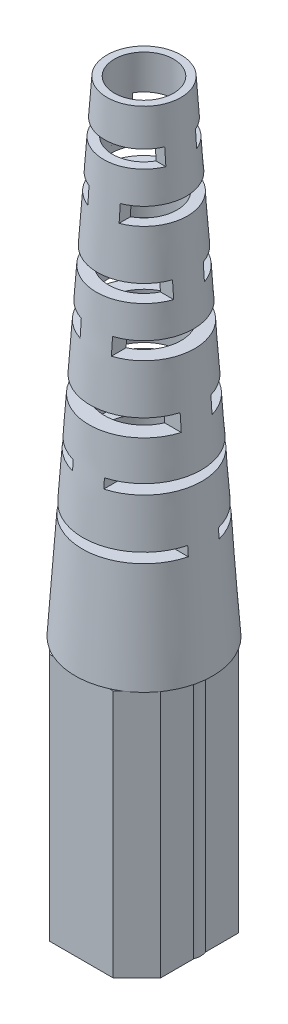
ISO-10303-21;
HEADER;
FILE_DESCRIPTION(('STEP AP214'),'2;1');
FILE_NAME('part.step','',(''),(''),'','','');
FILE_SCHEMA(('AUTOMOTIVE_DESIGN { 1 0 10303 214 1 1 1 1 }'));
ENDSEC;
DATA;
#1=APPLICATION_CONTEXT('core data for automotive mechanical design processes');
#2=APPLICATION_PROTOCOL_DEFINITION('international standard','automotive_design',2000,#1);
#3=PRODUCT_CONTEXT('',#1,'mechanical');
#4=PRODUCT('Part','Part','',(#3));
#5=PRODUCT_RELATED_PRODUCT_CATEGORY('part','',(#4));
#6=PRODUCT_DEFINITION_FORMATION('','',#4);
#7=PRODUCT_DEFINITION_CONTEXT('part definition',#1,'design');
#8=PRODUCT_DEFINITION('design','',#6,#7);
#9=PRODUCT_DEFINITION_SHAPE('','',#8);
#10=(LENGTH_UNIT() NAMED_UNIT(*) SI_UNIT(.MILLI.,.METRE.));
#11=(NAMED_UNIT(*) PLANE_ANGLE_UNIT() SI_UNIT($,.RADIAN.));
#12=(NAMED_UNIT(*) SI_UNIT($,.STERADIAN.) SOLID_ANGLE_UNIT());
#13=UNCERTAINTY_MEASURE_WITH_UNIT(LENGTH_MEASURE(1.E-05),#10,'distance_accuracy_value','');
#14=(GEOMETRIC_REPRESENTATION_CONTEXT(3) GLOBAL_UNCERTAINTY_ASSIGNED_CONTEXT((#13)) GLOBAL_UNIT_ASSIGNED_CONTEXT((#10,
#11,#12)) REPRESENTATION_CONTEXT('',''));
#15=CARTESIAN_POINT('',(0.,0.,0.));
#16=DIRECTION('',(0.,0.,1.));
#17=DIRECTION('',(1.,0.,0.));
#18=AXIS2_PLACEMENT_3D('',#15,#16,#17);
#19=CARTESIAN_POINT('',(0.,13.335,0.));
#20=DIRECTION('',(0.,-1.,0.));
#21=DIRECTION('',(1.,0.,0.));
#22=AXIS2_PLACEMENT_3D('',#19,#20,#21);
#23=CONICAL_SURFACE('',#22,3.683,0.0652729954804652);
#24=CARTESIAN_POINT('',(0.,28.956,0.));
#25=DIRECTION('',(0.,-1.,0.));
#26=DIRECTION('',(1.,0.,0.));
#27=AXIS2_PLACEMENT_3D('',#24,#25,#26);
#28=CIRCLE('',#27,2.66192);
#29=CARTESIAN_POINT('',(0.838199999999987,28.956,2.52650724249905));
#30=VERTEX_POINT('',#29);
#31=CARTESIAN_POINT('',(0.838199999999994,28.956,-2.526507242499));
#32=VERTEX_POINT('',#31);
#33=EDGE_CURVE('E1159',#30,#32,#28,.F.);
#34=ORIENTED_EDGE('',*,*,#33,.T.);
#35=CARTESIAN_POINT('',(0.838199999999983,33.5395690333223,-2.20860464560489));
#36=CARTESIAN_POINT('',(0.838199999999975,32.0647265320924,-2.31169150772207));
#37=CARTESIAN_POINT('',(0.838199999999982,30.5898257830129,-2.41393901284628));
#38=CARTESIAN_POINT('',(0.838199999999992,28.9091065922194,-2.52974074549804));
#39=CARTESIAN_POINT('',(0.838199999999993,28.703330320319,-2.54390655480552));
#40=CARTESIAN_POINT('',(0.838200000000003,26.8168208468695,-2.67366899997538));
#41=CARTESIAN_POINT('',(0.838200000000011,25.1360353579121,-2.7885063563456));
#42=CARTESIAN_POINT('',(0.838199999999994,23.4552193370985,-2.90289194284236));
#43=B_SPLINE_CURVE_WITH_KNOTS('',3,(#35,#36,#37,#38,#39,#40,#41,#42),.UNSPECIFIED.,.F.,.F.,(4,2,
2,4),(0.,4.4353216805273,5.05411154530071,10.1082227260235),.UNSPECIFIED.);
#44=CARTESIAN_POINT('',(0.838199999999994,28.067,-2.58766019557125));
#45=VERTEX_POINT('',#44);
#46=EDGE_CURVE('E515',#32,#45,#43,.T.);
#47=ORIENTED_EDGE('',*,*,#46,.T.);
#48=CARTESIAN_POINT('',(0.,28.067,0.));
#49=DIRECTION('',(0.,1.,0.));
#50=DIRECTION('',(-1.,0.,0.));
#51=AXIS2_PLACEMENT_3D('',#48,#49,#50);
#52=CIRCLE('',#51,2.72003024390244);
#53=CARTESIAN_POINT('',(0.838200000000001,28.067,2.5876601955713));
#54=VERTEX_POINT('',#53);
#55=EDGE_CURVE('E1221',#45,#54,#52,.F.);
#56=ORIENTED_EDGE('',*,*,#55,.T.);
#57=CARTESIAN_POINT('',(0.83819999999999,23.4552193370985,2.9028919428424));
#58=CARTESIAN_POINT('',(0.838200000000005,24.2956282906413,2.8457113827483));
#59=CARTESIAN_POINT('',(0.838200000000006,25.1360287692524,2.7884059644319));
#60=CARTESIAN_POINT('',(0.838200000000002,26.8168082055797,2.67348304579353));
#61=CARTESIAN_POINT('',(0.838199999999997,27.6571871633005,2.61586554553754));
#62=CARTESIAN_POINT('',(0.838199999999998,29.3379194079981,2.50025606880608));
#63=CARTESIAN_POINT('',(0.838200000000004,30.1782726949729,2.44226409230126));
#64=CARTESIAN_POINT('',(0.838200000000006,31.8589468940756,2.32581044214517));
#65=CARTESIAN_POINT('',(0.838200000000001,32.6992678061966,2.26734876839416));
#66=CARTESIAN_POINT('',(0.83819999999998,33.5395690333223,2.20860464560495));
#67=B_SPLINE_CURVE_WITH_KNOTS('',3,(#57,#58,#59,#60,#61,#62,#63,#64,#65,#66),.UNSPECIFIED.,.F.,
.F.,(4,2,2,2,4),(0.,2.52705590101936,5.05411126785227,7.58116683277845,10.1082229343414),.UNSPECIFIED.);
#68=EDGE_CURVE('E508',#54,#30,#67,.T.);
#69=ORIENTED_EDGE('',*,*,#68,.T.);
#70=EDGE_LOOP('',(#34,#47,#56,#69));
#71=FACE_BOUND('',#70,.T.);
#72=CARTESIAN_POINT('',(0.,36.576,0.));
#73=DIRECTION('',(0.,-1.,0.));
#74=DIRECTION('',(0.,0.,-1.));
#75=AXIS2_PLACEMENT_3D('',#72,#73,#74);
#76=CIRCLE('',#75,2.16383219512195);
#77=CARTESIAN_POINT('',(-2.00017987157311,36.576,0.825500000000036));
#78=VERTEX_POINT('',#77);
#79=CARTESIAN_POINT('',(2.00017987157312,36.576,0.825500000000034));
#80=VERTEX_POINT('',#79);
#81=EDGE_CURVE('E1040',#78,#80,#76,.F.);
#82=ORIENTED_EDGE('',*,*,#81,.F.);
#83=CARTESIAN_POINT('',(-2.25364137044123,32.961870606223,0.825500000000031));
#84=CARTESIAN_POINT('',(-2.20717101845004,33.6293747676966,0.825499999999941));
#85=CARTESIAN_POINT('',(-2.16053813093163,34.2968676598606,0.825499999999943));
#86=CARTESIAN_POINT('',(-2.06686042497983,35.6318241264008,0.82549999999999));
#87=CARTESIAN_POINT('',(-2.0198156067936,36.2992877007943,0.825500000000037));
#88=CARTESIAN_POINT('',(-1.92522711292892,37.6341797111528,0.825500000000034));
#89=CARTESIAN_POINT('',(-1.8776834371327,38.3016081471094,0.825499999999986));
#90=CARTESIAN_POINT('',(-1.78196017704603,39.6364197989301,0.82549999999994));
#91=CARTESIAN_POINT('',(-1.73378059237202,40.3038030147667,0.825499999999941));
#92=CARTESIAN_POINT('',(-1.68521455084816,40.9711582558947,0.825500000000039));
#93=B_SPLINE_CURVE_WITH_KNOTS('',3,(#83,#84,#85,#86,#87,#88,#89,#90,#91,#92),.UNSPECIFIED.,.F.,
.F.,(4,2,2,2,4),(0.,2.00735942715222,4.01471764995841,6.02207634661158,8.02943625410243),.UNSPECIFIED.);
#94=CARTESIAN_POINT('',(-1.93716666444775,37.465,0.825500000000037));
#95=VERTEX_POINT('',#94);
#96=EDGE_CURVE('E1031',#78,#95,#93,.T.);
#97=ORIENTED_EDGE('',*,*,#96,.T.);
#98=CARTESIAN_POINT('',(0.,37.465,0.));
#99=DIRECTION('',(0.,1.,0.));
#100=DIRECTION('',(0.,0.,1.));
#101=AXIS2_PLACEMENT_3D('',#98,#99,#100);
#102=CIRCLE('',#101,2.10572195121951);
#103=CARTESIAN_POINT('',(1.93716666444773,37.465,0.825500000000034));
#104=VERTEX_POINT('',#103);
#105=EDGE_CURVE('E1043',#104,#95,#102,.F.);
#106=ORIENTED_EDGE('',*,*,#105,.F.);
#107=CARTESIAN_POINT('',(1.68521455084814,40.9711582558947,0.825500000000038));
#108=CARTESIAN_POINT('',(1.77043049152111,39.7998305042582,0.825500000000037));
#109=CARTESIAN_POINT('',(1.85450297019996,38.6284205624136,0.825500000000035));
#110=CARTESIAN_POINT('',(1.94934883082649,37.2935463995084,0.825500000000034));
#111=CARTESIAN_POINT('',(1.96094282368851,37.1301405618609,0.825500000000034));
#112=CARTESIAN_POINT('',(2.06710796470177,35.6318413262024,0.825500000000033));
#113=CARTESIAN_POINT('',(2.16066343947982,34.2968758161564,0.825500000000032));
#114=CARTESIAN_POINT('',(2.25364137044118,32.961870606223,0.82550000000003));
#115=B_SPLINE_CURVE_WITH_KNOTS('',3,(#107,#108,#109,#110,#111,#112,#113,#114),.UNSPECIFIED.,.F.,
.F.,(4,2,2,4),(0.,3.52326843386,4.01471832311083,8.0294357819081),.UNSPECIFIED.);
#116=EDGE_CURVE('E1025',#104,#80,#115,.T.);
#117=ORIENTED_EDGE('',*,*,#116,.T.);
#118=EDGE_LOOP('',(#82,#97,#106,#117));
#119=FACE_BOUND('',#118,.T.);
#120=CARTESIAN_POINT('',(0.,24.638,0.));
#121=DIRECTION('',(0.,-1.,0.));
#122=DIRECTION('',(0.,0.,-1.));
#123=AXIS2_PLACEMENT_3D('',#120,#121,#122);
#124=CIRCLE('',#123,2.94416975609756);
#125=CARTESIAN_POINT('',(-2.82607241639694,24.638,0.825500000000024));
#126=VERTEX_POINT('',#125);
#127=CARTESIAN_POINT('',(2.82607241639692,24.638,0.825500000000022));
#128=VERTEX_POINT('',#127);
#129=EDGE_CURVE('E1109',#126,#128,#124,.F.);
#130=ORIENTED_EDGE('',*,*,#129,.F.);
#131=CARTESIAN_POINT('',(-3.16604023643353,19.6243767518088,0.825500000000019));
#132=CARTESIAN_POINT('',(-3.10456100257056,20.5344608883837,0.825499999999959));
#133=CARTESIAN_POINT('',(-3.04297215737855,21.4445376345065,0.825499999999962));
#134=CARTESIAN_POINT('',(-2.91952162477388,23.2646724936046,0.825499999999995));
#135=CARTESIAN_POINT('',(-2.8576599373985,24.1747306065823,0.825500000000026));
#136=CARTESIAN_POINT('',(-2.73361008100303,25.9948246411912,0.825500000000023));
#137=CARTESIAN_POINT('',(-2.67142191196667,26.9048605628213,0.825499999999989));
#138=CARTESIAN_POINT('',(-2.54663801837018,28.7249045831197,0.825499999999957));
#139=CARTESIAN_POINT('',(-2.48404229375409,29.6349126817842,0.825499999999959));
#140=CARTESIAN_POINT('',(-2.42120226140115,30.5449039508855,0.825500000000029));
#141=B_SPLINE_CURVE_WITH_KNOTS('',3,(#131,#132,#133,#134,#135,#136,#137,#138,#139,#140),
.UNSPECIFIED.,.F.,.F.,(4,2,2,2,4),(0.,2.7364750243,5.47294967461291,8.20942446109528,
10.945899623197),.UNSPECIFIED.);
#142=CARTESIAN_POINT('',(-2.76548174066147,25.527,0.825500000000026));
#143=VERTEX_POINT('',#142);
#144=EDGE_CURVE('E1100',#126,#143,#141,.T.);
#145=ORIENTED_EDGE('',*,*,#144,.T.);
#146=CARTESIAN_POINT('',(0.,25.527,0.));
#147=DIRECTION('',(0.,1.,0.));
#148=DIRECTION('',(0.,0.,1.));
#149=AXIS2_PLACEMENT_3D('',#146,#147,#148);
#150=CIRCLE('',#149,2.88605951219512);
#151=CARTESIAN_POINT('',(2.76548174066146,25.527,0.825500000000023));
#152=VERTEX_POINT('',#151);
#153=EDGE_CURVE('E1112',#152,#143,#150,.F.);
#154=ORIENTED_EDGE('',*,*,#153,.F.);
#155=CARTESIAN_POINT('',(2.42120226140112,30.5449039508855,0.825500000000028));
#156=CARTESIAN_POINT('',(2.53148002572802,28.9477574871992,0.825500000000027));
#157=CARTESIAN_POINT('',(2.64103086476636,27.350561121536,0.825500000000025));
#158=CARTESIAN_POINT('',(2.76524810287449,25.5304783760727,0.825500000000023));
#159=CARTESIAN_POINT('',(2.78044658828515,25.3076283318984,0.825500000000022));
#160=CARTESIAN_POINT('',(2.91968378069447,23.2646834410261,0.82550000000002));
#161=CARTESIAN_POINT('',(3.04306129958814,21.4445434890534,0.825500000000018));
#162=CARTESIAN_POINT('',(3.16604023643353,19.6243767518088,0.825500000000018));
#163=B_SPLINE_CURVE_WITH_KNOTS('',3,(#155,#156,#157,#158,#159,#160,#161,#162),.UNSPECIFIED.,.F.,
.F.,(4,2,2,4),(0.,4.80284671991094,5.47294986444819,10.9458994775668),.UNSPECIFIED.);
#164=EDGE_CURVE('E1094',#152,#128,#163,.T.);
#165=ORIENTED_EDGE('',*,*,#164,.T.);
#166=EDGE_LOOP('',(#130,#145,#154,#165));
#167=FACE_BOUND('',#166,.T.);
#168=CARTESIAN_POINT('',(0.,13.335,0.));
#169=DIRECTION('',(0.,-1.,0.));
#170=DIRECTION('',(1.,0.,0.));
#171=AXIS2_PLACEMENT_3D('',#168,#169,#170);
#172=CIRCLE('',#171,3.683);
#173=CARTESIAN_POINT('',(1.96498304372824,13.335,3.11501695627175));
#174=VERTEX_POINT('',#173);
#175=CARTESIAN_POINT('',(1.49596081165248,13.335,3.36550000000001));
#176=VERTEX_POINT('',#175);
#177=EDGE_CURVE('E1168',#174,#176,#172,.T.);
#178=ORIENTED_EDGE('',*,*,#177,.F.);
#179=CARTESIAN_POINT('',(1.96498304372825,13.335,-3.11501695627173));
#180=VERTEX_POINT('',#179);
#181=EDGE_CURVE('E1396',#180,#174,#172,.T.);
#182=ORIENTED_EDGE('',*,*,#181,.F.);
#183=CARTESIAN_POINT('',(1.4959608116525,13.335,-3.36549999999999));
#184=VERTEX_POINT('',#183);
#185=EDGE_CURVE('E1388',#184,#180,#172,.T.);
#186=ORIENTED_EDGE('',*,*,#185,.F.);
#187=CARTESIAN_POINT('',(-1.4959608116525,13.335,-3.36549999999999));
#188=VERTEX_POINT('',#187);
#189=EDGE_CURVE('E1398',#188,#184,#172,.T.);
#190=ORIENTED_EDGE('',*,*,#189,.F.);
#191=CARTESIAN_POINT('',(-1.96498304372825,13.335,-3.11501695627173));
#192=VERTEX_POINT('',#191);
#193=EDGE_CURVE('E1381',#192,#188,#172,.T.);
#194=ORIENTED_EDGE('',*,*,#193,.F.);
#195=CARTESIAN_POINT('',(-1.96498304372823,13.335,3.11501695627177));
#196=VERTEX_POINT('',#195);
#197=EDGE_CURVE('E1392',#196,#192,#172,.T.);
#198=ORIENTED_EDGE('',*,*,#197,.F.);
#199=CARTESIAN_POINT('',(-1.49596081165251,13.335,3.36550000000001));
#200=VERTEX_POINT('',#199);
#201=EDGE_CURVE('E1377',#200,#196,#172,.T.);
#202=ORIENTED_EDGE('',*,*,#201,.F.);
#203=EDGE_CURVE('E1383',#176,#200,#172,.T.);
#204=ORIENTED_EDGE('',*,*,#203,.F.);
#205=EDGE_LOOP('',(#178,#182,#186,#190,#194,#198,#202,#204));
#206=FACE_BOUND('',#205,.T.);
#207=CARTESIAN_POINT('',(0.,39.37,0.));
#208=DIRECTION('',(0.,-1.,0.));
#209=DIRECTION('',(1.,0.,0.));
#210=AXIS2_PLACEMENT_3D('',#207,#208,#209);
#211=CIRCLE('',#210,1.9812);
#212=CARTESIAN_POINT('',(1.98119999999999,39.37,0.));
#213=VERTEX_POINT('',#212);
#214=EDGE_CURVE('E1173',#213,#213,#211,.T.);
#215=ORIENTED_EDGE('',*,*,#214,.T.);
#216=EDGE_LOOP('',(#215));
#217=FACE_BOUND('',#216,.T.);
#218=CARTESIAN_POINT('',(0.,19.05,0.));
#219=DIRECTION('',(0.,-1.,0.));
#220=DIRECTION('',(0.,0.,-1.));
#221=AXIS2_PLACEMENT_3D('',#218,#219,#220);
#222=CIRCLE('',#221,3.30943414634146);
#223=CARTESIAN_POINT('',(-3.20482513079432,19.05,0.825500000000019));
#224=VERTEX_POINT('',#223);
#225=CARTESIAN_POINT('',(3.20482513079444,19.05,0.825500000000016));
#226=VERTEX_POINT('',#225);
#227=EDGE_CURVE('E1178',#224,#226,#222,.F.);
#228=ORIENTED_EDGE('',*,*,#227,.F.);
#229=CARTESIAN_POINT('',(-3.60049789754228,13.1679601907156,0.825500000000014));
#230=CARTESIAN_POINT('',(-3.53159004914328,14.1954622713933,0.825499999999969));
#231=CARTESIAN_POINT('',(-3.46258707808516,15.2229579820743,0.825499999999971));
#232=CARTESIAN_POINT('',(-3.3243453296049,17.2779334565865,0.825499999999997));
#233=CARTESIAN_POINT('',(-3.25510655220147,18.305413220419,0.825500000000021));
#234=CARTESIAN_POINT('',(-3.11634761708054,20.3603537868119,0.825500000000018));
#235=CARTESIAN_POINT('',(-3.04682745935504,21.3878145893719,0.82549999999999));
#236=CARTESIAN_POINT('',(-2.90743753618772,23.4427125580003,0.825499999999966));
#237=CARTESIAN_POINT('',(-2.83756777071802,24.470149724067,0.825499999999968));
#238=CARTESIAN_POINT('',(-2.76748909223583,25.4975726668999,0.825500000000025));
#239=B_SPLINE_CURVE_WITH_KNOTS('',3,(#229,#230,#231,#232,#233,#234,#235,#236,#237,#238),
.UNSPECIFIED.,.F.,.F.,(4,2,2,2,4),(0.,3.08943027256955,6.17886029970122,9.26829041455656,
12.3577207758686),.UNSPECIFIED.);
#240=CARTESIAN_POINT('',(-3.17052386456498,19.558,0.82550000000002));
#241=VERTEX_POINT('',#240);
#242=EDGE_CURVE('E1128',#224,#241,#239,.T.);
#243=ORIENTED_EDGE('',*,*,#242,.T.);
#244=CARTESIAN_POINT('',(0.,19.558,0.));
#245=DIRECTION('',(0.,1.,0.));
#246=DIRECTION('',(0.,0.,1.));
#247=AXIS2_PLACEMENT_3D('',#244,#245,#246);
#248=CIRCLE('',#247,3.27622829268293);
#249=CARTESIAN_POINT('',(3.17052386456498,19.558,0.825500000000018));
#250=VERTEX_POINT('',#249);
#251=EDGE_CURVE('E1415',#250,#241,#248,.F.);
#252=ORIENTED_EDGE('',*,*,#251,.F.);
#253=CARTESIAN_POINT('',(2.76748909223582,25.4975726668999,0.825500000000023));
#254=CARTESIAN_POINT('',(2.8904731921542,23.6943319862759,0.825500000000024));
#255=CARTESIAN_POINT('',(3.01283491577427,21.8910490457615,0.825500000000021));
#256=CARTESIAN_POINT('',(3.15173791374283,19.8361181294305,0.825500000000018));
#257=CARTESIAN_POINT('',(3.1687368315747,19.5845011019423,0.825500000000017));
#258=CARTESIAN_POINT('',(3.32448511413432,17.2779428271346,0.825500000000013));
#259=CARTESIAN_POINT('',(3.46266528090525,15.2229631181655,0.82550000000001));
#260=CARTESIAN_POINT('',(3.60049789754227,13.1679601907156,0.825500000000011));
#261=B_SPLINE_CURVE_WITH_KNOTS('',3,(#253,#254,#255,#256,#257,#258,#259,#260),.UNSPECIFIED.,.F.,
.F.,(4,2,2,4),(0.,5.42228866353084,6.17886042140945,12.3577206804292),.UNSPECIFIED.);
#262=EDGE_CURVE('E1122',#250,#226,#261,.T.);
#263=ORIENTED_EDGE('',*,*,#262,.T.);
#264=EDGE_LOOP('',(#228,#243,#252,#263));
#265=FACE_BOUND('',#264,.T.);
#266=CARTESIAN_POINT('',(0.,30.607,0.));
#267=DIRECTION('',(0.,-1.,0.));
#268=DIRECTION('',(0.,0.,-1.));
#269=AXIS2_PLACEMENT_3D('',#266,#267,#268);
#270=CIRCLE('',#269,2.55400097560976);
#271=CARTESIAN_POINT('',(-2.41691347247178,30.607,0.825500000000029));
#272=VERTEX_POINT('',#271);
#273=CARTESIAN_POINT('',(2.41691347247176,30.607,0.825500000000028));
#274=VERTEX_POINT('',#273);
#275=EDGE_CURVE('E1183',#272,#274,#270,.F.);
#276=ORIENTED_EDGE('',*,*,#275,.F.);
#277=CARTESIAN_POINT('',(-2.7131648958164,26.293326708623,0.825500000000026));
#278=CARTESIAN_POINT('',(-2.65926843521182,27.0821221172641,0.82549999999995));
#279=CARTESIAN_POINT('',(-2.60524141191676,27.870908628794,0.825499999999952));
#280=CARTESIAN_POINT('',(-2.49686021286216,29.448458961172,0.825499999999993));
#281=CARTESIAN_POINT('',(-2.44250603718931,30.2372227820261,0.825500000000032));
#282=CARTESIAN_POINT('',(-2.33340447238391,31.8147233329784,0.82550000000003));
#283=CARTESIAN_POINT('',(-2.27865708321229,32.6034600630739,0.825499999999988));
#284=CARTESIAN_POINT('',(-2.16866768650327,34.1808992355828,0.825499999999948));
#285=CARTESIAN_POINT('',(-2.11342567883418,34.969601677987,0.82549999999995));
#286=CARTESIAN_POINT('',(-2.05788567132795,35.7582832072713,0.825500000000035));
#287=B_SPLINE_CURVE_WITH_KNOTS('',3,(#277,#278,#279,#280,#281,#282,#283,#284,#285,#286),
.UNSPECIFIED.,.F.,.F.,(4,2,2,2,4),(0.,2.37190373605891,4.74380684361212,7.1157101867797,
9.48761416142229),.UNSPECIFIED.);
#288=CARTESIAN_POINT('',(-2.35542359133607,31.496,0.82550000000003));
#289=VERTEX_POINT('',#288);
#290=EDGE_CURVE('E1059',#272,#289,#287,.T.);
#291=ORIENTED_EDGE('',*,*,#290,.T.);
#292=CARTESIAN_POINT('',(0.,31.496,0.));
#293=DIRECTION('',(0.,1.,0.));
#294=DIRECTION('',(0.,0.,1.));
#295=AXIS2_PLACEMENT_3D('',#292,#293,#294);
#296=CIRCLE('',#295,2.49589073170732);
#297=CARTESIAN_POINT('',(2.35542359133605,31.496,0.825500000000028));
#298=VERTEX_POINT('',#297);
#299=EDGE_CURVE('E1431',#298,#289,#296,.F.);
#300=ORIENTED_EDGE('',*,*,#299,.F.);
#301=CARTESIAN_POINT('',(2.05788567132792,35.7582832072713,0.825500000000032));
#302=CARTESIAN_POINT('',(2.15534797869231,34.3740342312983,0.825500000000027));
#303=CARTESIAN_POINT('',(2.25192539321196,32.9897234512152,0.825500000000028));
#304=CARTESIAN_POINT('',(2.3612290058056,31.4122366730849,0.825500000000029));
#305=CARTESIAN_POINT('',(2.37459820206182,31.2191052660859,0.825500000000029));
#306=CARTESIAN_POINT('',(2.49705544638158,29.4484722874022,0.82550000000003));
#307=CARTESIAN_POINT('',(2.6053456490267,27.8709154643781,0.825500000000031));
#308=CARTESIAN_POINT('',(2.71316489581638,26.293326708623,0.825500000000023));
#309=B_SPLINE_CURVE_WITH_KNOTS('',3,(#301,#302,#303,#304,#305,#306,#307,#308),.UNSPECIFIED.,.F.,
.F.,(4,2,2,4),(0.,4.16302642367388,4.74380717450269,9.48761391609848),.UNSPECIFIED.);
#310=EDGE_CURVE('E1053',#298,#274,#309,.T.);
#311=ORIENTED_EDGE('',*,*,#310,.T.);
#312=EDGE_LOOP('',(#276,#291,#300,#311));
#313=FACE_BOUND('',#312,.T.);
#314=CARTESIAN_POINT('',(-0.838200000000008,28.1597041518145,-2.58128978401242));
#315=CARTESIAN_POINT('',(-0.838200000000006,26.4651749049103,-2.6977265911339));
#316=CARTESIAN_POINT('',(-0.838200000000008,24.7705980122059,-2.8134663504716));
#317=CARTESIAN_POINT('',(-0.838200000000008,22.8395445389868,-2.94476070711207));
#318=CARTESIAN_POINT('',(-0.838200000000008,22.6031027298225,-2.96082643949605));
#319=CARTESIAN_POINT('',(-0.838200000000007,20.4355958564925,-3.10801499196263));
#320=CARTESIAN_POINT('',(-0.838200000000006,18.5044876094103,-3.23850243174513));
#321=CARTESIAN_POINT('',(-0.838199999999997,16.573353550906,-3.36860489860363));
#322=B_SPLINE_CURVE_WITH_KNOTS('',3,(#314,#315,#316,#317,#318,#319,#320,#321),.UNSPECIFIED.,.F.,
.F.,(4,2,2,4),(0.,5.09557426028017,5.80653525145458,11.6130702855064),.UNSPECIFIED.);
#323=CARTESIAN_POINT('',(-0.838200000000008,22.606,-2.96062623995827));
#324=VERTEX_POINT('',#323);
#325=CARTESIAN_POINT('',(-0.838200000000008,22.098,-2.99512249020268));
#326=VERTEX_POINT('',#325);
#327=EDGE_CURVE('E998',#324,#326,#322,.T.);
#328=ORIENTED_EDGE('',*,*,#327,.F.);
#329=CARTESIAN_POINT('',(0.,22.606,0.));
#330=DIRECTION('',(0.,-1.,0.));
#331=DIRECTION('',(0.,0.,-1.));
#332=AXIS2_PLACEMENT_3D('',#329,#330,#331);
#333=CIRCLE('',#332,3.07699317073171);
#334=CARTESIAN_POINT('',(-0.838200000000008,22.606,2.96062623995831));
#335=VERTEX_POINT('',#334);
#336=EDGE_CURVE('E1450',#324,#335,#333,.F.);
#337=ORIENTED_EDGE('',*,*,#336,.T.);
#338=CARTESIAN_POINT('',(-0.838200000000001,16.573353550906,3.36860489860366));
#339=CARTESIAN_POINT('',(-0.838199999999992,17.5389212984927,3.30356334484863));
#340=CARTESIAN_POINT('',(-0.838199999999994,18.504481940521,3.23841612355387));
#341=CARTESIAN_POINT('',(-0.838200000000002,20.435585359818,3.10785908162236));
#342=CARTESIAN_POINT('',(-0.838200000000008,21.4011281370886,3.04244926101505));
#343=CARTESIAN_POINT('',(-0.838200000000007,23.3321924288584,2.91131573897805));
#344=CARTESIAN_POINT('',(-0.838200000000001,24.2977139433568,2.84559203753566));
#345=CARTESIAN_POINT('',(-0.838199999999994,26.2287303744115,2.71375353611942));
#346=CARTESIAN_POINT('',(-0.838199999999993,27.1942252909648,2.64763873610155));
#347=CARTESIAN_POINT('',(-0.838200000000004,28.1597041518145,2.58128978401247));
#348=B_SPLINE_CURVE_WITH_KNOTS('',3,(#338,#339,#340,#341,#342,#343,#344,#345,#346,#347),
.UNSPECIFIED.,.F.,.F.,(4,2,2,2,4),(0.,2.90326770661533,5.80653508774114,8.70980258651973,
11.6130704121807),.UNSPECIFIED.);
#349=CARTESIAN_POINT('',(-0.838200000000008,22.098,2.99512249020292));
#350=VERTEX_POINT('',#349);
#351=EDGE_CURVE('E993',#350,#335,#348,.T.);
#352=ORIENTED_EDGE('',*,*,#351,.F.);
#353=CARTESIAN_POINT('',(0.,22.098,0.));
#354=DIRECTION('',(0.,1.,0.));
#355=DIRECTION('',(0.,0.,1.));
#356=AXIS2_PLACEMENT_3D('',#353,#354,#355);
#357=CIRCLE('',#356,3.11019902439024);
#358=EDGE_CURVE('E1448',#350,#326,#357,.F.);
#359=ORIENTED_EDGE('',*,*,#358,.T.);
#360=EDGE_LOOP('',(#328,#337,#352,#359));
#361=FACE_BOUND('',#360,.T.);
#362=CARTESIAN_POINT('',(-0.838200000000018,33.5395690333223,-2.20860464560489));
#363=CARTESIAN_POINT('',(-0.83820000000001,32.0647265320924,-2.31169150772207));
#364=CARTESIAN_POINT('',(-0.838200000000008,30.5898257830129,-2.41393901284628));
#365=CARTESIAN_POINT('',(-0.838200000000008,28.9091065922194,-2.52974074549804));
#366=CARTESIAN_POINT('',(-0.838200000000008,28.703330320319,-2.54390655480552));
#367=CARTESIAN_POINT('',(-0.838200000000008,26.8168208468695,-2.67366899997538));
#368=CARTESIAN_POINT('',(-0.83820000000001,25.1360353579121,-2.78850635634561));
#369=CARTESIAN_POINT('',(-0.838200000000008,23.4552193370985,-2.90289194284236));
#370=B_SPLINE_CURVE_WITH_KNOTS('',3,(#362,#363,#364,#365,#366,#367,#368,#369),.UNSPECIFIED.,.F.,
.F.,(4,2,2,4),(0.,4.4353216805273,5.05411154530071,10.1082227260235),.UNSPECIFIED.);
#371=CARTESIAN_POINT('',(-0.838200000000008,28.956,-2.526507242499));
#372=VERTEX_POINT('',#371);
#373=CARTESIAN_POINT('',(-0.838200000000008,28.067,-2.58766019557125));
#374=VERTEX_POINT('',#373);
#375=EDGE_CURVE('E971',#372,#374,#370,.T.);
#376=ORIENTED_EDGE('',*,*,#375,.F.);
#377=CARTESIAN_POINT('',(0.,28.956,0.));
#378=DIRECTION('',(0.,-1.,0.));
#379=DIRECTION('',(0.,0.,-1.));
#380=AXIS2_PLACEMENT_3D('',#377,#378,#379);
#381=CIRCLE('',#380,2.66192);
#382=CARTESIAN_POINT('',(-0.838200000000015,28.956,2.52650724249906));
#383=VERTEX_POINT('',#382);
#384=EDGE_CURVE('E979',#372,#383,#381,.F.);
#385=ORIENTED_EDGE('',*,*,#384,.T.);
#386=CARTESIAN_POINT('',(-0.838200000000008,23.4552193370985,2.90289194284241));
#387=CARTESIAN_POINT('',(-0.838199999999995,24.2956282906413,2.84571138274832));
#388=CARTESIAN_POINT('',(-0.838199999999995,25.1360287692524,2.78840596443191));
#389=CARTESIAN_POINT('',(-0.838199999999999,26.8168082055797,2.67348304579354));
#390=CARTESIAN_POINT('',(-0.838200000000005,27.6571871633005,2.61586554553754));
#391=CARTESIAN_POINT('',(-0.838200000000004,29.3379194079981,2.50025606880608));
#392=CARTESIAN_POINT('',(-0.838199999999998,30.1782726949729,2.44226409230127));
#393=CARTESIAN_POINT('',(-0.838199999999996,31.8589468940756,2.32581044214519));
#394=CARTESIAN_POINT('',(-0.838200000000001,32.6992678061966,2.26734876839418));
#395=CARTESIAN_POINT('',(-0.838200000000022,33.5395690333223,2.20860464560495));
#396=B_SPLINE_CURVE_WITH_KNOTS('',3,(#386,#387,#388,#389,#390,#391,#392,#393,#394,#395),
.UNSPECIFIED.,.F.,.F.,(4,2,2,2,4),(0.,2.52705590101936,5.05411126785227,7.58116683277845,
10.1082229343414),.UNSPECIFIED.);
#397=CARTESIAN_POINT('',(-0.838200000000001,28.067,2.5876601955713));
#398=VERTEX_POINT('',#397);
#399=EDGE_CURVE('E966',#398,#383,#396,.T.);
#400=ORIENTED_EDGE('',*,*,#399,.F.);
#401=CARTESIAN_POINT('',(0.,28.067,0.));
#402=DIRECTION('',(0.,1.,0.));
#403=DIRECTION('',(0.,0.,1.));
#404=AXIS2_PLACEMENT_3D('',#401,#402,#403);
#405=CIRCLE('',#404,2.72003024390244);
#406=EDGE_CURVE('E982',#398,#374,#405,.F.);
#407=ORIENTED_EDGE('',*,*,#406,.T.);
#408=EDGE_LOOP('',(#376,#385,#400,#407));
#409=FACE_BOUND('',#408,.T.);
#410=CARTESIAN_POINT('',(-0.838200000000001,38.752593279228,-1.83959635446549));
#411=CARTESIAN_POINT('',(-0.838200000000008,37.4906598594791,-1.93020618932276));
#412=CARTESIAN_POINT('',(-0.838200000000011,36.2286514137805,-2.01976018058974));
#413=CARTESIAN_POINT('',(-0.838200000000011,34.7905354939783,-2.12092160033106));
#414=CARTESIAN_POINT('',(-0.838200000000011,34.6144816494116,-2.13329057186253));
#415=CARTESIAN_POINT('',(-0.838200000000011,33.0002941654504,-2.24656587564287));
#416=CARTESIAN_POINT('',(-0.838200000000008,31.5620942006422,-2.34652868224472));
#417=CARTESIAN_POINT('',(-0.838200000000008,30.1238569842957,-2.44594668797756));
#418=B_SPLINE_CURVE_WITH_KNOTS('',3,(#410,#411,#412,#413,#414,#415,#416,#417),.UNSPECIFIED.,.F.,
.F.,(4,2,2,4),(0.,3.79554518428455,4.32500861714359,8.65001655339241),.UNSPECIFIED.);
#419=CARTESIAN_POINT('',(-0.838200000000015,34.925,-2.11146261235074));
#420=VERTEX_POINT('',#419);
#421=CARTESIAN_POINT('',(-0.838200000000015,34.036,-2.17386181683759));
#422=VERTEX_POINT('',#421);
#423=EDGE_CURVE('E931',#420,#422,#418,.T.);
#424=ORIENTED_EDGE('',*,*,#423,.F.);
#425=CARTESIAN_POINT('',(0.,34.925,0.));
#426=DIRECTION('',(0.,-1.,0.));
#427=DIRECTION('',(0.,0.,-1.));
#428=AXIS2_PLACEMENT_3D('',#425,#426,#427);
#429=CIRCLE('',#428,2.2717512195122);
#430=CARTESIAN_POINT('',(-0.838200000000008,34.925,2.11146261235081));
#431=VERTEX_POINT('',#430);
#432=EDGE_CURVE('E2017',#420,#431,#429,.F.);
#433=ORIENTED_EDGE('',*,*,#432,.T.);
#434=CARTESIAN_POINT('',(-0.838200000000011,30.1238569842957,2.44594668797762));
#435=CARTESIAN_POINT('',(-0.838199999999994,30.8429769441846,2.39625426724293));
#436=CARTESIAN_POINT('',(-0.838199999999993,31.5620864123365,2.3464094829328));
#437=CARTESIAN_POINT('',(-0.8382,33.0002782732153,2.24633553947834));
#438=CARTESIAN_POINT('',(-0.838200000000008,33.7193606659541,2.19610638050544));
#439=CARTESIAN_POINT('',(-0.838200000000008,35.1574930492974,2.09518398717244));
#440=CARTESIAN_POINT('',(-0.8382,35.8765430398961,2.04449075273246));
#441=CARTESIAN_POINT('',(-0.838199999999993,37.3146016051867,1.94251590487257));
#442=CARTESIAN_POINT('',(-0.838199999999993,38.0336101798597,1.89123429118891));
#443=CARTESIAN_POINT('',(-0.838200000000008,38.752593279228,1.83959635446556));
#444=B_SPLINE_CURVE_WITH_KNOTS('',3,(#434,#435,#436,#437,#438,#439,#440,#441,#442,#443),
.UNSPECIFIED.,.F.,.F.,(4,2,2,2,4),(0.,2.16250452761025,4.32500809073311,6.48751202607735,
8.65001693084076),.UNSPECIFIED.);
#445=CARTESIAN_POINT('',(-0.838200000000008,34.036,2.17386181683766));
#446=VERTEX_POINT('',#445);
#447=EDGE_CURVE('E926',#446,#431,#444,.T.);
#448=ORIENTED_EDGE('',*,*,#447,.F.);
#449=CARTESIAN_POINT('',(0.,34.036,0.));
#450=DIRECTION('',(0.,1.,0.));
#451=DIRECTION('',(0.,0.,1.));
#452=AXIS2_PLACEMENT_3D('',#449,#450,#451);
#453=CIRCLE('',#452,2.32986146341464);
#454=EDGE_CURVE('E2019',#446,#422,#453,.F.);
#455=ORIENTED_EDGE('',*,*,#454,.T.);
#456=EDGE_LOOP('',(#424,#433,#448,#455));
#457=FACE_BOUND('',#456,.T.);
#458=CARTESIAN_POINT('',(0.,19.05,0.));
#459=DIRECTION('',(0.,-1.,0.));
#460=DIRECTION('',(1.,0.,0.));
#461=AXIS2_PLACEMENT_3D('',#458,#459,#460);
#462=CIRCLE('',#461,3.30943414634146);
#463=CARTESIAN_POINT('',(3.20482513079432,19.05,-0.825499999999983));
#464=VERTEX_POINT('',#463);
#465=CARTESIAN_POINT('',(-3.20482513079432,19.05,-0.825499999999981));
#466=VERTEX_POINT('',#465);
#467=EDGE_CURVE('E911',#464,#466,#462,.F.);
#468=ORIENTED_EDGE('',*,*,#467,.F.);
#469=CARTESIAN_POINT('',(2.76748909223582,25.4975726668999,-0.825499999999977));
#470=CARTESIAN_POINT('',(2.8904731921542,23.6943319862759,-0.825499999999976));
#471=CARTESIAN_POINT('',(3.01283491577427,21.8910490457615,-0.825499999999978));
#472=CARTESIAN_POINT('',(3.15173791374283,19.8361181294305,-0.825499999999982));
#473=CARTESIAN_POINT('',(3.1687368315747,19.5845011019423,-0.825499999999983));
#474=CARTESIAN_POINT('',(3.32448511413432,17.2779428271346,-0.825499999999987));
#475=CARTESIAN_POINT('',(3.46266528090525,15.2229631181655,-0.825499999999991));
#476=CARTESIAN_POINT('',(3.60049789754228,13.1679601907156,-0.825499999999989));
#477=B_SPLINE_CURVE_WITH_KNOTS('',3,(#469,#470,#471,#472,#473,#474,#475,#476),.UNSPECIFIED.,.F.,
.F.,(4,2,2,4),(0.,5.42228866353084,6.17886042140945,12.3577206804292),.UNSPECIFIED.);
#478=CARTESIAN_POINT('',(3.17052386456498,19.558,-0.825499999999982));
#479=VERTEX_POINT('',#478);
#480=EDGE_CURVE('E905',#479,#464,#477,.T.);
#481=ORIENTED_EDGE('',*,*,#480,.F.);
#482=CARTESIAN_POINT('',(0.,19.558,0.));
#483=DIRECTION('',(0.,1.,0.));
#484=DIRECTION('',(-1.,0.,0.));
#485=AXIS2_PLACEMENT_3D('',#482,#483,#484);
#486=CIRCLE('',#485,3.27622829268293);
#487=CARTESIAN_POINT('',(-3.17052386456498,19.558,-0.82549999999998));
#488=VERTEX_POINT('',#487);
#489=EDGE_CURVE('E2011',#488,#479,#486,.F.);
#490=ORIENTED_EDGE('',*,*,#489,.F.);
#491=CARTESIAN_POINT('',(-3.60049789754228,13.1679601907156,-0.825499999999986));
#492=CARTESIAN_POINT('',(-3.53159004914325,14.1954622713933,-0.825500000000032));
#493=CARTESIAN_POINT('',(-3.46258707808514,15.2229579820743,-0.82550000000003));
#494=CARTESIAN_POINT('',(-3.32434532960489,17.2779334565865,-0.825500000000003));
#495=CARTESIAN_POINT('',(-3.25510655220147,18.305413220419,-0.825499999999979));
#496=CARTESIAN_POINT('',(-3.11634761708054,20.3603537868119,-0.825499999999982));
#497=CARTESIAN_POINT('',(-3.04682745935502,21.3878145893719,-0.825500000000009));
#498=CARTESIAN_POINT('',(-2.90743753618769,23.4427125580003,-0.825500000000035));
#499=CARTESIAN_POINT('',(-2.83756777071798,24.470149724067,-0.825500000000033));
#500=CARTESIAN_POINT('',(-2.76748909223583,25.4975726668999,-0.825499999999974));
#501=B_SPLINE_CURVE_WITH_KNOTS('',3,(#491,#492,#493,#494,#495,#496,#497,#498,#499,#500),
.UNSPECIFIED.,.F.,.F.,(4,2,2,2,4),(0.,3.08943027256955,6.17886029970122,9.26829041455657,
12.3577207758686),.UNSPECIFIED.);
#502=EDGE_CURVE('E910',#466,#488,#501,.T.);
#503=ORIENTED_EDGE('',*,*,#502,.F.);
#504=EDGE_LOOP('',(#468,#481,#490,#503));
#505=FACE_BOUND('',#504,.T.);
#506=CARTESIAN_POINT('',(0.,24.638,0.));
#507=DIRECTION('',(0.,-1.,0.));
#508=DIRECTION('',(1.,0.,0.));
#509=AXIS2_PLACEMENT_3D('',#506,#507,#508);
#510=CIRCLE('',#509,2.94416975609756);
#511=CARTESIAN_POINT('',(2.82607241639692,24.638,-0.825499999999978));
#512=VERTEX_POINT('',#511);
#513=CARTESIAN_POINT('',(-2.82607241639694,24.638,-0.825499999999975));
#514=VERTEX_POINT('',#513);
#515=EDGE_CURVE('E862',#512,#514,#510,.F.);
#516=ORIENTED_EDGE('',*,*,#515,.F.);
#517=CARTESIAN_POINT('',(2.42120226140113,30.5449039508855,-0.825499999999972));
#518=CARTESIAN_POINT('',(2.53148002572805,28.9477574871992,-0.825499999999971));
#519=CARTESIAN_POINT('',(2.64103086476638,27.350561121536,-0.825499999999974));
#520=CARTESIAN_POINT('',(2.76524810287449,25.5304783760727,-0.825499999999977));
#521=CARTESIAN_POINT('',(2.78044658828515,25.3076283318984,-0.825499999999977));
#522=CARTESIAN_POINT('',(2.91968378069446,23.2646834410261,-0.825499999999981));
#523=CARTESIAN_POINT('',(3.04306129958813,21.4445434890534,-0.825499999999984));
#524=CARTESIAN_POINT('',(3.16604023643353,19.6243767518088,-0.825499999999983));
#525=B_SPLINE_CURVE_WITH_KNOTS('',3,(#517,#518,#519,#520,#521,#522,#523,#524),.UNSPECIFIED.,.F.,
.F.,(4,2,2,4),(0.,4.80284671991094,5.47294986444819,10.9458994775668),.UNSPECIFIED.);
#526=CARTESIAN_POINT('',(2.76548174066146,25.527,-0.825499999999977));
#527=VERTEX_POINT('',#526);
#528=EDGE_CURVE('E864',#527,#512,#525,.T.);
#529=ORIENTED_EDGE('',*,*,#528,.F.);
#530=CARTESIAN_POINT('',(0.,25.527,0.));
#531=DIRECTION('',(0.,1.,0.));
#532=DIRECTION('',(-1.,0.,0.));
#533=AXIS2_PLACEMENT_3D('',#530,#531,#532);
#534=CIRCLE('',#533,2.88605951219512);
#535=CARTESIAN_POINT('',(-2.76548174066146,25.527,-0.825499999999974));
#536=VERTEX_POINT('',#535);
#537=EDGE_CURVE('E860',#536,#527,#534,.F.);
#538=ORIENTED_EDGE('',*,*,#537,.F.);
#539=CARTESIAN_POINT('',(-3.16604023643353,19.6243767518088,-0.82549999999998));
#540=CARTESIAN_POINT('',(-3.10456100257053,20.5344608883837,-0.825500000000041));
#541=CARTESIAN_POINT('',(-3.04297215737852,21.4445376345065,-0.825500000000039));
#542=CARTESIAN_POINT('',(-2.91952162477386,23.2646724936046,-0.825500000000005));
#543=CARTESIAN_POINT('',(-2.8576599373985,24.1747306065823,-0.825499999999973));
#544=CARTESIAN_POINT('',(-2.73361008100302,25.9948246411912,-0.825499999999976));
#545=CARTESIAN_POINT('',(-2.67142191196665,26.9048605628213,-0.825500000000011));
#546=CARTESIAN_POINT('',(-2.54663801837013,28.7249045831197,-0.825500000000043));
#547=CARTESIAN_POINT('',(-2.48404229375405,29.6349126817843,-0.825500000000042));
#548=CARTESIAN_POINT('',(-2.42120226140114,30.5449039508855,-0.82549999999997));
#549=B_SPLINE_CURVE_WITH_KNOTS('',3,(#539,#540,#541,#542,#543,#544,#545,#546,#547,#548),
.UNSPECIFIED.,.F.,.F.,(4,2,2,2,4),(0.,2.7364750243,5.47294967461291,8.20942446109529,
10.945899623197),.UNSPECIFIED.);
#550=EDGE_CURVE('E869',#514,#536,#549,.T.);
#551=ORIENTED_EDGE('',*,*,#550,.F.);
#552=EDGE_LOOP('',(#516,#529,#538,#551));
#553=FACE_BOUND('',#552,.T.);
#554=CARTESIAN_POINT('',(0.,30.607,0.));
#555=DIRECTION('',(0.,-1.,0.));
#556=DIRECTION('',(1.,0.,0.));
#557=AXIS2_PLACEMENT_3D('',#554,#555,#556);
#558=CIRCLE('',#557,2.55400097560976);
#559=CARTESIAN_POINT('',(2.41691347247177,30.607,-0.825499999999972));
#560=VERTEX_POINT('',#559);
#561=CARTESIAN_POINT('',(-2.41691347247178,30.607,-0.82549999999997));
#562=VERTEX_POINT('',#561);
#563=EDGE_CURVE('E845',#560,#562,#558,.F.);
#564=ORIENTED_EDGE('',*,*,#563,.F.);
#565=CARTESIAN_POINT('',(2.05788567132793,35.7582832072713,-0.825499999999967));
#566=CARTESIAN_POINT('',(2.15534797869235,34.3740342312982,-0.825499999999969));
#567=CARTESIAN_POINT('',(2.25192539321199,32.9897234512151,-0.82549999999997));
#568=CARTESIAN_POINT('',(2.36122900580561,31.4122366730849,-0.825499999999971));
#569=CARTESIAN_POINT('',(2.37459820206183,31.2191052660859,-0.825499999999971));
#570=CARTESIAN_POINT('',(2.49705544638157,29.4484722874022,-0.825499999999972));
#571=CARTESIAN_POINT('',(2.60534564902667,27.870915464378,-0.825499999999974));
#572=CARTESIAN_POINT('',(2.71316489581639,26.293326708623,-0.825499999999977));
#573=B_SPLINE_CURVE_WITH_KNOTS('',3,(#565,#566,#567,#568,#569,#570,#571,#572),.UNSPECIFIED.,.F.,
.F.,(4,2,2,4),(0.,4.16302642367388,4.74380717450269,9.48761391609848),.UNSPECIFIED.);
#574=CARTESIAN_POINT('',(2.35542359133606,31.496,-0.825499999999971));
#575=VERTEX_POINT('',#574);
#576=EDGE_CURVE('E839',#575,#560,#573,.T.);
#577=ORIENTED_EDGE('',*,*,#576,.F.);
#578=CARTESIAN_POINT('',(0.,31.496,0.));
#579=DIRECTION('',(0.,1.,0.));
#580=DIRECTION('',(-1.,0.,0.));
#581=AXIS2_PLACEMENT_3D('',#578,#579,#580);
#582=CIRCLE('',#581,2.49589073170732);
#583=CARTESIAN_POINT('',(-2.35542359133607,31.496,-0.825499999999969));
#584=VERTEX_POINT('',#583);
#585=EDGE_CURVE('E1992',#584,#575,#582,.F.);
#586=ORIENTED_EDGE('',*,*,#585,.F.);
#587=CARTESIAN_POINT('',(-2.71316489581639,26.293326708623,-0.825499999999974));
#588=CARTESIAN_POINT('',(-2.65926843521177,27.0821221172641,-0.82550000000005));
#589=CARTESIAN_POINT('',(-2.60524141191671,27.870908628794,-0.825500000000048));
#590=CARTESIAN_POINT('',(-2.49686021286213,29.448458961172,-0.825500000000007));
#591=CARTESIAN_POINT('',(-2.44250603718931,30.2372227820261,-0.825499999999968));
#592=CARTESIAN_POINT('',(-2.3334044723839,31.8147233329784,-0.82549999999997));
#593=CARTESIAN_POINT('',(-2.27865708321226,32.6034600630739,-0.825500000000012));
#594=CARTESIAN_POINT('',(-2.16866768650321,34.1808992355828,-0.825500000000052));
#595=CARTESIAN_POINT('',(-2.11342567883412,34.969601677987,-0.82550000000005));
#596=CARTESIAN_POINT('',(-2.05788567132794,35.7582832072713,-0.825499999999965));
#597=B_SPLINE_CURVE_WITH_KNOTS('',3,(#587,#588,#589,#590,#591,#592,#593,#594,#595,#596),
.UNSPECIFIED.,.F.,.F.,(4,2,2,2,4),(0.,2.37190373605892,4.74380684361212,7.1157101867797,
9.48761416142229),.UNSPECIFIED.);
#598=EDGE_CURVE('E844',#562,#584,#597,.T.);
#599=ORIENTED_EDGE('',*,*,#598,.F.);
#600=EDGE_LOOP('',(#564,#577,#586,#599));
#601=FACE_BOUND('',#600,.T.);
#602=CARTESIAN_POINT('',(0.,36.576,0.));
#603=DIRECTION('',(0.,-1.,0.));
#604=DIRECTION('',(1.,0.,0.));
#605=AXIS2_PLACEMENT_3D('',#602,#603,#604);
#606=CIRCLE('',#605,2.16383219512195);
#607=CARTESIAN_POINT('',(2.00017987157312,36.576,-0.825499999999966));
#608=VERTEX_POINT('',#607);
#609=CARTESIAN_POINT('',(-2.00017987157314,36.576,-0.825499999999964));
#610=VERTEX_POINT('',#609);
#611=EDGE_CURVE('E795',#608,#610,#606,.F.);
#612=ORIENTED_EDGE('',*,*,#611,.F.);
#613=CARTESIAN_POINT('',(1.68521455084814,40.9711582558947,-0.825499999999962));
#614=CARTESIAN_POINT('',(1.77043049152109,39.7998305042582,-0.82549999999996));
#615=CARTESIAN_POINT('',(1.85450297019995,38.6284205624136,-0.825499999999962));
#616=CARTESIAN_POINT('',(1.94934883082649,37.2935463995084,-0.825499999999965));
#617=CARTESIAN_POINT('',(1.96094282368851,37.1301405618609,-0.825499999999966));
#618=CARTESIAN_POINT('',(2.06710796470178,35.6318413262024,-0.825499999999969));
#619=CARTESIAN_POINT('',(2.16066343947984,34.2968758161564,-0.825499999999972));
#620=CARTESIAN_POINT('',(2.2536413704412,32.961870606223,-0.82549999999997));
#621=B_SPLINE_CURVE_WITH_KNOTS('',3,(#613,#614,#615,#616,#617,#618,#619,#620),.UNSPECIFIED.,.F.,
.F.,(4,2,2,4),(0.,3.52326843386,4.01471832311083,8.0294357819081),.UNSPECIFIED.);
#622=CARTESIAN_POINT('',(1.93716666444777,37.465,-0.825499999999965));
#623=VERTEX_POINT('',#622);
#624=EDGE_CURVE('E797',#623,#608,#621,.T.);
#625=ORIENTED_EDGE('',*,*,#624,.F.);
#626=CARTESIAN_POINT('',(0.,37.465,0.));
#627=DIRECTION('',(0.,1.,0.));
#628=DIRECTION('',(-1.,0.,0.));
#629=AXIS2_PLACEMENT_3D('',#626,#627,#628);
#630=CIRCLE('',#629,2.10572195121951);
#631=CARTESIAN_POINT('',(-1.93716666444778,37.465,-0.825499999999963));
#632=VERTEX_POINT('',#631);
#633=EDGE_CURVE('E793',#632,#623,#630,.F.);
#634=ORIENTED_EDGE('',*,*,#633,.F.);
#635=CARTESIAN_POINT('',(-2.25364137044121,32.961870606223,-0.825499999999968));
#636=CARTESIAN_POINT('',(-2.20717101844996,33.6293747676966,-0.825500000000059));
#637=CARTESIAN_POINT('',(-2.16053813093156,34.2968676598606,-0.825500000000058));
#638=CARTESIAN_POINT('',(-2.0668604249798,35.6318241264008,-0.82550000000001));
#639=CARTESIAN_POINT('',(-2.01981560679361,36.2992877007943,-0.825499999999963));
#640=CARTESIAN_POINT('',(-1.92522711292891,37.6341797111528,-0.825499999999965));
#641=CARTESIAN_POINT('',(-1.87768343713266,38.3016081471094,-0.825500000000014));
#642=CARTESIAN_POINT('',(-1.78196017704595,39.6364197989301,-0.825500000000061));
#643=CARTESIAN_POINT('',(-1.73378059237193,40.3038030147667,-0.82550000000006));
#644=CARTESIAN_POINT('',(-1.68521455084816,40.9711582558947,-0.825499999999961));
#645=B_SPLINE_CURVE_WITH_KNOTS('',3,(#635,#636,#637,#638,#639,#640,#641,#642,#643,#644),
.UNSPECIFIED.,.F.,.F.,(4,2,2,2,4),(0.,2.00735942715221,4.01471764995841,6.02207634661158,
8.02943625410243),.UNSPECIFIED.);
#646=EDGE_CURVE('E802',#610,#632,#645,.T.);
#647=ORIENTED_EDGE('',*,*,#646,.F.);
#648=EDGE_LOOP('',(#612,#625,#634,#647));
#649=FACE_BOUND('',#648,.T.);
#650=CARTESIAN_POINT('',(0.,22.606,0.));
#651=DIRECTION('',(0.,-1.,0.));
#652=DIRECTION('',(1.,0.,0.));
#653=AXIS2_PLACEMENT_3D('',#650,#651,#652);
#654=CIRCLE('',#653,3.07699317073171);
#655=CARTESIAN_POINT('',(0.838199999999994,22.606,2.96062623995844));
#656=VERTEX_POINT('',#655);
#657=CARTESIAN_POINT('',(0.838199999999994,22.606,-2.96062623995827));
#658=VERTEX_POINT('',#657);
#659=EDGE_CURVE('E782',#656,#658,#654,.F.);
#660=ORIENTED_EDGE('',*,*,#659,.T.);
#661=CARTESIAN_POINT('',(0.838199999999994,28.1597041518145,-2.58128978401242));
#662=CARTESIAN_POINT('',(0.838199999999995,26.4651749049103,-2.6977265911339));
#663=CARTESIAN_POINT('',(0.838199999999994,24.7705980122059,-2.8134663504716));
#664=CARTESIAN_POINT('',(0.838199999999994,22.8395445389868,-2.94476070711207));
#665=CARTESIAN_POINT('',(0.838199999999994,22.6031027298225,-2.96082643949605));
#666=CARTESIAN_POINT('',(0.838199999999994,20.4355958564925,-3.10801499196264));
#667=CARTESIAN_POINT('',(0.838199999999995,18.5044876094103,-3.23850243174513));
#668=CARTESIAN_POINT('',(0.838200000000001,16.573353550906,-3.36860489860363));
#669=B_SPLINE_CURVE_WITH_KNOTS('',3,(#661,#662,#663,#664,#665,#666,#667,#668),.UNSPECIFIED.,.F.,
.F.,(4,2,2,4),(0.,5.09557426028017,5.80653525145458,11.6130702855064),.UNSPECIFIED.);
#670=CARTESIAN_POINT('',(0.838199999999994,22.098,-2.99512249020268));
#671=VERTEX_POINT('',#670);
#672=EDGE_CURVE('E770',#658,#671,#669,.T.);
#673=ORIENTED_EDGE('',*,*,#672,.T.);
#674=CARTESIAN_POINT('',(0.,22.098,0.));
#675=DIRECTION('',(0.,1.,0.));
#676=DIRECTION('',(-1.,0.,0.));
#677=AXIS2_PLACEMENT_3D('',#674,#675,#676);
#678=CIRCLE('',#677,3.11019902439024);
#679=CARTESIAN_POINT('',(0.838199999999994,22.098,2.99512249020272));
#680=VERTEX_POINT('',#679);
#681=EDGE_CURVE('E779',#671,#680,#678,.F.);
#682=ORIENTED_EDGE('',*,*,#681,.T.);
#683=CARTESIAN_POINT('',(0.838200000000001,16.573353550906,3.36860489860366));
#684=CARTESIAN_POINT('',(0.83820000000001,17.5389212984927,3.30356334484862));
#685=CARTESIAN_POINT('',(0.838200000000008,18.504481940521,3.23841612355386));
#686=CARTESIAN_POINT('',(0.8382,20.435585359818,3.10785908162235));
#687=CARTESIAN_POINT('',(0.838199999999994,21.4011281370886,3.04244926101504));
#688=CARTESIAN_POINT('',(0.838199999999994,23.3321924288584,2.91131573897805));
#689=CARTESIAN_POINT('',(0.838200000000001,24.2977139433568,2.84559203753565));
#690=CARTESIAN_POINT('',(0.838200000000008,26.2287303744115,2.71375353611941));
#691=CARTESIAN_POINT('',(0.838200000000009,27.1942252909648,2.64763873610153));
#692=CARTESIAN_POINT('',(0.838199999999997,28.1597041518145,2.58128978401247));
#693=B_SPLINE_CURVE_WITH_KNOTS('',3,(#683,#684,#685,#686,#687,#688,#689,#690,#691,#692),
.UNSPECIFIED.,.F.,.F.,(4,2,2,2,4),(0.,2.90326770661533,5.80653508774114,8.70980258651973,
11.6130704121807),.UNSPECIFIED.);
#694=EDGE_CURVE('E764',#680,#656,#693,.T.);
#695=ORIENTED_EDGE('',*,*,#694,.T.);
#696=EDGE_LOOP('',(#660,#673,#682,#695));
#697=FACE_BOUND('',#696,.T.);
#698=CARTESIAN_POINT('',(0.,34.925,0.));
#699=DIRECTION('',(0.,-1.,0.));
#700=DIRECTION('',(1.,0.,0.));
#701=AXIS2_PLACEMENT_3D('',#698,#699,#700);
#702=CIRCLE('',#701,2.2717512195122);
#703=CARTESIAN_POINT('',(0.838199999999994,34.925,2.1114626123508));
#704=VERTEX_POINT('',#703);
#705=CARTESIAN_POINT('',(0.838199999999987,34.925,-2.11146261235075));
#706=VERTEX_POINT('',#705);
#707=EDGE_CURVE('E492',#704,#706,#702,.F.);
#708=ORIENTED_EDGE('',*,*,#707,.T.);
#709=CARTESIAN_POINT('',(0.838200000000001,38.752593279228,-1.83959635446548));
#710=CARTESIAN_POINT('',(0.83819999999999,37.490659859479,-1.93020618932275));
#711=CARTESIAN_POINT('',(0.838199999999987,36.2286514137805,-2.01976018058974));
#712=CARTESIAN_POINT('',(0.838199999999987,34.7905354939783,-2.12092160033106));
#713=CARTESIAN_POINT('',(0.838199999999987,34.6144816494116,-2.13329057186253));
#714=CARTESIAN_POINT('',(0.838199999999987,33.0002941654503,-2.24656587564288));
#715=CARTESIAN_POINT('',(0.838199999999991,31.5620942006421,-2.34652868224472));
#716=CARTESIAN_POINT('',(0.83819999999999,30.1238569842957,-2.44594668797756));
#717=B_SPLINE_CURVE_WITH_KNOTS('',3,(#709,#710,#711,#712,#713,#714,#715,#716),.UNSPECIFIED.,.F.,
.F.,(4,2,2,4),(0.,3.79554518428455,4.32500861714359,8.65001655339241),.UNSPECIFIED.);
#718=CARTESIAN_POINT('',(0.838199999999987,34.036,-2.17386181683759));
#719=VERTEX_POINT('',#718);
#720=EDGE_CURVE('E479',#706,#719,#717,.T.);
#721=ORIENTED_EDGE('',*,*,#720,.T.);
#722=CARTESIAN_POINT('',(0.,34.036,0.));
#723=DIRECTION('',(0.,1.,0.));
#724=DIRECTION('',(-1.,0.,0.));
#725=AXIS2_PLACEMENT_3D('',#722,#723,#724);
#726=CIRCLE('',#725,2.32986146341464);
#727=CARTESIAN_POINT('',(0.838199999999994,34.036,2.17386181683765));
#728=VERTEX_POINT('',#727);
#729=EDGE_CURVE('E484',#719,#728,#726,.F.);
#730=ORIENTED_EDGE('',*,*,#729,.T.);
#731=CARTESIAN_POINT('',(0.838199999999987,30.1238569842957,2.44594668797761));
#732=CARTESIAN_POINT('',(0.838200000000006,30.8429769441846,2.39625426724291));
#733=CARTESIAN_POINT('',(0.838200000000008,31.5620864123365,2.34640948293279));
#734=CARTESIAN_POINT('',(0.838200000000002,33.0002782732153,2.24633553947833));
#735=CARTESIAN_POINT('',(0.838199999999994,33.7193606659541,2.19610638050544));
#736=CARTESIAN_POINT('',(0.838199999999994,35.1574930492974,2.09518398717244));
#737=CARTESIAN_POINT('',(0.838200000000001,35.8765430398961,2.04449075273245));
#738=CARTESIAN_POINT('',(0.838200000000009,37.3146016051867,1.94251590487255));
#739=CARTESIAN_POINT('',(0.838200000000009,38.0336101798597,1.89123429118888));
#740=CARTESIAN_POINT('',(0.838199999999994,38.752593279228,1.83959635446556));
#741=B_SPLINE_CURVE_WITH_KNOTS('',3,(#731,#732,#733,#734,#735,#736,#737,#738,#739,#740),
.UNSPECIFIED.,.F.,.F.,(4,2,2,2,4),(0.,2.16250452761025,4.32500809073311,6.48751202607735,
8.65001693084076),.UNSPECIFIED.);
#742=EDGE_CURVE('E474',#728,#704,#741,.T.);
#743=ORIENTED_EDGE('',*,*,#742,.T.);
#744=EDGE_LOOP('',(#708,#721,#730,#743));
#745=FACE_BOUND('',#744,.T.);
#746=ADVANCED_FACE('F24',(#71,#119,#167,#206,#217,#265,#313,#361,#409,#457,#505,#553,#601,#649,
#697,#745),#23,.T.);
#747=CARTESIAN_POINT('',(0.,39.37,0.));
#748=DIRECTION('',(0.,-1.,0.));
#749=DIRECTION('',(-1.,0.,0.));
#750=AXIS2_PLACEMENT_3D('',#747,#748,#749);
#751=CONICAL_SURFACE('',#750,1.5875,0.0349065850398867);
#752=CARTESIAN_POINT('',(0.838199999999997,32.2939908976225,-1.63192424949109));
#753=CARTESIAN_POINT('',(0.838200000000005,31.6608380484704,-1.65677954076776));
#754=CARTESIAN_POINT('',(0.838200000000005,31.0276806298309,-1.68151819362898));
#755=CARTESIAN_POINT('',(0.838200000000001,29.7613577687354,-1.73078793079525));
#756=CARTESIAN_POINT('',(0.838199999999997,29.1281923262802,-1.75531901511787));
#757=CARTESIAN_POINT('',(0.838199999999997,27.8618544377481,-1.80419932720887));
#758=CARTESIAN_POINT('',(0.838200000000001,27.2286819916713,-1.82854855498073));
#759=CARTESIAN_POINT('',(0.838200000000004,25.9623308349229,-1.87708498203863));
#760=CARTESIAN_POINT('',(0.838200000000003,25.3291521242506,-1.90127218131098));
#761=CARTESIAN_POINT('',(0.838199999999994,24.695970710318,-1.92538827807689));
#762=B_SPLINE_CURVE_WITH_KNOTS('',3,(#752,#753,#754,#755,#756,#757,#758,#759,#760,#761),
.UNSPECIFIED.,.F.,.F.,(4,2,2,2,4),(0.,1.90092155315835,3.80184294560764,5.7027643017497,
7.6036858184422),.UNSPECIFIED.);
#763=CARTESIAN_POINT('',(0.838200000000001,28.956,-1.76194926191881));
#764=VERTEX_POINT('',#763);
#765=CARTESIAN_POINT('',(0.838200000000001,28.067,-1.79626698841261));
#766=VERTEX_POINT('',#765);
#767=EDGE_CURVE('E545',#764,#766,#762,.T.);
#768=ORIENTED_EDGE('',*,*,#767,.F.);
#769=CARTESIAN_POINT('',(0.,28.956,0.));
#770=DIRECTION('',(0.,-1.,0.));
#771=DIRECTION('',(1.,0.,0.));
#772=AXIS2_PLACEMENT_3D('',#769,#770,#771);
#773=CIRCLE('',#772,1.95116489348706);
#774=CARTESIAN_POINT('',(0.838200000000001,28.956,1.76194926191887));
#775=VERTEX_POINT('',#774);
#776=EDGE_CURVE('E552',#775,#764,#773,.F.);
#777=ORIENTED_EDGE('',*,*,#776,.F.);
#778=CARTESIAN_POINT('',(0.838199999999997,24.695970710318,1.92538827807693));
#779=CARTESIAN_POINT('',(0.838200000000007,25.3291521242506,1.90127218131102));
#780=CARTESIAN_POINT('',(0.838200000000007,25.9623308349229,1.87708498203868));
#781=CARTESIAN_POINT('',(0.838200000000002,27.2286819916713,1.82854855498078));
#782=CARTESIAN_POINT('',(0.838199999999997,27.8618544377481,1.80419932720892));
#783=CARTESIAN_POINT('',(0.838199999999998,29.1281923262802,1.75531901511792));
#784=CARTESIAN_POINT('',(0.838200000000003,29.7613577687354,1.73078793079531));
#785=CARTESIAN_POINT('',(0.838200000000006,31.0276806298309,1.68151819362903));
#786=CARTESIAN_POINT('',(0.838200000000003,31.6608380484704,1.65677954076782));
#787=CARTESIAN_POINT('',(0.838199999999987,32.2939908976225,1.63192424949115));
#788=B_SPLINE_CURVE_WITH_KNOTS('',3,(#778,#779,#780,#781,#782,#783,#784,#785,#786,#787),
.UNSPECIFIED.,.F.,.F.,(4,2,2,2,4),(0.,1.9009215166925,3.80184287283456,5.70276426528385,
7.6036858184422),.UNSPECIFIED.);
#789=CARTESIAN_POINT('',(0.838199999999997,28.067,1.79626698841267));
#790=VERTEX_POINT('',#789);
#791=EDGE_CURVE('E537',#790,#775,#788,.T.);
#792=ORIENTED_EDGE('',*,*,#791,.F.);
#793=CARTESIAN_POINT('',(0.,28.067,0.));
#794=DIRECTION('',(0.,1.,0.));
#795=DIRECTION('',(-1.,0.,0.));
#796=AXIS2_PLACEMENT_3D('',#793,#794,#795);
#797=CIRCLE('',#796,1.98220945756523);
#798=EDGE_CURVE('E1232',#766,#790,#797,.F.);
#799=ORIENTED_EDGE('',*,*,#798,.F.);
#800=EDGE_LOOP('',(#768,#777,#792,#799));
#801=FACE_BOUND('',#800,.T.);
#802=CARTESIAN_POINT('',(-1.57788648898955,33.8351961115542,0.825500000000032));
#803=CARTESIAN_POINT('',(-1.55672498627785,34.3721205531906,0.825499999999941));
#804=CARTESIAN_POINT('',(-1.53547361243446,34.9090414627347,0.825499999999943));
#805=CARTESIAN_POINT('',(-1.49276376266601,35.9828749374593,0.82549999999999));
#806=CARTESIAN_POINT('',(-1.47130528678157,36.5197875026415,0.825500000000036));
#807=CARTESIAN_POINT('',(-1.42815386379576,37.5936032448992,0.825500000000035));
#808=CARTESIAN_POINT('',(-1.40646091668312,38.1305064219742,0.825499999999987));
#809=CARTESIAN_POINT('',(-1.36280411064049,39.2043018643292,0.82549999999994));
#810=CARTESIAN_POINT('',(-1.3408402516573,39.741194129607,0.825499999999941));
#811=CARTESIAN_POINT('',(-1.31872272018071,40.2780800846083,0.825500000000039));
#812=B_SPLINE_CURVE_WITH_KNOTS('',3,(#802,#803,#804,#805,#806,#807,#808,#809,#810,#811),
.UNSPECIFIED.,.F.,.F.,(4,2,2,2,4),(0.,1.61202388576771,3.22404745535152,4.83607110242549,
6.44809506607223),.UNSPECIFIED.);
#813=CARTESIAN_POINT('',(-1.46901532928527,36.576,0.825500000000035));
#814=VERTEX_POINT('',#813);
#815=CARTESIAN_POINT('',(-1.43329876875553,37.465,0.825500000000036));
#816=VERTEX_POINT('',#815);
#817=EDGE_CURVE('E624',#814,#816,#812,.T.);
#818=ORIENTED_EDGE('',*,*,#817,.F.);
#819=CARTESIAN_POINT('',(0.,36.576,0.));
#820=DIRECTION('',(0.,-1.,0.));
#821=DIRECTION('',(0.,0.,-1.));
#822=AXIS2_PLACEMENT_3D('',#819,#820,#821);
#823=CIRCLE('',#822,1.68506862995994);
#824=CARTESIAN_POINT('',(1.46901532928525,36.576,0.825500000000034));
#825=VERTEX_POINT('',#824);
#826=EDGE_CURVE('E1334',#814,#825,#823,.F.);
#827=ORIENTED_EDGE('',*,*,#826,.T.);
#828=CARTESIAN_POINT('',(1.31872272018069,40.2780800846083,0.825500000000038));
#829=CARTESIAN_POINT('',(1.34084025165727,39.741194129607,0.825499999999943));
#830=CARTESIAN_POINT('',(1.36280411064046,39.2043018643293,0.825499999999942));
#831=CARTESIAN_POINT('',(1.4064609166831,38.1305064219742,0.825499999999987));
#832=CARTESIAN_POINT('',(1.42815386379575,37.5936032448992,0.825500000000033));
#833=CARTESIAN_POINT('',(1.47130528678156,36.5197875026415,0.825500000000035));
#834=CARTESIAN_POINT('',(1.492763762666,35.9828749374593,0.82549999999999));
#835=CARTESIAN_POINT('',(1.53547361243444,34.9090414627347,0.825499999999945));
#836=CARTESIAN_POINT('',(1.55672498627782,34.3721205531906,0.825499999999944));
#837=CARTESIAN_POINT('',(1.57788648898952,33.8351961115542,0.825500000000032));
#838=B_SPLINE_CURVE_WITH_KNOTS('',3,(#828,#829,#830,#831,#832,#833,#834,#835,#836,#837),
.UNSPECIFIED.,.F.,.F.,(4,2,2,2,4),(0.,1.61202396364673,3.22404761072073,4.83607118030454,
6.44809506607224),.UNSPECIFIED.);
#839=CARTESIAN_POINT('',(1.43329876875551,37.465,0.825500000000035));
#840=VERTEX_POINT('',#839);
#841=EDGE_CURVE('E616',#840,#825,#838,.T.);
#842=ORIENTED_EDGE('',*,*,#841,.F.);
#843=CARTESIAN_POINT('',(0.,37.465,0.));
#844=DIRECTION('',(0.,1.,0.));
#845=DIRECTION('',(0.,0.,1.));
#846=AXIS2_PLACEMENT_3D('',#843,#844,#845);
#847=CIRCLE('',#846,1.65402406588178);
#848=EDGE_CURVE('E1328',#840,#816,#847,.F.);
#849=ORIENTED_EDGE('',*,*,#848,.T.);
#850=EDGE_LOOP('',(#818,#827,#842,#849));
#851=FACE_BOUND('',#850,.T.);
#852=CARTESIAN_POINT('',(-2.0689535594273,21.0411084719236,0.82550000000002));
#853=CARTESIAN_POINT('',(-2.04369959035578,21.7127852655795,0.82549999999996));
#854=CARTESIAN_POINT('',(-2.0183830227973,22.3844597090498,0.825499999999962));
#855=CARTESIAN_POINT('',(-1.96760780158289,23.7278031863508,0.825499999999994));
#856=CARTESIAN_POINT('',(-1.9421491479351,24.3994722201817,0.825500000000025));
#857=CARTESIAN_POINT('',(-1.89107286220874,25.742804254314,0.825500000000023));
#858=CARTESIAN_POINT('',(-1.86545523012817,26.4144672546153,0.82549999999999));
#859=CARTESIAN_POINT('',(-1.8140392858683,27.7577863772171,0.825499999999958));
#860=CARTESIAN_POINT('',(-1.78824097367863,28.4294424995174,0.82549999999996));
#861=CARTESIAN_POINT('',(-1.76234147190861,29.1010947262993,0.825500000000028));
#862=B_SPLINE_CURVE_WITH_KNOTS('',3,(#852,#853,#854,#855,#856,#857,#858,#859,#860,#861),
.UNSPECIFIED.,.F.,.F.,(4,2,2,2,4),(0.,2.01645414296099,4.03290817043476,6.04936222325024,
8.06581639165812),.UNSPECIFIED.);
#863=CARTESIAN_POINT('',(-1.93306886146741,24.638,0.825500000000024));
#864=VERTEX_POINT('',#863);
#865=CARTESIAN_POINT('',(-1.89926579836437,25.527,0.825500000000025));
#866=VERTEX_POINT('',#865);
#867=EDGE_CURVE('E594',#864,#866,#862,.T.);
#868=ORIENTED_EDGE('',*,*,#867,.F.);
#869=CARTESIAN_POINT('',(0.,24.638,0.));
#870=DIRECTION('',(0.,-1.,0.));
#871=DIRECTION('',(0.,0.,-1.));
#872=AXIS2_PLACEMENT_3D('',#869,#870,#871);
#873=CIRCLE('',#872,2.10195277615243);
#874=CARTESIAN_POINT('',(1.93306886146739,24.638,0.825500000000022));
#875=VERTEX_POINT('',#874);
#876=EDGE_CURVE('E1359',#864,#875,#873,.F.);
#877=ORIENTED_EDGE('',*,*,#876,.T.);
#878=CARTESIAN_POINT('',(1.76234147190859,29.1010947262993,0.825500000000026));
#879=CARTESIAN_POINT('',(1.78824097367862,28.4294424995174,0.825499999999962));
#880=CARTESIAN_POINT('',(1.81403928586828,27.7577863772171,0.825499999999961));
#881=CARTESIAN_POINT('',(1.86545523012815,26.4144672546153,0.82549999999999));
#882=CARTESIAN_POINT('',(1.89107286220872,25.742804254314,0.825500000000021));
#883=CARTESIAN_POINT('',(1.94214914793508,24.3994722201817,0.825500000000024));
#884=CARTESIAN_POINT('',(1.96760780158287,23.7278031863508,0.825499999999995));
#885=CARTESIAN_POINT('',(2.01838302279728,22.3844597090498,0.825499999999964));
#886=CARTESIAN_POINT('',(2.04369959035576,21.7127852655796,0.825499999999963));
#887=CARTESIAN_POINT('',(2.06895355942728,21.0411084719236,0.825500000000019));
#888=B_SPLINE_CURVE_WITH_KNOTS('',3,(#878,#879,#880,#881,#882,#883,#884,#885,#886,#887),
.UNSPECIFIED.,.F.,.F.,(4,2,2,2,4),(0.,2.01645416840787,4.03290822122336,6.04936224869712,
8.0658163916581),.UNSPECIFIED.);
#889=CARTESIAN_POINT('',(1.89926579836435,25.527,0.825500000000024));
#890=VERTEX_POINT('',#889);
#891=EDGE_CURVE('E586',#890,#875,#888,.T.);
#892=ORIENTED_EDGE('',*,*,#891,.F.);
#893=CARTESIAN_POINT('',(0.,25.527,0.));
#894=DIRECTION('',(0.,1.,0.));
#895=DIRECTION('',(0.,0.,1.));
#896=AXIS2_PLACEMENT_3D('',#893,#894,#895);
#897=CIRCLE('',#896,2.07090821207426);
#898=EDGE_CURVE('E1353',#890,#866,#897,.F.);
#899=ORIENTED_EDGE('',*,*,#898,.T.);
#900=EDGE_LOOP('',(#868,#877,#892,#899));
#901=FACE_BOUND('',#900,.T.);
#902=CARTESIAN_POINT('',(0.,39.37,0.));
#903=DIRECTION('',(0.,1.,0.));
#904=DIRECTION('',(-1.,0.,0.));
#905=AXIS2_PLACEMENT_3D('',#902,#903,#904);
#906=CIRCLE('',#905,1.5875);
#907=CARTESIAN_POINT('',(-1.58750000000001,39.37,0.));
#908=VERTEX_POINT('',#907);
#909=EDGE_CURVE('E1410',#908,#908,#906,.T.);
#910=ORIENTED_EDGE('',*,*,#909,.T.);
#911=EDGE_LOOP('',(#910));
#912=FACE_BOUND('',#911,.T.);
#913=CARTESIAN_POINT('',(0.,0.,0.));
#914=DIRECTION('',(0.,1.,0.));
#915=DIRECTION('',(-1.,0.,0.));
#916=AXIS2_PLACEMENT_3D('',#913,#914,#915);
#917=CIRCLE('',#916,2.96233069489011);
#918=CARTESIAN_POINT('',(-2.96233069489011,0.,0.));
#919=VERTEX_POINT('',#918);
#920=EDGE_CURVE('E1408',#919,#919,#917,.T.);
#921=ORIENTED_EDGE('',*,*,#920,.F.);
#922=EDGE_LOOP('',(#921));
#923=FACE_BOUND('',#922,.T.);
#924=CARTESIAN_POINT('',(-2.29894065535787,14.8814772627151,0.825500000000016));
#925=CARTESIAN_POINT('',(-2.27161155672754,15.6180255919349,0.825499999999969));
#926=CARTESIAN_POINT('',(-2.24422754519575,16.354571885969,0.82549999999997));
#927=CARTESIAN_POINT('',(-2.18933536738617,17.8276598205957,0.825499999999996));
#928=CARTESIAN_POINT('',(-2.16182720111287,18.5642014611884,0.825500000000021));
#929=CARTESIAN_POINT('',(-2.10667238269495,20.0372795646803,0.825500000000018));
#930=CARTESIAN_POINT('',(-2.07902573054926,20.7738160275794,0.825499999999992));
#931=CARTESIAN_POINT('',(-2.0235756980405,22.2468830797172,0.825499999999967));
#932=CARTESIAN_POINT('',(-1.99577231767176,22.9834136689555,0.825499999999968));
#933=CARTESIAN_POINT('',(-1.96788145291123,23.7199409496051,0.825500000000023));
#934=B_SPLINE_CURVE_WITH_KNOTS('',3,(#924,#925,#926,#927,#928,#929,#930,#931,#932,#933),
.UNSPECIFIED.,.F.,.F.,(4,2,2,2,4),(0.,2.21116550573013,4.42233093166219,6.63349637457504,
8.84466189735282),.UNSPECIFIED.);
#935=CARTESIAN_POINT('',(-2.14363531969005,19.05,0.825500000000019));
#936=VERTEX_POINT('',#935);
#937=CARTESIAN_POINT('',(-2.12461466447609,19.558,0.825500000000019));
#938=VERTEX_POINT('',#937);
#939=EDGE_CURVE('E579',#936,#938,#934,.T.);
#940=ORIENTED_EDGE('',*,*,#939,.F.);
#941=CARTESIAN_POINT('',(0.,19.05,0.));
#942=DIRECTION('',(0.,-1.,0.));
#943=DIRECTION('',(0.,0.,-1.));
#944=AXIS2_PLACEMENT_3D('',#941,#942,#943);
#945=CIRCLE('',#944,2.29709003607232);
#946=CARTESIAN_POINT('',(2.14363531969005,19.05,0.825500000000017));
#947=VERTEX_POINT('',#946);
#948=EDGE_CURVE('E1372',#936,#947,#945,.F.);
#949=ORIENTED_EDGE('',*,*,#948,.T.);
#950=CARTESIAN_POINT('',(1.96788145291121,23.7199409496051,0.825500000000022));
#951=CARTESIAN_POINT('',(1.99577231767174,22.9834136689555,0.825499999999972));
#952=CARTESIAN_POINT('',(2.02357569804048,22.2468830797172,0.82549999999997));
#953=CARTESIAN_POINT('',(2.07902573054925,20.7738160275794,0.825499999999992));
#954=CARTESIAN_POINT('',(2.10667238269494,20.0372795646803,0.825500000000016));
#955=CARTESIAN_POINT('',(2.16182720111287,18.5642014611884,0.825500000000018));
#956=CARTESIAN_POINT('',(2.18933536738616,17.8276598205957,0.825499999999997));
#957=CARTESIAN_POINT('',(2.24422754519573,16.354571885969,0.825499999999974));
#958=CARTESIAN_POINT('',(2.27161155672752,15.6180255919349,0.825499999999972));
#959=CARTESIAN_POINT('',(2.29894065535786,14.8814772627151,0.825500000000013));
#960=B_SPLINE_CURVE_WITH_KNOTS('',3,(#950,#951,#952,#953,#954,#955,#956,#957,#958,#959),
.UNSPECIFIED.,.F.,.F.,(4,2,2,2,4),(0.,2.21116552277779,4.42233096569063,6.6334963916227,
8.84466189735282),.UNSPECIFIED.);
#961=CARTESIAN_POINT('',(2.12461466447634,19.558,0.825500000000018));
#962=VERTEX_POINT('',#961);
#963=EDGE_CURVE('E569',#962,#947,#960,.T.);
#964=ORIENTED_EDGE('',*,*,#963,.F.);
#965=CARTESIAN_POINT('',(0.,19.558,0.));
#966=DIRECTION('',(0.,1.,0.));
#967=DIRECTION('',(0.,0.,1.));
#968=AXIS2_PLACEMENT_3D('',#965,#966,#967);
#969=CIRCLE('',#968,2.27935028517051);
#970=EDGE_CURVE('E1366',#962,#938,#969,.F.);
#971=ORIENTED_EDGE('',*,*,#970,.T.);
#972=EDGE_LOOP('',(#940,#949,#964,#971));
#973=FACE_BOUND('',#972,.T.);
#974=CARTESIAN_POINT('',(-1.8275860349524,27.4036822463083,0.825500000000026));
#975=CARTESIAN_POINT('',(-1.80441602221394,28.0083478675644,0.825499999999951));
#976=CARTESIAN_POINT('',(-1.78117250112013,28.6130106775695,0.825499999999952));
#977=CARTESIAN_POINT('',(-1.73451762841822,29.8223297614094,0.825499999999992));
#978=CARTESIAN_POINT('',(-1.71110627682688,30.4269860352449,0.82550000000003));
#979=CARTESIAN_POINT('',(-1.66409492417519,31.6362912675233,0.825500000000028));
#980=CARTESIAN_POINT('',(-1.64049492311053,32.2409402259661,0.825499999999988));
#981=CARTESIAN_POINT('',(-1.5930791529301,33.4502297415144,0.825499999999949));
#982=CARTESIAN_POINT('',(-1.56926338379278,34.0548702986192,0.825499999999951));
#983=CARTESIAN_POINT('',(-1.54532617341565,34.6595060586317,0.825500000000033));
#984=B_SPLINE_CURVE_WITH_KNOTS('',3,(#974,#975,#976,#977,#978,#979,#980,#981,#982,#983),
.UNSPECIFIED.,.F.,.F.,(4,2,2,2,4),(0.,1.81532814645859,3.63065611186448,5.44598411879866,
7.26131230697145),.UNSPECIFIED.);
#985=CARTESIAN_POINT('',(-1.70409287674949,30.607,0.825500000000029));
#986=VERTEX_POINT('',#985);
#987=CARTESIAN_POINT('',(-1.66952983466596,31.496,0.82550000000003));
#988=VERTEX_POINT('',#987);
#989=EDGE_CURVE('E609',#986,#988,#984,.T.);
#990=ORIENTED_EDGE('',*,*,#989,.F.);
#991=CARTESIAN_POINT('',(0.,30.607,0.));
#992=DIRECTION('',(0.,-1.,0.));
#993=DIRECTION('',(0.,0.,-1.));
#994=AXIS2_PLACEMENT_3D('',#991,#992,#993);
#995=CIRCLE('',#994,1.89351070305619);
#996=CARTESIAN_POINT('',(1.70409287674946,30.607,0.825500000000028));
#997=VERTEX_POINT('',#996);
#998=EDGE_CURVE('E1346',#986,#997,#995,.F.);
#999=ORIENTED_EDGE('',*,*,#998,.T.);
#1000=CARTESIAN_POINT('',(1.54532617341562,34.6595060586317,0.825500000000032));
#1001=CARTESIAN_POINT('',(1.56926338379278,34.0548702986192,0.825499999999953));
#1002=CARTESIAN_POINT('',(1.59307915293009,33.4502297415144,0.825499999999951));
#1003=CARTESIAN_POINT('',(1.6404949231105,32.2409402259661,0.825499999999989));
#1004=CARTESIAN_POINT('',(1.66409492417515,31.6362912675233,0.825500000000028));
#1005=CARTESIAN_POINT('',(1.71110627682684,30.4269860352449,0.82550000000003));
#1006=CARTESIAN_POINT('',(1.7345176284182,29.8223297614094,0.825499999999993));
#1007=CARTESIAN_POINT('',(1.78117250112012,28.6130106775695,0.825499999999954));
#1008=CARTESIAN_POINT('',(1.80441602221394,28.0083478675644,0.825499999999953));
#1009=CARTESIAN_POINT('',(1.82758603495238,27.4036822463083,0.825500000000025));
#1010=B_SPLINE_CURVE_WITH_KNOTS('',3,(#1000,#1001,#1002,#1003,#1004,#1005,#1006,#1007,#1008,
#1009),.UNSPECIFIED.,.F.,.F.,(4,2,2,2,4),(0.,1.81532818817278,3.63065619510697,5.44598416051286,
7.26131230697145),.UNSPECIFIED.);
#1011=CARTESIAN_POINT('',(1.66952983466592,31.496,0.825500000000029));
#1012=VERTEX_POINT('',#1011);
#1013=EDGE_CURVE('E601',#1012,#997,#1010,.T.);
#1014=ORIENTED_EDGE('',*,*,#1013,.F.);
#1015=CARTESIAN_POINT('',(0.,31.496,0.));
#1016=DIRECTION('',(0.,1.,0.));
#1017=DIRECTION('',(0.,0.,1.));
#1018=AXIS2_PLACEMENT_3D('',#1015,#1016,#1017);
#1019=CIRCLE('',#1018,1.86246613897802);
#1020=EDGE_CURVE('E1340',#1012,#988,#1019,.F.);
#1021=ORIENTED_EDGE('',*,*,#1020,.T.);
#1022=EDGE_LOOP('',(#990,#999,#1014,#1021));
#1023=FACE_BOUND('',#1022,.T.);
#1024=CARTESIAN_POINT('',(0.,22.606,0.));
#1025=DIRECTION('',(0.,-1.,0.));
#1026=DIRECTION('',(0.,0.,-1.));
#1027=AXIS2_PLACEMENT_3D('',#1024,#1025,#1026);
#1028=CIRCLE('',#1027,2.17291177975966);
#1029=CARTESIAN_POINT('',(-0.838200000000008,22.606,-2.00473598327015));
#1030=VERTEX_POINT('',#1029);
#1031=CARTESIAN_POINT('',(-0.838200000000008,22.6060000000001,2.00473598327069));
#1032=VERTEX_POINT('',#1031);
#1033=EDGE_CURVE('E1320',#1030,#1032,#1028,.F.);
#1034=ORIENTED_EDGE('',*,*,#1033,.F.);
#1035=CARTESIAN_POINT('',(-0.838200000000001,26.5581546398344,-1.8542482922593));
#1036=CARTESIAN_POINT('',(-0.838199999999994,25.8558477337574,-1.88116211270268));
#1037=CARTESIAN_POINT('',(-0.838199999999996,25.1535370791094,-1.90797796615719));
#1038=CARTESIAN_POINT('',(-0.838200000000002,23.7489091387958,-1.96143454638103));
#1039=CARTESIAN_POINT('',(-0.838200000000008,23.0465918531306,-1.988075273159));
#1040=CARTESIAN_POINT('',(-0.838200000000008,21.6419514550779,-2.04120240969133));
#1041=CARTESIAN_POINT('',(-0.838200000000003,20.9396283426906,-2.06768881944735));
#1042=CARTESIAN_POINT('',(-0.838199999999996,19.5349768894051,-2.12052357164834));
#1043=CARTESIAN_POINT('',(-0.838199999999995,18.8326485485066,-2.14687191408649));
#1044=CARTESIAN_POINT('',(-0.838200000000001,18.1303179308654,-2.17315934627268));
#1045=B_SPLINE_CURVE_WITH_KNOTS('',3,(#1035,#1036,#1037,#1038,#1039,#1040,#1041,#1042,#1043,
#1044),.UNSPECIFIED.,.F.,.F.,(4,2,2,2,4),(0.,2.10846722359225,4.21693434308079,6.32540143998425,
8.43386864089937),.UNSPECIFIED.);
#1046=CARTESIAN_POINT('',(-0.838200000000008,22.098,-2.02395031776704));
#1047=VERTEX_POINT('',#1046);
#1048=EDGE_CURVE('E639',#1030,#1047,#1045,.T.);
#1049=ORIENTED_EDGE('',*,*,#1048,.T.);
#1050=CARTESIAN_POINT('',(0.,22.098,0.));
#1051=DIRECTION('',(0.,1.,0.));
#1052=DIRECTION('',(0.,0.,1.));
#1053=AXIS2_PLACEMENT_3D('',#1050,#1051,#1052);
#1054=CIRCLE('',#1053,2.19065153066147);
#1055=CARTESIAN_POINT('',(-0.838200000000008,22.098,2.02395031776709));
#1056=VERTEX_POINT('',#1055);
#1057=EDGE_CURVE('E1316',#1056,#1047,#1054,.F.);
#1058=ORIENTED_EDGE('',*,*,#1057,.F.);
#1059=CARTESIAN_POINT('',(-0.838200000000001,18.1303179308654,2.17315934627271));
#1060=CARTESIAN_POINT('',(-0.838199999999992,18.8326485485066,2.14687191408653));
#1061=CARTESIAN_POINT('',(-0.838199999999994,19.5349768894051,2.12052357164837));
#1062=CARTESIAN_POINT('',(-0.838200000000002,20.9396283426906,2.06768881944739));
#1063=CARTESIAN_POINT('',(-0.838200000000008,21.6419514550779,2.04120240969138));
#1064=CARTESIAN_POINT('',(-0.838200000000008,23.0465918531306,1.98807527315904));
#1065=CARTESIAN_POINT('',(-0.838200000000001,23.7489091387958,1.96143454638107));
#1066=CARTESIAN_POINT('',(-0.838199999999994,25.1535370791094,1.90797796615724));
#1067=CARTESIAN_POINT('',(-0.838199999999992,25.8558477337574,1.88116211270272));
#1068=CARTESIAN_POINT('',(-0.838200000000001,26.5581546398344,1.85424829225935));
#1069=B_SPLINE_CURVE_WITH_KNOTS('',3,(#1059,#1060,#1061,#1062,#1063,#1064,#1065,#1066,#1067,
#1068),.UNSPECIFIED.,.F.,.F.,(4,2,2,2,4),(0.,2.10846720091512,4.21693429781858,6.32540141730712,
8.43386864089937),.UNSPECIFIED.);
#1070=EDGE_CURVE('E631',#1056,#1032,#1069,.T.);
#1071=ORIENTED_EDGE('',*,*,#1070,.T.);
#1072=EDGE_LOOP('',(#1034,#1049,#1058,#1071));
#1073=FACE_BOUND('',#1072,.T.);
#1074=CARTESIAN_POINT('',(0.,28.956,0.));
#1075=DIRECTION('',(0.,-1.,0.));
#1076=DIRECTION('',(0.,0.,-1.));
#1077=AXIS2_PLACEMENT_3D('',#1074,#1075,#1076);
#1078=CIRCLE('',#1077,1.95116489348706);
#1079=CARTESIAN_POINT('',(-0.838200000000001,28.956,-1.76194926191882));
#1080=VERTEX_POINT('',#1079);
#1081=CARTESIAN_POINT('',(-0.838200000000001,28.956,1.76194926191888));
#1082=VERTEX_POINT('',#1081);
#1083=EDGE_CURVE('E1307',#1080,#1082,#1078,.F.);
#1084=ORIENTED_EDGE('',*,*,#1083,.F.);
#1085=CARTESIAN_POINT('',(-0.838200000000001,32.2939908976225,-1.63192424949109));
#1086=CARTESIAN_POINT('',(-0.838199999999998,31.6608380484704,-1.65677954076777));
#1087=CARTESIAN_POINT('',(-0.838199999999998,31.0276806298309,-1.68151819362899));
#1088=CARTESIAN_POINT('',(-0.838199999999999,29.7613577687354,-1.73078793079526));
#1089=CARTESIAN_POINT('',(-0.838200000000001,29.1281923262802,-1.75531901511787));
#1090=CARTESIAN_POINT('',(-0.838200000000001,27.8618544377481,-1.80419932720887));
#1091=CARTESIAN_POINT('',(-0.838199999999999,27.2286819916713,-1.82854855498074));
#1092=CARTESIAN_POINT('',(-0.838199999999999,25.9623308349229,-1.87708498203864));
#1093=CARTESIAN_POINT('',(-0.838200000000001,25.3291521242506,-1.90127218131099));
#1094=CARTESIAN_POINT('',(-0.838200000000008,24.695970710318,-1.92538827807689));
#1095=B_SPLINE_CURVE_WITH_KNOTS('',3,(#1085,#1086,#1087,#1088,#1089,#1090,#1091,#1092,#1093,
#1094),.UNSPECIFIED.,.F.,.F.,(4,2,2,2,4),(0.,1.90092155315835,3.80184294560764,5.7027643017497,
7.6036858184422),.UNSPECIFIED.);
#1096=CARTESIAN_POINT('',(-0.838200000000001,28.067,-1.79626698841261));
#1097=VERTEX_POINT('',#1096);
#1098=EDGE_CURVE('E654',#1080,#1097,#1095,.T.);
#1099=ORIENTED_EDGE('',*,*,#1098,.T.);
#1100=CARTESIAN_POINT('',(0.,28.067,0.));
#1101=DIRECTION('',(0.,1.,0.));
#1102=DIRECTION('',(0.,0.,1.));
#1103=AXIS2_PLACEMENT_3D('',#1100,#1101,#1102);
#1104=CIRCLE('',#1103,1.98220945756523);
#1105=CARTESIAN_POINT('',(-0.838200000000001,28.067,1.79626698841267));
#1106=VERTEX_POINT('',#1105);
#1107=EDGE_CURVE('E1303',#1106,#1097,#1104,.F.);
#1108=ORIENTED_EDGE('',*,*,#1107,.F.);
#1109=CARTESIAN_POINT('',(-0.838200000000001,24.695970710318,1.92538827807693));
#1110=CARTESIAN_POINT('',(-0.838199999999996,25.3291521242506,1.90127218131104));
#1111=CARTESIAN_POINT('',(-0.838199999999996,25.9623308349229,1.87708498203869));
#1112=CARTESIAN_POINT('',(-0.838199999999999,27.2286819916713,1.82854855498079));
#1113=CARTESIAN_POINT('',(-0.838200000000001,27.8618544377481,1.80419932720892));
#1114=CARTESIAN_POINT('',(-0.8382,29.1281923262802,1.75531901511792));
#1115=CARTESIAN_POINT('',(-0.838199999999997,29.7613577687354,1.73078793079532));
#1116=CARTESIAN_POINT('',(-0.838199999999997,31.0276806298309,1.68151819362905));
#1117=CARTESIAN_POINT('',(-0.8382,31.6608380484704,1.65677954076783));
#1118=CARTESIAN_POINT('',(-0.838200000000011,32.2939908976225,1.63192424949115));
#1119=B_SPLINE_CURVE_WITH_KNOTS('',3,(#1109,#1110,#1111,#1112,#1113,#1114,#1115,#1116,#1117,
#1118),.UNSPECIFIED.,.F.,.F.,(4,2,2,2,4),(0.,1.9009215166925,3.80184287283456,5.70276426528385,
7.6036858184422),.UNSPECIFIED.);
#1120=EDGE_CURVE('E646',#1106,#1082,#1119,.T.);
#1121=ORIENTED_EDGE('',*,*,#1120,.T.);
#1122=EDGE_LOOP('',(#1084,#1099,#1108,#1121));
#1123=FACE_BOUND('',#1122,.T.);
#1124=CARTESIAN_POINT('',(0.,34.925,0.));
#1125=DIRECTION('',(0.,-1.,0.));
#1126=DIRECTION('',(0.,0.,-1.));
#1127=AXIS2_PLACEMENT_3D('',#1124,#1125,#1126);
#1128=CIRCLE('',#1127,1.74272282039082);
#1129=CARTESIAN_POINT('',(-0.838200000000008,34.925,-1.52790823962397));
#1130=VERTEX_POINT('',#1129);
#1131=CARTESIAN_POINT('',(-0.838200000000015,34.925,1.52790823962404));
#1132=VERTEX_POINT('',#1131);
#1133=EDGE_CURVE('E1294',#1130,#1132,#1128,.F.);
#1134=ORIENTED_EDGE('',*,*,#1133,.F.);
#1135=CARTESIAN_POINT('',(-0.838200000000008,37.8522536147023,-1.41019993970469));
#1136=CARTESIAN_POINT('',(-0.838199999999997,37.2861204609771,-1.43319717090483));
#1137=CARTESIAN_POINT('',(-0.838199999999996,36.7199814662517,-1.45605020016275));
#1138=CARTESIAN_POINT('',(-0.8382,35.5876933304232,-1.50150133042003));
#1139=CARTESIAN_POINT('',(-0.838200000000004,35.0215441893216,-1.52409943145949));
#1140=CARTESIAN_POINT('',(-0.838200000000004,33.8892371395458,-1.56907418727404));
#1141=CARTESIAN_POINT('',(-0.838200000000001,33.323079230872,-1.59145084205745));
#1142=CARTESIAN_POINT('',(-0.838199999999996,32.1907556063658,-1.63600805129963));
#1143=CARTESIAN_POINT('',(-0.838199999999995,31.6245898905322,-1.65818860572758));
#1144=CARTESIAN_POINT('',(-0.838200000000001,31.0584208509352,-1.68028377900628));
#1145=B_SPLINE_CURVE_WITH_KNOTS('',3,(#1135,#1136,#1137,#1138,#1139,#1140,#1141,#1142,#1143,
#1144),.UNSPECIFIED.,.F.,.F.,(4,2,2,2,4),(0.,1.6998001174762,3.39959996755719,5.09939975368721,
6.7991998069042),.UNSPECIFIED.);
#1146=CARTESIAN_POINT('',(-0.838200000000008,34.036,-1.56322471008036));
#1147=VERTEX_POINT('',#1146);
#1148=EDGE_CURVE('E669',#1130,#1147,#1145,.T.);
#1149=ORIENTED_EDGE('',*,*,#1148,.T.);
#1150=CARTESIAN_POINT('',(0.,34.036,0.));
#1151=DIRECTION('',(0.,1.,0.));
#1152=DIRECTION('',(0.,0.,1.));
#1153=AXIS2_PLACEMENT_3D('',#1150,#1151,#1152);
#1154=CIRCLE('',#1153,1.77376738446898);
#1155=CARTESIAN_POINT('',(-0.838200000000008,34.036,1.56322471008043));
#1156=VERTEX_POINT('',#1155);
#1157=EDGE_CURVE('E1290',#1156,#1147,#1154,.F.);
#1158=ORIENTED_EDGE('',*,*,#1157,.F.);
#1159=CARTESIAN_POINT('',(-0.838200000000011,31.0584208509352,1.68028377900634));
#1160=CARTESIAN_POINT('',(-0.83819999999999,31.6245898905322,1.65818860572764));
#1161=CARTESIAN_POINT('',(-0.838199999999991,32.1907556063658,1.63600805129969));
#1162=CARTESIAN_POINT('',(-0.838200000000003,33.323079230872,1.59145084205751));
#1163=CARTESIAN_POINT('',(-0.838200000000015,33.8892371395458,1.5690741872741));
#1164=CARTESIAN_POINT('',(-0.838200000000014,35.0215441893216,1.52409943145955));
#1165=CARTESIAN_POINT('',(-0.838200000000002,35.5876933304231,1.50150133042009));
#1166=CARTESIAN_POINT('',(-0.838199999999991,36.7199814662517,1.45605020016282));
#1167=CARTESIAN_POINT('',(-0.838199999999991,37.2861204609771,1.4331971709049));
#1168=CARTESIAN_POINT('',(-0.838200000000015,37.8522536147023,1.41019993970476));
#1169=B_SPLINE_CURVE_WITH_KNOTS('',3,(#1159,#1160,#1161,#1162,#1163,#1164,#1165,#1166,#1167,
#1168),.UNSPECIFIED.,.F.,.F.,(4,2,2,2,4),(0.,1.699800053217,3.39959983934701,5.09939968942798,
6.7991998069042),.UNSPECIFIED.);
#1170=EDGE_CURVE('E661',#1156,#1132,#1169,.T.);
#1171=ORIENTED_EDGE('',*,*,#1170,.T.);
#1172=EDGE_LOOP('',(#1134,#1149,#1158,#1171));
#1173=FACE_BOUND('',#1172,.T.);
#1174=CARTESIAN_POINT('',(1.96788145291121,23.7199409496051,-0.825499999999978));
#1175=CARTESIAN_POINT('',(1.9957723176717,22.9834136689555,-0.825500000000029));
#1176=CARTESIAN_POINT('',(2.02357569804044,22.2468830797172,-0.825500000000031));
#1177=CARTESIAN_POINT('',(2.07902573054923,20.7738160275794,-0.825500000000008));
#1178=CARTESIAN_POINT('',(2.10667238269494,20.0372795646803,-0.825499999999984));
#1179=CARTESIAN_POINT('',(2.16182720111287,18.5642014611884,-0.825499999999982));
#1180=CARTESIAN_POINT('',(2.18933536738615,17.8276598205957,-0.825500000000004));
#1181=CARTESIAN_POINT('',(2.2442275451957,16.354571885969,-0.825500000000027));
#1182=CARTESIAN_POINT('',(2.27161155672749,15.6180255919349,-0.825500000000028));
#1183=CARTESIAN_POINT('',(2.29894065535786,14.8814772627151,-0.825499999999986));
#1184=B_SPLINE_CURVE_WITH_KNOTS('',3,(#1174,#1175,#1176,#1177,#1178,#1179,#1180,#1181,#1182,
#1183),.UNSPECIFIED.,.F.,.F.,(4,2,2,2,4),(0.,2.21116552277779,4.42233096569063,6.6334963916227,
8.84466189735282),.UNSPECIFIED.);
#1185=CARTESIAN_POINT('',(2.1246146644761,19.558,-0.825499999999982));
#1186=VERTEX_POINT('',#1185);
#1187=CARTESIAN_POINT('',(2.14363531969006,19.05,-0.825499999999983));
#1188=VERTEX_POINT('',#1187);
#1189=EDGE_CURVE('E677',#1186,#1188,#1184,.T.);
#1190=ORIENTED_EDGE('',*,*,#1189,.T.);
#1191=CARTESIAN_POINT('',(0.,19.05,0.));
#1192=DIRECTION('',(0.,-1.,0.));
#1193=DIRECTION('',(1.,0.,0.));
#1194=AXIS2_PLACEMENT_3D('',#1191,#1192,#1193);
#1195=CIRCLE('',#1194,2.29709003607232);
#1196=CARTESIAN_POINT('',(-2.14363531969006,19.05,-0.825499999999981));
#1197=VERTEX_POINT('',#1196);
#1198=EDGE_CURVE('E1281',#1188,#1197,#1195,.F.);
#1199=ORIENTED_EDGE('',*,*,#1198,.T.);
#1200=CARTESIAN_POINT('',(-2.29894065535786,14.8814772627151,-0.825499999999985));
#1201=CARTESIAN_POINT('',(-2.2716115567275,15.6180255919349,-0.825500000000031));
#1202=CARTESIAN_POINT('',(-2.24422754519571,16.354571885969,-0.82550000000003));
#1203=CARTESIAN_POINT('',(-2.18933536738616,17.8276598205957,-0.825500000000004));
#1204=CARTESIAN_POINT('',(-2.16182720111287,18.5642014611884,-0.82549999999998));
#1205=CARTESIAN_POINT('',(-2.10667238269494,20.0372795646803,-0.825499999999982));
#1206=CARTESIAN_POINT('',(-2.07902573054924,20.7738160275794,-0.825500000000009));
#1207=CARTESIAN_POINT('',(-2.02357569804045,22.2468830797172,-0.825500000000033));
#1208=CARTESIAN_POINT('',(-1.99577231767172,22.9834136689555,-0.825500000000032));
#1209=CARTESIAN_POINT('',(-1.96788145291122,23.7199409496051,-0.825499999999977));
#1210=B_SPLINE_CURVE_WITH_KNOTS('',3,(#1200,#1201,#1202,#1203,#1204,#1205,#1206,#1207,#1208,
#1209),.UNSPECIFIED.,.F.,.F.,(4,2,2,2,4),(0.,2.21116550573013,4.42233093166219,6.63349637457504,
8.84466189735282),.UNSPECIFIED.);
#1211=CARTESIAN_POINT('',(-2.1246146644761,19.558,-0.82549999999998));
#1212=VERTEX_POINT('',#1211);
#1213=EDGE_CURVE('E684',#1197,#1212,#1210,.T.);
#1214=ORIENTED_EDGE('',*,*,#1213,.T.);
#1215=CARTESIAN_POINT('',(0.,19.558,0.));
#1216=DIRECTION('',(0.,1.,0.));
#1217=DIRECTION('',(-1.,0.,0.));
#1218=AXIS2_PLACEMENT_3D('',#1215,#1216,#1217);
#1219=CIRCLE('',#1218,2.27935028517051);
#1220=EDGE_CURVE('E1287',#1212,#1186,#1219,.F.);
#1221=ORIENTED_EDGE('',*,*,#1220,.T.);
#1222=EDGE_LOOP('',(#1190,#1199,#1214,#1221));
#1223=FACE_BOUND('',#1222,.T.);
#1224=CARTESIAN_POINT('',(1.7623414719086,29.1010947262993,-0.825499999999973));
#1225=CARTESIAN_POINT('',(1.78824097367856,28.4294424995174,-0.825500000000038));
#1226=CARTESIAN_POINT('',(1.81403928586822,27.7577863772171,-0.82550000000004));
#1227=CARTESIAN_POINT('',(1.86545523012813,26.4144672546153,-0.82550000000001));
#1228=CARTESIAN_POINT('',(1.89107286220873,25.742804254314,-0.825499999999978));
#1229=CARTESIAN_POINT('',(1.94214914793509,24.3994722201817,-0.825499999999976));
#1230=CARTESIAN_POINT('',(1.96760780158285,23.7278031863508,-0.825500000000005));
#1231=CARTESIAN_POINT('',(2.01838302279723,22.3844597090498,-0.825500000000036));
#1232=CARTESIAN_POINT('',(2.04369959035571,21.7127852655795,-0.825500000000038));
#1233=CARTESIAN_POINT('',(2.06895355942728,21.0411084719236,-0.825499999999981));
#1234=B_SPLINE_CURVE_WITH_KNOTS('',3,(#1224,#1225,#1226,#1227,#1228,#1229,#1230,#1231,#1232,
#1233),.UNSPECIFIED.,.F.,.F.,(4,2,2,2,4),(0.,2.01645416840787,4.03290822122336,6.04936224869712,
8.06581639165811),.UNSPECIFIED.);
#1235=CARTESIAN_POINT('',(1.89926579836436,25.527,-0.825499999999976));
#1236=VERTEX_POINT('',#1235);
#1237=CARTESIAN_POINT('',(1.93306886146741,24.638,-0.825499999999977));
#1238=VERTEX_POINT('',#1237);
#1239=EDGE_CURVE('E691',#1236,#1238,#1234,.T.);
#1240=ORIENTED_EDGE('',*,*,#1239,.T.);
#1241=CARTESIAN_POINT('',(0.,24.638,0.));
#1242=DIRECTION('',(0.,-1.,0.));
#1243=DIRECTION('',(1.,0.,0.));
#1244=AXIS2_PLACEMENT_3D('',#1241,#1242,#1243);
#1245=CIRCLE('',#1244,2.10195277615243);
#1246=CARTESIAN_POINT('',(-1.93306886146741,24.638,-0.825499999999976));
#1247=VERTEX_POINT('',#1246);
#1248=EDGE_CURVE('E1273',#1238,#1247,#1245,.F.);
#1249=ORIENTED_EDGE('',*,*,#1248,.T.);
#1250=CARTESIAN_POINT('',(-2.0689535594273,21.0411084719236,-0.825499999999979));
#1251=CARTESIAN_POINT('',(-2.04369959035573,21.7127852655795,-0.82550000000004));
#1252=CARTESIAN_POINT('',(-2.01838302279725,22.3844597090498,-0.825500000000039));
#1253=CARTESIAN_POINT('',(-1.96760780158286,23.7278031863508,-0.825500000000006));
#1254=CARTESIAN_POINT('',(-1.94214914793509,24.3994722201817,-0.825499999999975));
#1255=CARTESIAN_POINT('',(-1.89107286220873,25.742804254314,-0.825499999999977));
#1256=CARTESIAN_POINT('',(-1.86545523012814,26.4144672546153,-0.82550000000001));
#1257=CARTESIAN_POINT('',(-1.81403928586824,27.7577863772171,-0.825500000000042));
#1258=CARTESIAN_POINT('',(-1.78824097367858,28.4294424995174,-0.825500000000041));
#1259=CARTESIAN_POINT('',(-1.7623414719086,29.1010947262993,-0.825499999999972));
#1260=B_SPLINE_CURVE_WITH_KNOTS('',3,(#1250,#1251,#1252,#1253,#1254,#1255,#1256,#1257,#1258,
#1259),.UNSPECIFIED.,.F.,.F.,(4,2,2,2,4),(0.,2.01645414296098,4.03290817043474,6.04936222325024,
8.06581639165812),.UNSPECIFIED.);
#1261=CARTESIAN_POINT('',(-1.89926579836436,25.527,-0.825499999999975));
#1262=VERTEX_POINT('',#1261);
#1263=EDGE_CURVE('E699',#1247,#1262,#1260,.T.);
#1264=ORIENTED_EDGE('',*,*,#1263,.T.);
#1265=CARTESIAN_POINT('',(0.,25.527,0.));
#1266=DIRECTION('',(0.,1.,0.));
#1267=DIRECTION('',(-1.,0.,0.));
#1268=AXIS2_PLACEMENT_3D('',#1265,#1266,#1267);
#1269=CIRCLE('',#1268,2.07090821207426);
#1270=EDGE_CURVE('E1279',#1262,#1236,#1269,.F.);
#1271=ORIENTED_EDGE('',*,*,#1270,.T.);
#1272=EDGE_LOOP('',(#1240,#1249,#1264,#1271));
#1273=FACE_BOUND('',#1272,.T.);
#1274=CARTESIAN_POINT('',(1.54532617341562,34.6595060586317,-0.825499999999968));
#1275=CARTESIAN_POINT('',(1.56926338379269,34.0548702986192,-0.825500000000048));
#1276=CARTESIAN_POINT('',(1.59307915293,33.4502297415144,-0.825500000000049));
#1277=CARTESIAN_POINT('',(1.64049492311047,32.2409402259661,-0.825500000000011));
#1278=CARTESIAN_POINT('',(1.66409492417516,31.6362912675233,-0.825499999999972));
#1279=CARTESIAN_POINT('',(1.71110627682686,30.4269860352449,-0.82549999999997));
#1280=CARTESIAN_POINT('',(1.73451762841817,29.8223297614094,-0.825500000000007));
#1281=CARTESIAN_POINT('',(1.78117250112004,28.6130106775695,-0.825500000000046));
#1282=CARTESIAN_POINT('',(1.80441602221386,28.0083478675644,-0.825500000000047));
#1283=CARTESIAN_POINT('',(1.82758603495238,27.4036822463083,-0.825499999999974));
#1284=B_SPLINE_CURVE_WITH_KNOTS('',3,(#1274,#1275,#1276,#1277,#1278,#1279,#1280,#1281,#1282,
#1283),.UNSPECIFIED.,.F.,.F.,(4,2,2,2,4),(0.,1.81532818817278,3.63065619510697,5.44598416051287,
7.26131230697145),.UNSPECIFIED.);
#1285=CARTESIAN_POINT('',(1.66952983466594,31.496,-0.82549999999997));
#1286=VERTEX_POINT('',#1285);
#1287=CARTESIAN_POINT('',(1.70409287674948,30.607,-0.825499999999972));
#1288=VERTEX_POINT('',#1287);
#1289=EDGE_CURVE('E706',#1286,#1288,#1284,.T.);
#1290=ORIENTED_EDGE('',*,*,#1289,.T.);
#1291=CARTESIAN_POINT('',(0.,30.607,0.));
#1292=DIRECTION('',(0.,-1.,0.));
#1293=DIRECTION('',(1.,0.,0.));
#1294=AXIS2_PLACEMENT_3D('',#1291,#1292,#1293);
#1295=CIRCLE('',#1294,1.89351070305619);
#1296=CARTESIAN_POINT('',(-1.70409287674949,30.607,-0.825499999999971));
#1297=VERTEX_POINT('',#1296);
#1298=EDGE_CURVE('E1265',#1288,#1297,#1295,.F.);
#1299=ORIENTED_EDGE('',*,*,#1298,.T.);
#1300=CARTESIAN_POINT('',(-1.82758603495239,27.4036822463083,-0.825499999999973));
#1301=CARTESIAN_POINT('',(-1.80441602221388,28.0083478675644,-0.82550000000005));
#1302=CARTESIAN_POINT('',(-1.78117250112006,28.6130106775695,-0.825500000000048));
#1303=CARTESIAN_POINT('',(-1.73451762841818,29.8223297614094,-0.825500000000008));
#1304=CARTESIAN_POINT('',(-1.71110627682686,30.4269860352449,-0.825499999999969));
#1305=CARTESIAN_POINT('',(-1.66409492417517,31.6362912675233,-0.825499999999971));
#1306=CARTESIAN_POINT('',(-1.64049492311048,32.2409402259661,-0.825500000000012));
#1307=CARTESIAN_POINT('',(-1.59307915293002,33.4502297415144,-0.825500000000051));
#1308=CARTESIAN_POINT('',(-1.56926338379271,34.0548702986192,-0.82550000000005));
#1309=CARTESIAN_POINT('',(-1.54532617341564,34.6595060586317,-0.825499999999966));
#1310=B_SPLINE_CURVE_WITH_KNOTS('',3,(#1300,#1301,#1302,#1303,#1304,#1305,#1306,#1307,#1308,
#1309),.UNSPECIFIED.,.F.,.F.,(4,2,2,2,4),(0.,1.81532814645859,3.63065611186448,5.44598411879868,
7.26131230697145),.UNSPECIFIED.);
#1311=CARTESIAN_POINT('',(-1.66952983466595,31.496,-0.82549999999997));
#1312=VERTEX_POINT('',#1311);
#1313=EDGE_CURVE('E714',#1297,#1312,#1310,.T.);
#1314=ORIENTED_EDGE('',*,*,#1313,.T.);
#1315=CARTESIAN_POINT('',(0.,31.496,0.));
#1316=DIRECTION('',(0.,1.,0.));
#1317=DIRECTION('',(-1.,0.,0.));
#1318=AXIS2_PLACEMENT_3D('',#1315,#1316,#1317);
#1319=CIRCLE('',#1318,1.86246613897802);
#1320=EDGE_CURVE('E1271',#1312,#1286,#1319,.F.);
#1321=ORIENTED_EDGE('',*,*,#1320,.T.);
#1322=EDGE_LOOP('',(#1290,#1299,#1314,#1321));
#1323=FACE_BOUND('',#1322,.T.);
#1324=CARTESIAN_POINT('',(1.31872272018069,40.2780800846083,-0.825499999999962));
#1325=CARTESIAN_POINT('',(1.34084025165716,39.741194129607,-0.825500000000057));
#1326=CARTESIAN_POINT('',(1.36280411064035,39.2043018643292,-0.825500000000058));
#1327=CARTESIAN_POINT('',(1.40646091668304,38.1305064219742,-0.825500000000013));
#1328=CARTESIAN_POINT('',(1.42815386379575,37.5936032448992,-0.825499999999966));
#1329=CARTESIAN_POINT('',(1.47130528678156,36.5197875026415,-0.825499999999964));
#1330=CARTESIAN_POINT('',(1.49276376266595,35.9828749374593,-0.825500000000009));
#1331=CARTESIAN_POINT('',(1.53547361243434,34.9090414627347,-0.825500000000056));
#1332=CARTESIAN_POINT('',(1.55672498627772,34.3721205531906,-0.825500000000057));
#1333=CARTESIAN_POINT('',(1.57788648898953,33.8351961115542,-0.825499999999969));
#1334=B_SPLINE_CURVE_WITH_KNOTS('',3,(#1324,#1325,#1326,#1327,#1328,#1329,#1330,#1331,#1332,
#1333),.UNSPECIFIED.,.F.,.F.,(4,2,2,2,4),(0.,1.61202396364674,3.22404761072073,4.83607118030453,
6.44809506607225),.UNSPECIFIED.);
#1335=CARTESIAN_POINT('',(1.43329876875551,37.465,-0.825499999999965));
#1336=VERTEX_POINT('',#1335);
#1337=CARTESIAN_POINT('',(1.46901532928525,36.576,-0.825499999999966));
#1338=VERTEX_POINT('',#1337);
#1339=EDGE_CURVE('E721',#1336,#1338,#1334,.T.);
#1340=ORIENTED_EDGE('',*,*,#1339,.T.);
#1341=CARTESIAN_POINT('',(0.,36.576,0.));
#1342=DIRECTION('',(0.,-1.,0.));
#1343=DIRECTION('',(1.,0.,0.));
#1344=AXIS2_PLACEMENT_3D('',#1341,#1342,#1343);
#1345=CIRCLE('',#1344,1.68506862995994);
#1346=CARTESIAN_POINT('',(-1.46901532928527,36.576,-0.825499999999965));
#1347=VERTEX_POINT('',#1346);
#1348=EDGE_CURVE('E1257',#1338,#1347,#1345,.F.);
#1349=ORIENTED_EDGE('',*,*,#1348,.T.);
#1350=CARTESIAN_POINT('',(-1.57788648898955,33.8351961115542,-0.825499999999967));
#1351=CARTESIAN_POINT('',(-1.55672498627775,34.3721205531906,-0.825500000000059));
#1352=CARTESIAN_POINT('',(-1.53547361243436,34.9090414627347,-0.825500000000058));
#1353=CARTESIAN_POINT('',(-1.49276376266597,35.9828749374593,-0.82550000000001));
#1354=CARTESIAN_POINT('',(-1.47130528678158,36.5197875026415,-0.825499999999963));
#1355=CARTESIAN_POINT('',(-1.42815386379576,37.5936032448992,-0.825499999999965));
#1356=CARTESIAN_POINT('',(-1.40646091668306,38.1305064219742,-0.825500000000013));
#1357=CARTESIAN_POINT('',(-1.36280411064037,39.2043018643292,-0.82550000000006));
#1358=CARTESIAN_POINT('',(-1.34084025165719,39.741194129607,-0.825500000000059));
#1359=CARTESIAN_POINT('',(-1.31872272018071,40.2780800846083,-0.825499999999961));
#1360=B_SPLINE_CURVE_WITH_KNOTS('',3,(#1350,#1351,#1352,#1353,#1354,#1355,#1356,#1357,#1358,
#1359),.UNSPECIFIED.,.F.,.F.,(4,2,2,2,4),(0.,1.61202388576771,3.22404745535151,4.8360711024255,
6.44809506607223),.UNSPECIFIED.);
#1361=CARTESIAN_POINT('',(-1.43329876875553,37.465,-0.825499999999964));
#1362=VERTEX_POINT('',#1361);
#1363=EDGE_CURVE('E729',#1347,#1362,#1360,.T.);
#1364=ORIENTED_EDGE('',*,*,#1363,.T.);
#1365=CARTESIAN_POINT('',(0.,37.465,0.));
#1366=DIRECTION('',(0.,1.,0.));
#1367=DIRECTION('',(-1.,0.,0.));
#1368=AXIS2_PLACEMENT_3D('',#1365,#1366,#1367);
#1369=CIRCLE('',#1368,1.65402406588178);
#1370=EDGE_CURVE('E1263',#1362,#1336,#1369,.F.);
#1371=ORIENTED_EDGE('',*,*,#1370,.T.);
#1372=EDGE_LOOP('',(#1340,#1349,#1364,#1371));
#1373=FACE_BOUND('',#1372,.T.);
#1374=CARTESIAN_POINT('',(0.838200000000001,26.5581546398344,-1.8542482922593));
#1375=CARTESIAN_POINT('',(0.838200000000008,25.8558477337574,-1.88116211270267));
#1376=CARTESIAN_POINT('',(0.838200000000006,25.1535370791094,-1.90797796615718));
#1377=CARTESIAN_POINT('',(0.838199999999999,23.7489091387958,-1.96143454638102));
#1378=CARTESIAN_POINT('',(0.838199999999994,23.0465918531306,-1.988075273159));
#1379=CARTESIAN_POINT('',(0.838199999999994,21.6419514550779,-2.04120240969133));
#1380=CARTESIAN_POINT('',(0.838199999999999,20.9396283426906,-2.06768881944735));
#1381=CARTESIAN_POINT('',(0.838200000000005,19.5349768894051,-2.12052357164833));
#1382=CARTESIAN_POINT('',(0.838200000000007,18.8326485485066,-2.14687191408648));
#1383=CARTESIAN_POINT('',(0.838200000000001,18.1303179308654,-2.17315934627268));
#1384=B_SPLINE_CURVE_WITH_KNOTS('',3,(#1374,#1375,#1376,#1377,#1378,#1379,#1380,#1381,#1382,
#1383),.UNSPECIFIED.,.F.,.F.,(4,2,2,2,4),(0.,2.10846722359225,4.21693434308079,6.32540143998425,
8.43386864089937),.UNSPECIFIED.);
#1385=CARTESIAN_POINT('',(0.838199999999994,22.606,-2.00473598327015));
#1386=VERTEX_POINT('',#1385);
#1387=CARTESIAN_POINT('',(0.838199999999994,22.098,-2.02395031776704));
#1388=VERTEX_POINT('',#1387);
#1389=EDGE_CURVE('E743',#1386,#1388,#1384,.T.);
#1390=ORIENTED_EDGE('',*,*,#1389,.F.);
#1391=CARTESIAN_POINT('',(0.,22.606,0.));
#1392=DIRECTION('',(0.,-1.,0.));
#1393=DIRECTION('',(1.,0.,0.));
#1394=AXIS2_PLACEMENT_3D('',#1391,#1392,#1393);
#1395=CIRCLE('',#1394,2.17291177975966);
#1396=CARTESIAN_POINT('',(0.838199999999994,22.606,2.00473598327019));
#1397=VERTEX_POINT('',#1396);
#1398=EDGE_CURVE('E749',#1397,#1386,#1395,.F.);
#1399=ORIENTED_EDGE('',*,*,#1398,.F.);
#1400=CARTESIAN_POINT('',(0.838200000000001,18.1303179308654,2.17315934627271));
#1401=CARTESIAN_POINT('',(0.838200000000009,18.8326485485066,2.14687191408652));
#1402=CARTESIAN_POINT('',(0.838200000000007,19.5349768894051,2.12052357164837));
#1403=CARTESIAN_POINT('',(0.8382,20.9396283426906,2.06768881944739));
#1404=CARTESIAN_POINT('',(0.838199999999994,21.6419514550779,2.04120240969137));
#1405=CARTESIAN_POINT('',(0.838199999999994,23.0465918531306,1.98807527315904));
#1406=CARTESIAN_POINT('',(0.8382,23.7489091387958,1.96143454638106));
#1407=CARTESIAN_POINT('',(0.838200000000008,25.1535370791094,1.90797796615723));
#1408=CARTESIAN_POINT('',(0.838200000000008,25.8558477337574,1.88116211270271));
#1409=CARTESIAN_POINT('',(0.838199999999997,26.5581546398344,1.85424829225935));
#1410=B_SPLINE_CURVE_WITH_KNOTS('',3,(#1400,#1401,#1402,#1403,#1404,#1405,#1406,#1407,#1408,
#1409),.UNSPECIFIED.,.F.,.F.,(4,2,2,2,4),(0.,2.10846720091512,4.21693429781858,6.32540141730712,
8.43386864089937),.UNSPECIFIED.);
#1411=CARTESIAN_POINT('',(0.838199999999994,22.098,2.02395031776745));
#1412=VERTEX_POINT('',#1411);
#1413=EDGE_CURVE('E736',#1412,#1397,#1410,.T.);
#1414=ORIENTED_EDGE('',*,*,#1413,.F.);
#1415=CARTESIAN_POINT('',(0.,22.098,0.));
#1416=DIRECTION('',(0.,1.,0.));
#1417=DIRECTION('',(-1.,0.,0.));
#1418=AXIS2_PLACEMENT_3D('',#1415,#1416,#1417);
#1419=CIRCLE('',#1418,2.19065153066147);
#1420=EDGE_CURVE('E1254',#1388,#1412,#1419,.F.);
#1421=ORIENTED_EDGE('',*,*,#1420,.F.);
#1422=EDGE_LOOP('',(#1390,#1399,#1414,#1421));
#1423=FACE_BOUND('',#1422,.T.);
#1424=CARTESIAN_POINT('',(0.838199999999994,37.8522536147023,-1.41019993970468));
#1425=CARTESIAN_POINT('',(0.838200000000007,37.2861204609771,-1.43319717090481));
#1426=CARTESIAN_POINT('',(0.838200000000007,36.7199814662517,-1.45605020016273));
#1427=CARTESIAN_POINT('',(0.838200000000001,35.5876933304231,-1.50150133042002));
#1428=CARTESIAN_POINT('',(0.838199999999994,35.0215441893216,-1.52409943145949));
#1429=CARTESIAN_POINT('',(0.838199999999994,33.8892371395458,-1.56907418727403));
#1430=CARTESIAN_POINT('',(0.8382,33.323079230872,-1.59145084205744));
#1431=CARTESIAN_POINT('',(0.838200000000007,32.1907556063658,-1.63600805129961));
#1432=CARTESIAN_POINT('',(0.838200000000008,31.6245898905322,-1.65818860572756));
#1433=CARTESIAN_POINT('',(0.838199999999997,31.0584208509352,-1.68028377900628));
#1434=B_SPLINE_CURVE_WITH_KNOTS('',3,(#1424,#1425,#1426,#1427,#1428,#1429,#1430,#1431,#1432,
#1433),.UNSPECIFIED.,.F.,.F.,(4,2,2,2,4),(0.,1.69980011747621,3.39959996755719,5.09939975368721,
6.7991998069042),.UNSPECIFIED.);
#1435=CARTESIAN_POINT('',(0.838199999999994,34.925,-1.52790823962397));
#1436=VERTEX_POINT('',#1435);
#1437=CARTESIAN_POINT('',(0.838199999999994,34.036,-1.56322471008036));
#1438=VERTEX_POINT('',#1437);
#1439=EDGE_CURVE('E11',#1436,#1438,#1434,.T.);
#1440=ORIENTED_EDGE('',*,*,#1439,.F.);
#1441=CARTESIAN_POINT('',(0.,34.925,0.));
#1442=DIRECTION('',(0.,-1.,0.));
#1443=DIRECTION('',(1.,0.,0.));
#1444=AXIS2_PLACEMENT_3D('',#1441,#1442,#1443);
#1445=CIRCLE('',#1444,1.74272282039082);
#1446=CARTESIAN_POINT('',(0.838199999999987,34.925,1.52790823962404));
#1447=VERTEX_POINT('',#1446);
#1448=EDGE_CURVE('E37',#1447,#1436,#1445,.F.);
#1449=ORIENTED_EDGE('',*,*,#1448,.F.);
#1450=CARTESIAN_POINT('',(0.838199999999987,31.0584208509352,1.68028377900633));
#1451=CARTESIAN_POINT('',(0.838200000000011,31.6245898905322,1.65818860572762));
#1452=CARTESIAN_POINT('',(0.838200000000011,32.1907556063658,1.63600805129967));
#1453=CARTESIAN_POINT('',(0.838199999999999,33.3230792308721,1.5914508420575));
#1454=CARTESIAN_POINT('',(0.838199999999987,33.8892371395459,1.56907418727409));
#1455=CARTESIAN_POINT('',(0.838199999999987,35.0215441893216,1.52409943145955));
#1456=CARTESIAN_POINT('',(0.838199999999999,35.5876933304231,1.50150133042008));
#1457=CARTESIAN_POINT('',(0.838200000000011,36.7199814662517,1.4560502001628));
#1458=CARTESIAN_POINT('',(0.838200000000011,37.2861204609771,1.43319717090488));
#1459=CARTESIAN_POINT('',(0.838199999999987,37.8522536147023,1.41019993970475));
#1460=B_SPLINE_CURVE_WITH_KNOTS('',3,(#1450,#1451,#1452,#1453,#1454,#1455,#1456,#1457,#1458,
#1459),.UNSPECIFIED.,.F.,.F.,(4,2,2,2,4),(0.,1.699800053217,3.39959983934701,5.09939968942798,
6.7991998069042),.UNSPECIFIED.);
#1461=CARTESIAN_POINT('',(0.838199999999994,34.036,1.56322471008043));
#1462=VERTEX_POINT('',#1461);
#1463=EDGE_CURVE('E551',#1462,#1447,#1460,.T.);
#1464=ORIENTED_EDGE('',*,*,#1463,.F.);
#1465=CARTESIAN_POINT('',(0.,34.036,0.));
#1466=DIRECTION('',(0.,1.,0.));
#1467=DIRECTION('',(-1.,0.,0.));
#1468=AXIS2_PLACEMENT_3D('',#1465,#1466,#1467);
#1469=CIRCLE('',#1468,1.77376738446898);
#1470=EDGE_CURVE('E487',#1438,#1462,#1469,.F.);
#1471=ORIENTED_EDGE('',*,*,#1470,.F.);
#1472=EDGE_LOOP('',(#1440,#1449,#1464,#1471));
#1473=FACE_BOUND('',#1472,.T.);
#1474=ADVANCED_FACE('F557',(#801,#851,#901,#912,#923,#973,#1023,#1073,#1123,#1173,#1223,#1273,
#1323,#1373,#1423,#1473),#751,.F.);
#1475=CARTESIAN_POINT('',(-2.1472672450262,13.335,0.));
#1476=DIRECTION('',(0.,1.,0.));
#1477=DIRECTION('',(0.,0.,1.));
#1478=AXIS2_PLACEMENT_3D('',#1475,#1476,#1477);
#1479=PLANE('',#1478);
#1480=DIRECTION('',(-0.707106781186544,0.,0.707106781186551));
#1481=VECTOR('',#1480,1.);
#1482=CARTESIAN_POINT('',(1.46636637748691,13.335,3.61363362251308));
#1483=LINE('',#1482,#1481);
#1484=CARTESIAN_POINT('',(1.71449999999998,13.335,3.36550000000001));
#1485=VERTEX_POINT('',#1484);
#1486=EDGE_CURVE('E1560',#1485,#174,#1483,.F.);
#1487=ORIENTED_EDGE('',*,*,#1486,.T.);
#1488=ORIENTED_EDGE('',*,*,#177,.T.);
#1489=DIRECTION('',(1.,0.,0.));
#1490=VECTOR('',#1489,1.);
#1491=CARTESIAN_POINT('',(-2.98450000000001,13.335,3.36550000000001));
#1492=LINE('',#1491,#1490);
#1493=EDGE_CURVE('E1504',#176,#1485,#1492,.T.);
#1494=ORIENTED_EDGE('',*,*,#1493,.T.);
#1495=EDGE_LOOP('',(#1487,#1488,#1494));
#1496=FACE_BOUND('',#1495,.T.);
#1497=ADVANCED_FACE('F561',(#1496),#1479,.T.);
#1498=CARTESIAN_POINT('',(-1.71449999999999,13.335,3.36550000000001));
#1499=VERTEX_POINT('',#1498);
#1500=EDGE_CURVE('E1505',#1499,#200,#1492,.T.);
#1501=ORIENTED_EDGE('',*,*,#1500,.T.);
#1502=ORIENTED_EDGE('',*,*,#201,.T.);
#1503=DIRECTION('',(-0.707106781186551,0.,-0.707106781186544));
#1504=VECTOR('',#1503,1.);
#1505=CARTESIAN_POINT('',(-3.61363362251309,13.335,1.46636637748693));
#1506=LINE('',#1505,#1504);
#1507=EDGE_CURVE('E1556',#196,#1499,#1506,.F.);
#1508=ORIENTED_EDGE('',*,*,#1507,.T.);
#1509=EDGE_LOOP('',(#1501,#1502,#1508));
#1510=FACE_BOUND('',#1509,.T.);
#1511=ADVANCED_FACE('F1603',(#1510),#1479,.T.);
#1512=DIRECTION('',(0.707106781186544,0.,-0.707106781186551));
#1513=VECTOR('',#1512,1.);
#1514=CARTESIAN_POINT('',(-3.61363362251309,13.335,-1.46636637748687));
#1515=LINE('',#1514,#1513);
#1516=CARTESIAN_POINT('',(-1.71449999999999,13.335,-3.36549999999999));
#1517=VERTEX_POINT('',#1516);
#1518=EDGE_CURVE('E1550',#1517,#192,#1515,.F.);
#1519=ORIENTED_EDGE('',*,*,#1518,.T.);
#1520=ORIENTED_EDGE('',*,*,#193,.T.);
#1521=DIRECTION('',(-1.,0.,0.));
#1522=VECTOR('',#1521,1.);
#1523=CARTESIAN_POINT('',(-2.9845,13.335,-3.36549999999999));
#1524=LINE('',#1523,#1522);
#1525=EDGE_CURVE('E1514',#188,#1517,#1524,.T.);
#1526=ORIENTED_EDGE('',*,*,#1525,.T.);
#1527=EDGE_LOOP('',(#1519,#1520,#1526));
#1528=FACE_BOUND('',#1527,.T.);
#1529=ADVANCED_FACE('F1601',(#1528),#1479,.T.);
#1530=CARTESIAN_POINT('',(1.71449999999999,13.335,-3.36549999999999));
#1531=VERTEX_POINT('',#1530);
#1532=EDGE_CURVE('E1515',#1531,#184,#1524,.T.);
#1533=ORIENTED_EDGE('',*,*,#1532,.T.);
#1534=ORIENTED_EDGE('',*,*,#185,.T.);
#1535=DIRECTION('',(0.707106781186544,0.,0.707106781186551));
#1536=VECTOR('',#1535,1.);
#1537=CARTESIAN_POINT('',(1.46636637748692,13.335,-3.61363362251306));
#1538=LINE('',#1537,#1536);
#1539=EDGE_CURVE('E1553',#180,#1531,#1538,.F.);
#1540=ORIENTED_EDGE('',*,*,#1539,.T.);
#1541=EDGE_LOOP('',(#1533,#1534,#1540));
#1542=FACE_BOUND('',#1541,.T.);
#1543=ADVANCED_FACE('F1583',(#1542),#1479,.T.);
#1544=CARTESIAN_POINT('',(-2.98450000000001,13.335,3.36550000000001));
#1545=DIRECTION('',(1.,0.,0.));
#1546=DIRECTION('',(0.,0.,-1.));
#1547=AXIS2_PLACEMENT_3D('',#1544,#1545,#1546);
#1548=PLANE('',#1547);
#1549=DIRECTION('',(0.,0.,1.));
#1550=VECTOR('',#1549,1.);
#1551=CARTESIAN_POINT('',(-2.9845,0.,3.3655));
#1552=LINE('',#1551,#1550);
#1553=CARTESIAN_POINT('',(-2.9845,0.,0.317500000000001));
#1554=VERTEX_POINT('',#1553);
#1555=CARTESIAN_POINT('',(-2.9845,0.,2.09549999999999));
#1556=VERTEX_POINT('',#1555);
#1557=EDGE_CURVE('E1395',#1554,#1556,#1552,.T.);
#1558=ORIENTED_EDGE('',*,*,#1557,.T.);
#1559=DIRECTION('',(0.,1.,0.));
#1560=VECTOR('',#1559,1.);
#1561=CARTESIAN_POINT('',(-2.98450000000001,13.335,2.09550000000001));
#1562=LINE('',#1561,#1560);
#1563=CARTESIAN_POINT('',(-2.98450000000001,13.335,2.09550000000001));
#1564=VERTEX_POINT('',#1563);
#1565=EDGE_CURVE('E1563',#1556,#1564,#1562,.T.);
#1566=ORIENTED_EDGE('',*,*,#1565,.T.);
#1567=DIRECTION('',(0.,0.,1.));
#1568=VECTOR('',#1567,1.);
#1569=CARTESIAN_POINT('',(-2.98450000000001,13.335,3.36550000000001));
#1570=LINE('',#1569,#1568);
#1571=CARTESIAN_POINT('',(-2.98450000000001,13.335,0.317500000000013));
#1572=VERTEX_POINT('',#1571);
#1573=EDGE_CURVE('E1502',#1572,#1564,#1570,.T.);
#1574=ORIENTED_EDGE('',*,*,#1573,.F.);
#1575=DIRECTION('',(0.,-1.,0.));
#1576=VECTOR('',#1575,1.);
#1577=CARTESIAN_POINT('',(-2.98450000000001,13.335,0.317500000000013));
#1578=LINE('',#1577,#1576);
#1579=EDGE_CURVE('E1523',#1572,#1554,#1578,.T.);
#1580=ORIENTED_EDGE('',*,*,#1579,.T.);
#1581=EDGE_LOOP('',(#1558,#1566,#1574,#1580));
#1582=FACE_BOUND('',#1581,.T.);
#1583=ADVANCED_FACE('F26',(#1582),#1548,.F.);
#1584=CARTESIAN_POINT('',(-2.98450000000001,13.335,3.36550000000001));
#1585=DIRECTION('',(0.,0.,-1.));
#1586=DIRECTION('',(-1.,0.,0.));
#1587=AXIS2_PLACEMENT_3D('',#1584,#1585,#1586);
#1588=PLANE('',#1587);
#1589=DIRECTION('',(1.,0.,0.));
#1590=VECTOR('',#1589,1.);
#1591=CARTESIAN_POINT('',(-2.9845,0.,3.3655));
#1592=LINE('',#1591,#1590);
#1593=CARTESIAN_POINT('',(-1.71449999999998,0.,3.3655));
#1594=VERTEX_POINT('',#1593);
#1595=CARTESIAN_POINT('',(1.71449999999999,0.,3.3655));
#1596=VERTEX_POINT('',#1595);
#1597=EDGE_CURVE('E1487',#1594,#1596,#1592,.T.);
#1598=ORIENTED_EDGE('',*,*,#1597,.T.);
#1599=DIRECTION('',(0.,1.,0.));
#1600=VECTOR('',#1599,1.);
#1601=CARTESIAN_POINT('',(1.71449999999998,13.335,3.36550000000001));
#1602=LINE('',#1601,#1600);
#1603=EDGE_CURVE('E1546',#1596,#1485,#1602,.T.);
#1604=ORIENTED_EDGE('',*,*,#1603,.T.);
#1605=ORIENTED_EDGE('',*,*,#1493,.F.);
#1606=EDGE_CURVE('E1508',#200,#176,#1492,.T.);
#1607=ORIENTED_EDGE('',*,*,#1606,.F.);
#1608=ORIENTED_EDGE('',*,*,#1500,.F.);
#1609=DIRECTION('',(0.,-1.,0.));
#1610=VECTOR('',#1609,1.);
#1611=CARTESIAN_POINT('',(-1.71449999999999,13.335,3.36550000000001));
#1612=LINE('',#1611,#1610);
#1613=EDGE_CURVE('E1543',#1499,#1594,#1612,.T.);
#1614=ORIENTED_EDGE('',*,*,#1613,.T.);
#1615=EDGE_LOOP('',(#1598,#1604,#1605,#1607,#1608,#1614));
#1616=FACE_BOUND('',#1615,.T.);
#1617=ADVANCED_FACE('F1631',(#1616),#1588,.F.);
#1618=CARTESIAN_POINT('',(2.98449999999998,13.335,3.36550000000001));
#1619=DIRECTION('',(-1.,0.,0.));
#1620=DIRECTION('',(0.,0.,1.));
#1621=AXIS2_PLACEMENT_3D('',#1618,#1619,#1620);
#1622=PLANE('',#1621);
#1623=DIRECTION('',(0.,0.,-1.));
#1624=VECTOR('',#1623,1.);
#1625=CARTESIAN_POINT('',(2.98449999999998,13.335,3.36550000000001));
#1626=LINE('',#1625,#1624);
#1627=CARTESIAN_POINT('',(2.98449999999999,13.335,2.09549999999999));
#1628=VERTEX_POINT('',#1627);
#1629=CARTESIAN_POINT('',(2.98449999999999,13.335,0.317500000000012));
#1630=VERTEX_POINT('',#1629);
#1631=EDGE_CURVE('E1507',#1628,#1630,#1626,.T.);
#1632=ORIENTED_EDGE('',*,*,#1631,.F.);
#1633=DIRECTION('',(0.,-1.,0.));
#1634=VECTOR('',#1633,1.);
#1635=CARTESIAN_POINT('',(2.98449999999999,13.335,2.09549999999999));
#1636=LINE('',#1635,#1634);
#1637=CARTESIAN_POINT('',(2.9845,0.,2.09549999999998));
#1638=VERTEX_POINT('',#1637);
#1639=EDGE_CURVE('E1534',#1628,#1638,#1636,.T.);
#1640=ORIENTED_EDGE('',*,*,#1639,.T.);
#1641=DIRECTION('',(0.,0.,-1.));
#1642=VECTOR('',#1641,1.);
#1643=CARTESIAN_POINT('',(2.9845,0.,3.3655));
#1644=LINE('',#1643,#1642);
#1645=CARTESIAN_POINT('',(2.9845,0.,0.317499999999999));
#1646=VERTEX_POINT('',#1645);
#1647=EDGE_CURVE('E1477',#1638,#1646,#1644,.T.);
#1648=ORIENTED_EDGE('',*,*,#1647,.T.);
#1649=DIRECTION('',(0.,-1.,0.));
#1650=VECTOR('',#1649,1.);
#1651=CARTESIAN_POINT('',(2.98449999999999,13.335,0.317500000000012));
#1652=LINE('',#1651,#1650);
#1653=EDGE_CURVE('E1532',#1630,#1646,#1652,.T.);
#1654=ORIENTED_EDGE('',*,*,#1653,.F.);
#1655=EDGE_LOOP('',(#1632,#1640,#1648,#1654));
#1656=FACE_BOUND('',#1655,.T.);
#1657=ADVANCED_FACE('F1628',(#1656),#1622,.F.);
#1658=CARTESIAN_POINT('',(2.14726724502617,13.335,0.));
#1659=DIRECTION('',(0.,-1.,0.));
#1660=DIRECTION('',(0.,0.,-1.));
#1661=AXIS2_PLACEMENT_3D('',#1658,#1659,#1660);
#1662=CYLINDRICAL_SURFACE('',#1661,0.895413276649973);
#1663=CARTESIAN_POINT('',(2.14726724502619,0.,0.));
#1664=DIRECTION('',(0.,1.,0.));
#1665=DIRECTION('',(0.,0.,-1.));
#1666=AXIS2_PLACEMENT_3D('',#1663,#1664,#1665);
#1667=CIRCLE('',#1666,0.895413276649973);
#1668=CARTESIAN_POINT('',(2.9845,0.,-0.317500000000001));
#1669=VERTEX_POINT('',#1668);
#1670=EDGE_CURVE('E1482',#1646,#1669,#1667,.T.);
#1671=ORIENTED_EDGE('',*,*,#1670,.T.);
#1672=DIRECTION('',(0.,-1.,0.));
#1673=VECTOR('',#1672,1.);
#1674=CARTESIAN_POINT('',(2.98449999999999,13.335,-0.317499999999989));
#1675=LINE('',#1674,#1673);
#1676=CARTESIAN_POINT('',(2.98449999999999,13.335,-0.317499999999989));
#1677=VERTEX_POINT('',#1676);
#1678=EDGE_CURVE('E1529',#1677,#1669,#1675,.T.);
#1679=ORIENTED_EDGE('',*,*,#1678,.F.);
#1680=CARTESIAN_POINT('',(2.14726724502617,13.335,0.));
#1681=DIRECTION('',(0.,1.,0.));
#1682=DIRECTION('',(0.,0.,-1.));
#1683=AXIS2_PLACEMENT_3D('',#1680,#1681,#1682);
#1684=CIRCLE('',#1683,0.895413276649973);
#1685=EDGE_CURVE('E1510',#1630,#1677,#1684,.T.);
#1686=ORIENTED_EDGE('',*,*,#1685,.F.);
#1687=ORIENTED_EDGE('',*,*,#1653,.T.);
#1688=EDGE_LOOP('',(#1671,#1679,#1686,#1687));
#1689=FACE_BOUND('',#1688,.T.);
#1690=ADVANCED_FACE('F1624',(#1689),#1662,.T.);
#1691=CARTESIAN_POINT('',(2.98449999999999,13.335,-0.317499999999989));
#1692=DIRECTION('',(-1.,0.,0.));
#1693=DIRECTION('',(0.,0.,1.));
#1694=AXIS2_PLACEMENT_3D('',#1691,#1692,#1693);
#1695=PLANE('',#1694);
#1696=DIRECTION('',(0.,0.,-1.));
#1697=VECTOR('',#1696,1.);
#1698=CARTESIAN_POINT('',(2.9845,0.,-0.317500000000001));
#1699=LINE('',#1698,#1697);
#1700=CARTESIAN_POINT('',(2.9845,0.,-2.09549999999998));
#1701=VERTEX_POINT('',#1700);
#1702=EDGE_CURVE('E1489',#1669,#1701,#1699,.T.);
#1703=ORIENTED_EDGE('',*,*,#1702,.T.);
#1704=DIRECTION('',(0.,1.,0.));
#1705=VECTOR('',#1704,1.);
#1706=CARTESIAN_POINT('',(2.98449999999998,13.335,-2.09549999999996));
#1707=LINE('',#1706,#1705);
#1708=CARTESIAN_POINT('',(2.98449999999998,13.335,-2.09549999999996));
#1709=VERTEX_POINT('',#1708);
#1710=EDGE_CURVE('E1572',#1701,#1709,#1707,.T.);
#1711=ORIENTED_EDGE('',*,*,#1710,.T.);
#1712=DIRECTION('',(0.,0.,-1.));
#1713=VECTOR('',#1712,1.);
#1714=CARTESIAN_POINT('',(2.98449999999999,13.335,-0.317499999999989));
#1715=LINE('',#1714,#1713);
#1716=EDGE_CURVE('E1512',#1677,#1709,#1715,.T.);
#1717=ORIENTED_EDGE('',*,*,#1716,.F.);
#1718=ORIENTED_EDGE('',*,*,#1678,.T.);
#1719=EDGE_LOOP('',(#1703,#1711,#1717,#1718));
#1720=FACE_BOUND('',#1719,.T.);
#1721=ADVANCED_FACE('F1621',(#1720),#1695,.F.);
#1722=CARTESIAN_POINT('',(-2.9845,13.335,-3.36549999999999));
#1723=DIRECTION('',(0.,0.,1.));
#1724=DIRECTION('',(1.,0.,0.));
#1725=AXIS2_PLACEMENT_3D('',#1722,#1723,#1724);
#1726=PLANE('',#1725);
#1727=ORIENTED_EDGE('',*,*,#1532,.F.);
#1728=DIRECTION('',(0.,-1.,0.));
#1729=VECTOR('',#1728,1.);
#1730=CARTESIAN_POINT('',(1.71449999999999,13.335,-3.36549999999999));
#1731=LINE('',#1730,#1729);
#1732=CARTESIAN_POINT('',(1.71449999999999,0.,-3.3655));
#1733=VERTEX_POINT('',#1732);
#1734=EDGE_CURVE('E1569',#1531,#1733,#1731,.T.);
#1735=ORIENTED_EDGE('',*,*,#1734,.T.);
#1736=DIRECTION('',(-1.,0.,0.));
#1737=VECTOR('',#1736,1.);
#1738=CARTESIAN_POINT('',(-2.9845,0.,-3.3655));
#1739=LINE('',#1738,#1737);
#1740=CARTESIAN_POINT('',(-1.71449999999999,0.,-3.3655));
#1741=VERTEX_POINT('',#1740);
#1742=EDGE_CURVE('E1495',#1733,#1741,#1739,.T.);
#1743=ORIENTED_EDGE('',*,*,#1742,.T.);
#1744=DIRECTION('',(0.,1.,0.));
#1745=VECTOR('',#1744,1.);
#1746=CARTESIAN_POINT('',(-1.71449999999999,13.335,-3.36549999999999));
#1747=LINE('',#1746,#1745);
#1748=EDGE_CURVE('E1566',#1741,#1517,#1747,.T.);
#1749=ORIENTED_EDGE('',*,*,#1748,.T.);
#1750=ORIENTED_EDGE('',*,*,#1525,.F.);
#1751=EDGE_CURVE('E1519',#184,#188,#1524,.T.);
#1752=ORIENTED_EDGE('',*,*,#1751,.F.);
#1753=EDGE_LOOP('',(#1727,#1735,#1743,#1749,#1750,#1752));
#1754=FACE_BOUND('',#1753,.T.);
#1755=ADVANCED_FACE('F1592',(#1754),#1726,.F.);
#1756=CARTESIAN_POINT('',(-2.98450000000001,13.335,-0.317499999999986));
#1757=DIRECTION('',(1.,0.,0.));
#1758=DIRECTION('',(0.,0.,-1.));
#1759=AXIS2_PLACEMENT_3D('',#1756,#1757,#1758);
#1760=PLANE('',#1759);
#1761=DIRECTION('',(0.,0.,1.));
#1762=VECTOR('',#1761,1.);
#1763=CARTESIAN_POINT('',(-2.98450000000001,13.335,-0.317499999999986));
#1764=LINE('',#1763,#1762);
#1765=CARTESIAN_POINT('',(-2.98450000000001,13.335,-2.09549999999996));
#1766=VERTEX_POINT('',#1765);
#1767=CARTESIAN_POINT('',(-2.98450000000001,13.335,-0.317499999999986));
#1768=VERTEX_POINT('',#1767);
#1769=EDGE_CURVE('E1518',#1766,#1768,#1764,.T.);
#1770=ORIENTED_EDGE('',*,*,#1769,.F.);
#1771=DIRECTION('',(0.,-1.,0.));
#1772=VECTOR('',#1771,1.);
#1773=CARTESIAN_POINT('',(-2.98450000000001,13.335,-2.09549999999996));
#1774=LINE('',#1773,#1772);
#1775=CARTESIAN_POINT('',(-2.9845,0.,-2.09549999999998));
#1776=VERTEX_POINT('',#1775);
#1777=EDGE_CURVE('E1574',#1766,#1776,#1774,.T.);
#1778=ORIENTED_EDGE('',*,*,#1777,.T.);
#1779=DIRECTION('',(0.,0.,1.));
#1780=VECTOR('',#1779,1.);
#1781=CARTESIAN_POINT('',(-2.9845,0.,-0.317499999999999));
#1782=LINE('',#1781,#1780);
#1783=CARTESIAN_POINT('',(-2.9845,0.,-0.317499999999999));
#1784=VERTEX_POINT('',#1783);
#1785=EDGE_CURVE('E1498',#1776,#1784,#1782,.T.);
#1786=ORIENTED_EDGE('',*,*,#1785,.T.);
#1787=DIRECTION('',(0.,-1.,0.));
#1788=VECTOR('',#1787,1.);
#1789=CARTESIAN_POINT('',(-2.98450000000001,13.335,-0.317499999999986));
#1790=LINE('',#1789,#1788);
#1791=EDGE_CURVE('E1526',#1768,#1784,#1790,.T.);
#1792=ORIENTED_EDGE('',*,*,#1791,.F.);
#1793=EDGE_LOOP('',(#1770,#1778,#1786,#1792));
#1794=FACE_BOUND('',#1793,.T.);
#1795=ADVANCED_FACE('F1615',(#1794),#1760,.F.);
#1796=CARTESIAN_POINT('',(-2.1472672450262,13.335,0.));
#1797=DIRECTION('',(0.,-1.,0.));
#1798=DIRECTION('',(0.,0.,-1.));
#1799=AXIS2_PLACEMENT_3D('',#1796,#1797,#1798);
#1800=CYLINDRICAL_SURFACE('',#1799,0.895413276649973);
#1801=CARTESIAN_POINT('',(-2.14726724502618,0.,0.));
#1802=DIRECTION('',(0.,1.,0.));
#1803=DIRECTION('',(0.,0.,1.));
#1804=AXIS2_PLACEMENT_3D('',#1801,#1802,#1803);
#1805=CIRCLE('',#1804,0.895413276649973);
#1806=EDGE_CURVE('E1500',#1784,#1554,#1805,.T.);
#1807=ORIENTED_EDGE('',*,*,#1806,.T.);
#1808=ORIENTED_EDGE('',*,*,#1579,.F.);
#1809=CARTESIAN_POINT('',(-2.1472672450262,13.335,0.));
#1810=DIRECTION('',(0.,1.,0.));
#1811=DIRECTION('',(0.,0.,1.));
#1812=AXIS2_PLACEMENT_3D('',#1809,#1810,#1811);
#1813=CIRCLE('',#1812,0.895413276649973);
#1814=EDGE_CURVE('E1521',#1768,#1572,#1813,.T.);
#1815=ORIENTED_EDGE('',*,*,#1814,.F.);
#1816=ORIENTED_EDGE('',*,*,#1791,.T.);
#1817=EDGE_LOOP('',(#1807,#1808,#1815,#1816));
#1818=FACE_BOUND('',#1817,.T.);
#1819=ADVANCED_FACE('F1473',(#1818),#1800,.T.);
#1820=CARTESIAN_POINT('',(-2.14726724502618,0.,0.));
#1821=DIRECTION('',(0.,1.,0.));
#1822=DIRECTION('',(0.,0.,1.));
#1823=AXIS2_PLACEMENT_3D('',#1820,#1821,#1822);
#1824=PLANE('',#1823);
#1825=ORIENTED_EDGE('',*,*,#920,.T.);
#1826=EDGE_LOOP('',(#1825));
#1827=FACE_BOUND('',#1826,.T.);
#1828=ORIENTED_EDGE('',*,*,#1647,.F.);
#1829=DIRECTION('',(0.707106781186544,0.,-0.707106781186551));
#1830=VECTOR('',#1829,1.);
#1831=CARTESIAN_POINT('',(2.9845,0.,2.09549999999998));
#1832=LINE('',#1831,#1830);
#1833=EDGE_CURVE('E1479',#1638,#1596,#1832,.F.);
#1834=ORIENTED_EDGE('',*,*,#1833,.T.);
#1835=ORIENTED_EDGE('',*,*,#1597,.F.);
#1836=DIRECTION('',(0.707106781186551,0.,0.707106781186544));
#1837=VECTOR('',#1836,1.);
#1838=CARTESIAN_POINT('',(-1.71449999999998,0.,3.3655));
#1839=LINE('',#1838,#1837);
#1840=EDGE_CURVE('E1540',#1594,#1556,#1839,.F.);
#1841=ORIENTED_EDGE('',*,*,#1840,.T.);
#1842=ORIENTED_EDGE('',*,*,#1557,.F.);
#1843=ORIENTED_EDGE('',*,*,#1806,.F.);
#1844=ORIENTED_EDGE('',*,*,#1785,.F.);
#1845=DIRECTION('',(-0.707106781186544,0.,0.707106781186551));
#1846=VECTOR('',#1845,1.);
#1847=CARTESIAN_POINT('',(-2.9845,0.,-2.09549999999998));
#1848=LINE('',#1847,#1846);
#1849=EDGE_CURVE('E1536',#1776,#1741,#1848,.F.);
#1850=ORIENTED_EDGE('',*,*,#1849,.T.);
#1851=ORIENTED_EDGE('',*,*,#1742,.F.);
#1852=DIRECTION('',(-0.707106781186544,0.,-0.707106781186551));
#1853=VECTOR('',#1852,1.);
#1854=CARTESIAN_POINT('',(1.71449999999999,0.,-3.3655));
#1855=LINE('',#1854,#1853);
#1856=EDGE_CURVE('E1538',#1733,#1701,#1855,.F.);
#1857=ORIENTED_EDGE('',*,*,#1856,.T.);
#1858=ORIENTED_EDGE('',*,*,#1702,.F.);
#1859=ORIENTED_EDGE('',*,*,#1670,.F.);
#1860=EDGE_LOOP('',(#1828,#1834,#1835,#1841,#1842,#1843,#1844,#1850,#1851,#1857,#1858,#1859));
#1861=FACE_BOUND('',#1860,.T.);
#1862=ADVANCED_FACE('F1469',(#1827,#1861),#1824,.F.);
#1863=CARTESIAN_POINT('',(2.98449999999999,13.335,2.09549999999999));
#1864=DIRECTION('',(-0.707106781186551,0.,-0.707106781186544));
#1865=DIRECTION('',(-0.707106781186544,0.,0.707106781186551));
#1866=AXIS2_PLACEMENT_3D('',#1863,#1864,#1865);
#1867=PLANE('',#1866);
#1868=ORIENTED_EDGE('',*,*,#1486,.F.);
#1869=ORIENTED_EDGE('',*,*,#1603,.F.);
#1870=ORIENTED_EDGE('',*,*,#1833,.F.);
#1871=ORIENTED_EDGE('',*,*,#1639,.F.);
#1872=EDGE_CURVE('E1559',#174,#1628,#1483,.F.);
#1873=ORIENTED_EDGE('',*,*,#1872,.F.);
#1874=EDGE_LOOP('',(#1868,#1869,#1870,#1871,#1873));
#1875=FACE_BOUND('',#1874,.T.);
#1876=ADVANCED_FACE('F1472',(#1875),#1867,.F.);
#1877=CARTESIAN_POINT('',(-1.71449999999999,13.335,3.36550000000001));
#1878=DIRECTION('',(0.707106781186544,0.,-0.707106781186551));
#1879=DIRECTION('',(-0.707106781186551,0.,-0.707106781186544));
#1880=AXIS2_PLACEMENT_3D('',#1877,#1878,#1879);
#1881=PLANE('',#1880);
#1882=EDGE_CURVE('E1557',#1564,#196,#1506,.F.);
#1883=ORIENTED_EDGE('',*,*,#1882,.F.);
#1884=ORIENTED_EDGE('',*,*,#1565,.F.);
#1885=ORIENTED_EDGE('',*,*,#1840,.F.);
#1886=ORIENTED_EDGE('',*,*,#1613,.F.);
#1887=ORIENTED_EDGE('',*,*,#1507,.F.);
#1888=EDGE_LOOP('',(#1883,#1884,#1885,#1886,#1887));
#1889=FACE_BOUND('',#1888,.T.);
#1890=ADVANCED_FACE('F1648',(#1889),#1881,.F.);
#1891=CARTESIAN_POINT('',(1.71449999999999,13.335,-3.36549999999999));
#1892=DIRECTION('',(-0.707106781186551,0.,0.707106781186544));
#1893=DIRECTION('',(0.707106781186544,0.,0.707106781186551));
#1894=AXIS2_PLACEMENT_3D('',#1891,#1892,#1893);
#1895=PLANE('',#1894);
#1896=EDGE_CURVE('E1554',#1709,#180,#1538,.F.);
#1897=ORIENTED_EDGE('',*,*,#1896,.F.);
#1898=ORIENTED_EDGE('',*,*,#1710,.F.);
#1899=ORIENTED_EDGE('',*,*,#1856,.F.);
#1900=ORIENTED_EDGE('',*,*,#1734,.F.);
#1901=ORIENTED_EDGE('',*,*,#1539,.F.);
#1902=EDGE_LOOP('',(#1897,#1898,#1899,#1900,#1901));
#1903=FACE_BOUND('',#1902,.T.);
#1904=ADVANCED_FACE('F1588',(#1903),#1895,.F.);
#1905=CARTESIAN_POINT('',(-2.98450000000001,13.335,-2.09549999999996));
#1906=DIRECTION('',(0.707106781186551,0.,0.707106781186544));
#1907=DIRECTION('',(0.707106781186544,0.,-0.707106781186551));
#1908=AXIS2_PLACEMENT_3D('',#1905,#1906,#1907);
#1909=PLANE('',#1908);
#1910=ORIENTED_EDGE('',*,*,#1518,.F.);
#1911=ORIENTED_EDGE('',*,*,#1748,.F.);
#1912=ORIENTED_EDGE('',*,*,#1849,.F.);
#1913=ORIENTED_EDGE('',*,*,#1777,.F.);
#1914=EDGE_CURVE('E1549',#192,#1766,#1515,.F.);
#1915=ORIENTED_EDGE('',*,*,#1914,.F.);
#1916=EDGE_LOOP('',(#1910,#1911,#1912,#1913,#1915));
#1917=FACE_BOUND('',#1916,.T.);
#1918=ADVANCED_FACE('F1597',(#1917),#1909,.F.);
#1919=CARTESIAN_POINT('',(0.,13.335,0.));
#1920=DIRECTION('',(0.,-1.,0.));
#1921=DIRECTION('',(1.,0.,0.));
#1922=AXIS2_PLACEMENT_3D('',#1919,#1920,#1921);
#1923=PLANE('',#1922);
#1924=ORIENTED_EDGE('',*,*,#203,.T.);
#1925=ORIENTED_EDGE('',*,*,#1606,.T.);
#1926=EDGE_LOOP('',(#1924,#1925));
#1927=FACE_BOUND('',#1926,.T.);
#1928=ADVANCED_FACE('F1645',(#1927),#1923,.T.);
#1929=ORIENTED_EDGE('',*,*,#181,.T.);
#1930=ORIENTED_EDGE('',*,*,#1872,.T.);
#1931=ORIENTED_EDGE('',*,*,#1631,.T.);
#1932=ORIENTED_EDGE('',*,*,#1685,.T.);
#1933=ORIENTED_EDGE('',*,*,#1716,.T.);
#1934=ORIENTED_EDGE('',*,*,#1896,.T.);
#1935=EDGE_LOOP('',(#1929,#1930,#1931,#1932,#1933,#1934));
#1936=FACE_BOUND('',#1935,.T.);
#1937=ADVANCED_FACE('F1660',(#1936),#1923,.T.);
#1938=ORIENTED_EDGE('',*,*,#189,.T.);
#1939=ORIENTED_EDGE('',*,*,#1751,.T.);
#1940=EDGE_LOOP('',(#1938,#1939));
#1941=FACE_BOUND('',#1940,.T.);
#1942=ADVANCED_FACE('F1600',(#1941),#1923,.T.);
#1943=ORIENTED_EDGE('',*,*,#197,.T.);
#1944=ORIENTED_EDGE('',*,*,#1914,.T.);
#1945=ORIENTED_EDGE('',*,*,#1769,.T.);
#1946=ORIENTED_EDGE('',*,*,#1814,.T.);
#1947=ORIENTED_EDGE('',*,*,#1573,.T.);
#1948=ORIENTED_EDGE('',*,*,#1882,.T.);
#1949=EDGE_LOOP('',(#1943,#1944,#1945,#1946,#1947,#1948));
#1950=FACE_BOUND('',#1949,.T.);
#1951=ADVANCED_FACE('F1149',(#1950),#1923,.T.);
#1952=CARTESIAN_POINT('',(1.9812,39.37,0.));
#1953=DIRECTION('',(0.,1.,0.));
#1954=DIRECTION('',(-1.,0.,0.));
#1955=AXIS2_PLACEMENT_3D('',#1952,#1953,#1954);
#1956=PLANE('',#1955);
#1957=ORIENTED_EDGE('',*,*,#909,.F.);
#1958=EDGE_LOOP('',(#1957));
#1959=FACE_BOUND('',#1958,.T.);
#1960=ORIENTED_EDGE('',*,*,#214,.F.);
#1961=EDGE_LOOP('',(#1960));
#1962=FACE_BOUND('',#1961,.T.);
#1963=ADVANCED_FACE('F565',(#1959,#1962),#1956,.T.);
#1964=CARTESIAN_POINT('',(-8.3604247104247,19.558,-16.4008589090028));
#1965=DIRECTION('',(0.,1.,0.));
#1966=DIRECTION('',(0.,0.,1.));
#1967=AXIS2_PLACEMENT_3D('',#1964,#1965,#1966);
#1968=PLANE('',#1967);
#1969=ORIENTED_EDGE('',*,*,#251,.T.);
#1970=DIRECTION('',(1.,0.,0.));
#1971=VECTOR('',#1970,1.);
#1972=CARTESIAN_POINT('',(-8.36042471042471,19.558,0.825500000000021));
#1973=LINE('',#1972,#1971);
#1974=EDGE_CURVE('E1117',#241,#938,#1973,.T.);
#1975=ORIENTED_EDGE('',*,*,#1974,.T.);
#1976=ORIENTED_EDGE('',*,*,#970,.F.);
#1977=EDGE_CURVE('E1114',#962,#250,#1973,.T.);
#1978=ORIENTED_EDGE('',*,*,#1977,.T.);
#1979=EDGE_LOOP('',(#1969,#1975,#1976,#1978));
#1980=FACE_BOUND('',#1979,.T.);
#1981=ADVANCED_FACE('F1138',(#1980),#1968,.F.);
#1982=CARTESIAN_POINT('',(-8.36042471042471,19.05,-16.4008589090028));
#1983=DIRECTION('',(0.,-1.,0.));
#1984=DIRECTION('',(0.,0.,-1.));
#1985=AXIS2_PLACEMENT_3D('',#1982,#1983,#1984);
#1986=PLANE('',#1985);
#1987=ORIENTED_EDGE('',*,*,#227,.T.);
#1988=DIRECTION('',(-1.,0.,0.));
#1989=VECTOR('',#1988,1.);
#1990=CARTESIAN_POINT('',(-8.36042471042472,19.05,0.825500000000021));
#1991=LINE('',#1990,#1989);
#1992=EDGE_CURVE('E1121',#226,#947,#1991,.T.);
#1993=ORIENTED_EDGE('',*,*,#1992,.T.);
#1994=ORIENTED_EDGE('',*,*,#948,.F.);
#1995=EDGE_CURVE('E1118',#936,#224,#1991,.T.);
#1996=ORIENTED_EDGE('',*,*,#1995,.T.);
#1997=EDGE_LOOP('',(#1987,#1993,#1994,#1996));
#1998=FACE_BOUND('',#1997,.T.);
#1999=ADVANCED_FACE('F563',(#1998),#1986,.F.);
#2000=CARTESIAN_POINT('',(0.,0.,0.8255));
#2001=DIRECTION('',(0.,0.,1.));
#2002=DIRECTION('',(1.,0.,0.));
#2003=AXIS2_PLACEMENT_3D('',#2000,#2001,#2002);
#2004=PLANE('',#2003);
#2005=ORIENTED_EDGE('',*,*,#1995,.F.);
#2006=ORIENTED_EDGE('',*,*,#939,.T.);
#2007=ORIENTED_EDGE('',*,*,#1974,.F.);
#2008=ORIENTED_EDGE('',*,*,#242,.F.);
#2009=EDGE_LOOP('',(#2005,#2006,#2007,#2008));
#2010=FACE_BOUND('',#2009,.T.);
#2011=ADVANCED_FACE('F1133',(#2010),#2004,.T.);
#2012=ORIENTED_EDGE('',*,*,#1977,.F.);
#2013=ORIENTED_EDGE('',*,*,#963,.T.);
#2014=ORIENTED_EDGE('',*,*,#1992,.F.);
#2015=ORIENTED_EDGE('',*,*,#262,.F.);
#2016=EDGE_LOOP('',(#2012,#2013,#2014,#2015));
#2017=FACE_BOUND('',#2016,.T.);
#2018=ADVANCED_FACE('F1136',(#2017),#2004,.T.);
#2019=CARTESIAN_POINT('',(-7.37684533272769,25.527,-16.4008589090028));
#2020=DIRECTION('',(0.,1.,0.));
#2021=DIRECTION('',(0.,0.,1.));
#2022=AXIS2_PLACEMENT_3D('',#2019,#2020,#2021);
#2023=PLANE('',#2022);
#2024=ORIENTED_EDGE('',*,*,#153,.T.);
#2025=DIRECTION('',(1.,0.,0.));
#2026=VECTOR('',#2025,1.);
#2027=CARTESIAN_POINT('',(-7.37684533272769,25.527,0.825500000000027));
#2028=LINE('',#2027,#2026);
#2029=EDGE_CURVE('E1428',#143,#866,#2028,.T.);
#2030=ORIENTED_EDGE('',*,*,#2029,.T.);
#2031=ORIENTED_EDGE('',*,*,#898,.F.);
#2032=EDGE_CURVE('E1429',#890,#152,#2028,.T.);
#2033=ORIENTED_EDGE('',*,*,#2032,.T.);
#2034=EDGE_LOOP('',(#2024,#2030,#2031,#2033));
#2035=FACE_BOUND('',#2034,.T.);
#2036=ADVANCED_FACE('F1087',(#2035),#2023,.F.);
#2037=CARTESIAN_POINT('',(-7.37684533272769,24.638,-16.4008589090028));
#2038=DIRECTION('',(0.,-1.,0.));
#2039=DIRECTION('',(0.,0.,-1.));
#2040=AXIS2_PLACEMENT_3D('',#2037,#2038,#2039);
#2041=PLANE('',#2040);
#2042=ORIENTED_EDGE('',*,*,#129,.T.);
#2043=DIRECTION('',(-1.,0.,0.));
#2044=VECTOR('',#2043,1.);
#2045=CARTESIAN_POINT('',(-7.37684533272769,24.638,0.825500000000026));
#2046=LINE('',#2045,#2044);
#2047=EDGE_CURVE('E1101',#128,#875,#2046,.T.);
#2048=ORIENTED_EDGE('',*,*,#2047,.T.);
#2049=ORIENTED_EDGE('',*,*,#876,.F.);
#2050=EDGE_CURVE('E1102',#864,#126,#2046,.T.);
#2051=ORIENTED_EDGE('',*,*,#2050,.T.);
#2052=EDGE_LOOP('',(#2042,#2048,#2049,#2051));
#2053=FACE_BOUND('',#2052,.T.);
#2054=ADVANCED_FACE('F1085',(#2053),#2041,.F.);
#2055=CARTESIAN_POINT('',(0.,0.,0.8255));
#2056=DIRECTION('',(0.,0.,1.));
#2057=DIRECTION('',(1.,0.,0.));
#2058=AXIS2_PLACEMENT_3D('',#2055,#2056,#2057);
#2059=PLANE('',#2058);
#2060=ORIENTED_EDGE('',*,*,#2050,.F.);
#2061=ORIENTED_EDGE('',*,*,#867,.T.);
#2062=ORIENTED_EDGE('',*,*,#2029,.F.);
#2063=ORIENTED_EDGE('',*,*,#144,.F.);
#2064=EDGE_LOOP('',(#2060,#2061,#2062,#2063));
#2065=FACE_BOUND('',#2064,.T.);
#2066=ADVANCED_FACE('F1081',(#2065),#2059,.T.);
#2067=ORIENTED_EDGE('',*,*,#2032,.F.);
#2068=ORIENTED_EDGE('',*,*,#891,.T.);
#2069=ORIENTED_EDGE('',*,*,#2047,.F.);
#2070=ORIENTED_EDGE('',*,*,#164,.F.);
#2071=EDGE_LOOP('',(#2067,#2068,#2069,#2070));
#2072=FACE_BOUND('',#2071,.T.);
#2073=ADVANCED_FACE('F1077',(#2072),#2059,.T.);
#2074=CARTESIAN_POINT('',(-5.68290307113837,31.496,-16.4008589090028));
#2075=DIRECTION('',(0.,1.,0.));
#2076=DIRECTION('',(0.,0.,1.));
#2077=AXIS2_PLACEMENT_3D('',#2074,#2075,#2076);
#2078=PLANE('',#2077);
#2079=ORIENTED_EDGE('',*,*,#299,.T.);
#2080=DIRECTION('',(1.,0.,0.));
#2081=VECTOR('',#2080,1.);
#2082=CARTESIAN_POINT('',(-5.68290307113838,31.496,0.825500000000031));
#2083=LINE('',#2082,#2081);
#2084=EDGE_CURVE('E1048',#289,#988,#2083,.T.);
#2085=ORIENTED_EDGE('',*,*,#2084,.T.);
#2086=ORIENTED_EDGE('',*,*,#1020,.F.);
#2087=EDGE_CURVE('E1045',#1012,#298,#2083,.T.);
#2088=ORIENTED_EDGE('',*,*,#2087,.T.);
#2089=EDGE_LOOP('',(#2079,#2085,#2086,#2088));
#2090=FACE_BOUND('',#2089,.T.);
#2091=ADVANCED_FACE('F1071',(#2090),#2078,.F.);
#2092=CARTESIAN_POINT('',(-5.68290307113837,30.607,-16.4008589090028));
#2093=DIRECTION('',(0.,-1.,0.));
#2094=DIRECTION('',(0.,0.,-1.));
#2095=AXIS2_PLACEMENT_3D('',#2092,#2093,#2094);
#2096=PLANE('',#2095);
#2097=ORIENTED_EDGE('',*,*,#275,.T.);
#2098=DIRECTION('',(-1.,0.,0.));
#2099=VECTOR('',#2098,1.);
#2100=CARTESIAN_POINT('',(-5.68290307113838,30.607,0.825500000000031));
#2101=LINE('',#2100,#2099);
#2102=EDGE_CURVE('E1052',#274,#997,#2101,.T.);
#2103=ORIENTED_EDGE('',*,*,#2102,.T.);
#2104=ORIENTED_EDGE('',*,*,#998,.F.);
#2105=EDGE_CURVE('E1049',#986,#272,#2101,.T.);
#2106=ORIENTED_EDGE('',*,*,#2105,.T.);
#2107=EDGE_LOOP('',(#2097,#2103,#2104,#2106));
#2108=FACE_BOUND('',#2107,.T.);
#2109=ADVANCED_FACE('F1069',(#2108),#2096,.F.);
#2110=CARTESIAN_POINT('',(0.,0.,0.8255));
#2111=DIRECTION('',(0.,0.,1.));
#2112=DIRECTION('',(1.,0.,0.));
#2113=AXIS2_PLACEMENT_3D('',#2110,#2111,#2112);
#2114=PLANE('',#2113);
#2115=ORIENTED_EDGE('',*,*,#2105,.F.);
#2116=ORIENTED_EDGE('',*,*,#989,.T.);
#2117=ORIENTED_EDGE('',*,*,#2084,.F.);
#2118=ORIENTED_EDGE('',*,*,#290,.F.);
#2119=EDGE_LOOP('',(#2115,#2116,#2117,#2118));
#2120=FACE_BOUND('',#2119,.T.);
#2121=ADVANCED_FACE('F1064',(#2120),#2114,.T.);
#2122=ORIENTED_EDGE('',*,*,#2087,.F.);
#2123=ORIENTED_EDGE('',*,*,#1013,.T.);
#2124=ORIENTED_EDGE('',*,*,#2102,.F.);
#2125=ORIENTED_EDGE('',*,*,#310,.F.);
#2126=EDGE_LOOP('',(#2122,#2123,#2124,#2125));
#2127=FACE_BOUND('',#2126,.T.);
#2128=ADVANCED_FACE('F1068',(#2127),#2114,.T.);
#2129=CARTESIAN_POINT('',(-5.68290307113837,37.465,-16.4008589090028));
#2130=DIRECTION('',(0.,1.,0.));
#2131=DIRECTION('',(0.,0.,1.));
#2132=AXIS2_PLACEMENT_3D('',#2129,#2130,#2131);
#2133=PLANE('',#2132);
#2134=ORIENTED_EDGE('',*,*,#105,.T.);
#2135=DIRECTION('',(1.,0.,0.));
#2136=VECTOR('',#2135,1.);
#2137=CARTESIAN_POINT('',(-5.68290307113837,37.465,0.825500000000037));
#2138=LINE('',#2137,#2136);
#2139=EDGE_CURVE('E1445',#95,#816,#2138,.T.);
#2140=ORIENTED_EDGE('',*,*,#2139,.T.);
#2141=ORIENTED_EDGE('',*,*,#848,.F.);
#2142=EDGE_CURVE('E1446',#840,#104,#2138,.T.);
#2143=ORIENTED_EDGE('',*,*,#2142,.T.);
#2144=EDGE_LOOP('',(#2134,#2140,#2141,#2143));
#2145=FACE_BOUND('',#2144,.T.);
#2146=ADVANCED_FACE('F1018',(#2145),#2133,.F.);
#2147=CARTESIAN_POINT('',(-5.68290307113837,36.576,-16.4008589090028));
#2148=DIRECTION('',(0.,-1.,0.));
#2149=DIRECTION('',(0.,0.,-1.));
#2150=AXIS2_PLACEMENT_3D('',#2147,#2148,#2149);
#2151=PLANE('',#2150);
#2152=ORIENTED_EDGE('',*,*,#81,.T.);
#2153=DIRECTION('',(-1.,0.,0.));
#2154=VECTOR('',#2153,1.);
#2155=CARTESIAN_POINT('',(-5.68290307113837,36.576,0.825500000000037));
#2156=LINE('',#2155,#2154);
#2157=EDGE_CURVE('E1032',#80,#825,#2156,.T.);
#2158=ORIENTED_EDGE('',*,*,#2157,.T.);
#2159=ORIENTED_EDGE('',*,*,#826,.F.);
#2160=EDGE_CURVE('E1033',#814,#78,#2156,.T.);
#2161=ORIENTED_EDGE('',*,*,#2160,.T.);
#2162=EDGE_LOOP('',(#2152,#2158,#2159,#2161));
#2163=FACE_BOUND('',#2162,.T.);
#2164=ADVANCED_FACE('F1016',(#2163),#2151,.F.);
#2165=CARTESIAN_POINT('',(0.,0.,0.8255));
#2166=DIRECTION('',(0.,0.,1.));
#2167=DIRECTION('',(1.,0.,0.));
#2168=AXIS2_PLACEMENT_3D('',#2165,#2166,#2167);
#2169=PLANE('',#2168);
#2170=ORIENTED_EDGE('',*,*,#2160,.F.);
#2171=ORIENTED_EDGE('',*,*,#817,.T.);
#2172=ORIENTED_EDGE('',*,*,#2139,.F.);
#2173=ORIENTED_EDGE('',*,*,#96,.F.);
#2174=EDGE_LOOP('',(#2170,#2171,#2172,#2173));
#2175=FACE_BOUND('',#2174,.T.);
#2176=ADVANCED_FACE('F1008',(#2175),#2169,.T.);
#2177=ORIENTED_EDGE('',*,*,#2142,.F.);
#2178=ORIENTED_EDGE('',*,*,#841,.T.);
#2179=ORIENTED_EDGE('',*,*,#2157,.F.);
#2180=ORIENTED_EDGE('',*,*,#116,.F.);
#2181=EDGE_LOOP('',(#2177,#2178,#2179,#2180));
#2182=FACE_BOUND('',#2181,.T.);
#2183=ADVANCED_FACE('F1015',(#2182),#2169,.T.);
#2184=CARTESIAN_POINT('',(12.6874194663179,22.098,5.79218966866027));
#2185=DIRECTION('',(0.,1.,0.));
#2186=DIRECTION('',(0.,0.,1.));
#2187=AXIS2_PLACEMENT_3D('',#2184,#2185,#2186);
#2188=PLANE('',#2187);
#2189=DIRECTION('',(0.,0.,-1.));
#2190=VECTOR('',#2189,1.);
#2191=CARTESIAN_POINT('',(-0.838200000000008,22.098,5.79218966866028));
#2192=LINE('',#2191,#2190);
#2193=EDGE_CURVE('E989',#350,#1056,#2192,.T.);
#2194=ORIENTED_EDGE('',*,*,#2193,.T.);
#2195=ORIENTED_EDGE('',*,*,#1057,.T.);
#2196=EDGE_CURVE('E986',#1047,#326,#2192,.T.);
#2197=ORIENTED_EDGE('',*,*,#2196,.T.);
#2198=ORIENTED_EDGE('',*,*,#358,.F.);
#2199=EDGE_LOOP('',(#2194,#2195,#2197,#2198));
#2200=FACE_BOUND('',#2199,.T.);
#2201=ADVANCED_FACE('F1007',(#2200),#2188,.T.);
#2202=CARTESIAN_POINT('',(12.6874194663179,22.606,5.79218966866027));
#2203=DIRECTION('',(0.,-1.,0.));
#2204=DIRECTION('',(0.,0.,-1.));
#2205=AXIS2_PLACEMENT_3D('',#2202,#2203,#2204);
#2206=PLANE('',#2205);
#2207=DIRECTION('',(0.,0.,1.));
#2208=VECTOR('',#2207,1.);
#2209=CARTESIAN_POINT('',(-0.838200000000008,22.606,5.79218966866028));
#2210=LINE('',#2209,#2208);
#2211=EDGE_CURVE('E990',#324,#1030,#2210,.T.);
#2212=ORIENTED_EDGE('',*,*,#2211,.T.);
#2213=ORIENTED_EDGE('',*,*,#1033,.T.);
#2214=EDGE_CURVE('E985',#1032,#335,#2210,.T.);
#2215=ORIENTED_EDGE('',*,*,#2214,.T.);
#2216=ORIENTED_EDGE('',*,*,#336,.F.);
#2217=EDGE_LOOP('',(#2212,#2213,#2215,#2216));
#2218=FACE_BOUND('',#2217,.T.);
#2219=ADVANCED_FACE('F959',(#2218),#2206,.T.);
#2220=CARTESIAN_POINT('',(-0.838200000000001,0.,0.));
#2221=DIRECTION('',(1.,0.,0.));
#2222=DIRECTION('',(0.,0.,-1.));
#2223=AXIS2_PLACEMENT_3D('',#2220,#2221,#2222);
#2224=PLANE('',#2223);
#2225=ORIENTED_EDGE('',*,*,#327,.T.);
#2226=ORIENTED_EDGE('',*,*,#2196,.F.);
#2227=ORIENTED_EDGE('',*,*,#1048,.F.);
#2228=ORIENTED_EDGE('',*,*,#2211,.F.);
#2229=EDGE_LOOP('',(#2225,#2226,#2227,#2228));
#2230=FACE_BOUND('',#2229,.T.);
#2231=ADVANCED_FACE('F1003',(#2230),#2224,.F.);
#2232=ORIENTED_EDGE('',*,*,#351,.T.);
#2233=ORIENTED_EDGE('',*,*,#2214,.F.);
#2234=ORIENTED_EDGE('',*,*,#1070,.F.);
#2235=ORIENTED_EDGE('',*,*,#2193,.F.);
#2236=EDGE_LOOP('',(#2232,#2233,#2234,#2235));
#2237=FACE_BOUND('',#2236,.T.);
#2238=ADVANCED_FACE('F952',(#2237),#2224,.F.);
#2239=CARTESIAN_POINT('',(12.6874194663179,28.067,4.80861029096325));
#2240=DIRECTION('',(0.,1.,0.));
#2241=DIRECTION('',(0.,0.,1.));
#2242=AXIS2_PLACEMENT_3D('',#2239,#2240,#2241);
#2243=PLANE('',#2242);
#2244=DIRECTION('',(0.,0.,-1.));
#2245=VECTOR('',#2244,1.);
#2246=CARTESIAN_POINT('',(-0.838200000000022,28.067,4.80861029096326));
#2247=LINE('',#2246,#2245);
#2248=EDGE_CURVE('E972',#398,#1106,#2247,.T.);
#2249=ORIENTED_EDGE('',*,*,#2248,.T.);
#2250=ORIENTED_EDGE('',*,*,#1107,.T.);
#2251=EDGE_CURVE('E2021',#1097,#374,#2247,.T.);
#2252=ORIENTED_EDGE('',*,*,#2251,.T.);
#2253=ORIENTED_EDGE('',*,*,#406,.F.);
#2254=EDGE_LOOP('',(#2249,#2250,#2252,#2253));
#2255=FACE_BOUND('',#2254,.T.);
#2256=ADVANCED_FACE('F949',(#2255),#2243,.T.);
#2257=CARTESIAN_POINT('',(12.6874194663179,28.956,4.80861029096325));
#2258=DIRECTION('',(0.,-1.,0.));
#2259=DIRECTION('',(0.,0.,-1.));
#2260=AXIS2_PLACEMENT_3D('',#2257,#2258,#2259);
#2261=PLANE('',#2260);
#2262=DIRECTION('',(0.,0.,1.));
#2263=VECTOR('',#2262,1.);
#2264=CARTESIAN_POINT('',(-0.838200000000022,28.956,4.80861029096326));
#2265=LINE('',#2264,#2263);
#2266=EDGE_CURVE('E2022',#372,#1080,#2265,.T.);
#2267=ORIENTED_EDGE('',*,*,#2266,.T.);
#2268=ORIENTED_EDGE('',*,*,#1083,.T.);
#2269=EDGE_CURVE('E973',#1082,#383,#2265,.T.);
#2270=ORIENTED_EDGE('',*,*,#2269,.T.);
#2271=ORIENTED_EDGE('',*,*,#384,.F.);
#2272=EDGE_LOOP('',(#2267,#2268,#2270,#2271));
#2273=FACE_BOUND('',#2272,.T.);
#2274=ADVANCED_FACE('F942',(#2273),#2261,.T.);
#2275=CARTESIAN_POINT('',(-0.838200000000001,0.,0.));
#2276=DIRECTION('',(1.,0.,0.));
#2277=DIRECTION('',(0.,0.,-1.));
#2278=AXIS2_PLACEMENT_3D('',#2275,#2276,#2277);
#2279=PLANE('',#2278);
#2280=ORIENTED_EDGE('',*,*,#375,.T.);
#2281=ORIENTED_EDGE('',*,*,#2251,.F.);
#2282=ORIENTED_EDGE('',*,*,#1098,.F.);
#2283=ORIENTED_EDGE('',*,*,#2266,.F.);
#2284=EDGE_LOOP('',(#2280,#2281,#2282,#2283));
#2285=FACE_BOUND('',#2284,.T.);
#2286=ADVANCED_FACE('F948',(#2285),#2279,.F.);
#2287=ORIENTED_EDGE('',*,*,#399,.T.);
#2288=ORIENTED_EDGE('',*,*,#2269,.F.);
#2289=ORIENTED_EDGE('',*,*,#1120,.F.);
#2290=ORIENTED_EDGE('',*,*,#2248,.F.);
#2291=EDGE_LOOP('',(#2287,#2288,#2289,#2290));
#2292=FACE_BOUND('',#2291,.T.);
#2293=ADVANCED_FACE('F957',(#2292),#2279,.F.);
#2294=CARTESIAN_POINT('',(12.6874194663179,34.036,5.30039997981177));
#2295=DIRECTION('',(0.,1.,0.));
#2296=DIRECTION('',(0.,0.,1.));
#2297=AXIS2_PLACEMENT_3D('',#2294,#2295,#2296);
#2298=PLANE('',#2297);
#2299=DIRECTION('',(0.,0.,-1.));
#2300=VECTOR('',#2299,1.);
#2301=CARTESIAN_POINT('',(-0.838200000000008,34.036,5.30039997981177));
#2302=LINE('',#2301,#2300);
#2303=EDGE_CURVE('E922',#446,#1156,#2302,.T.);
#2304=ORIENTED_EDGE('',*,*,#2303,.T.);
#2305=ORIENTED_EDGE('',*,*,#1157,.T.);
#2306=EDGE_CURVE('E919',#1147,#422,#2302,.T.);
#2307=ORIENTED_EDGE('',*,*,#2306,.T.);
#2308=ORIENTED_EDGE('',*,*,#454,.F.);
#2309=EDGE_LOOP('',(#2304,#2305,#2307,#2308));
#2310=FACE_BOUND('',#2309,.T.);
#2311=ADVANCED_FACE('F941',(#2310),#2298,.T.);
#2312=CARTESIAN_POINT('',(12.6874194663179,34.925,5.30039997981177));
#2313=DIRECTION('',(0.,-1.,0.));
#2314=DIRECTION('',(0.,0.,-1.));
#2315=AXIS2_PLACEMENT_3D('',#2312,#2313,#2314);
#2316=PLANE('',#2315);
#2317=DIRECTION('',(0.,0.,1.));
#2318=VECTOR('',#2317,1.);
#2319=CARTESIAN_POINT('',(-0.838200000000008,34.925,5.30039997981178));
#2320=LINE('',#2319,#2318);
#2321=EDGE_CURVE('E923',#420,#1130,#2320,.T.);
#2322=ORIENTED_EDGE('',*,*,#2321,.T.);
#2323=ORIENTED_EDGE('',*,*,#1133,.T.);
#2324=EDGE_CURVE('E918',#1132,#431,#2320,.T.);
#2325=ORIENTED_EDGE('',*,*,#2324,.T.);
#2326=ORIENTED_EDGE('',*,*,#432,.F.);
#2327=EDGE_LOOP('',(#2322,#2323,#2325,#2326));
#2328=FACE_BOUND('',#2327,.T.);
#2329=ADVANCED_FACE('F898',(#2328),#2316,.T.);
#2330=CARTESIAN_POINT('',(-0.838200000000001,0.,0.));
#2331=DIRECTION('',(1.,0.,0.));
#2332=DIRECTION('',(0.,0.,-1.));
#2333=AXIS2_PLACEMENT_3D('',#2330,#2331,#2332);
#2334=PLANE('',#2333);
#2335=ORIENTED_EDGE('',*,*,#423,.T.);
#2336=ORIENTED_EDGE('',*,*,#2306,.F.);
#2337=ORIENTED_EDGE('',*,*,#1148,.F.);
#2338=ORIENTED_EDGE('',*,*,#2321,.F.);
#2339=EDGE_LOOP('',(#2335,#2336,#2337,#2338));
#2340=FACE_BOUND('',#2339,.T.);
#2341=ADVANCED_FACE('F936',(#2340),#2334,.F.);
#2342=ORIENTED_EDGE('',*,*,#447,.T.);
#2343=ORIENTED_EDGE('',*,*,#2324,.F.);
#2344=ORIENTED_EDGE('',*,*,#1170,.F.);
#2345=ORIENTED_EDGE('',*,*,#2303,.F.);
#2346=EDGE_LOOP('',(#2342,#2343,#2344,#2345));
#2347=FACE_BOUND('',#2346,.T.);
#2348=ADVANCED_FACE('F896',(#2347),#2334,.F.);
#2349=CARTESIAN_POINT('',(0.,0.,-0.8255));
#2350=DIRECTION('',(0.,0.,1.));
#2351=DIRECTION('',(1.,0.,0.));
#2352=AXIS2_PLACEMENT_3D('',#2349,#2350,#2351);
#2353=PLANE('',#2352);
#2354=ORIENTED_EDGE('',*,*,#502,.T.);
#2355=DIRECTION('',(1.,0.,0.));
#2356=VECTOR('',#2355,1.);
#2357=CARTESIAN_POINT('',(8.36042471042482,19.558,-0.825499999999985));
#2358=LINE('',#2357,#2356);
#2359=EDGE_CURVE('E2010',#488,#1212,#2358,.T.);
#2360=ORIENTED_EDGE('',*,*,#2359,.T.);
#2361=ORIENTED_EDGE('',*,*,#1213,.F.);
#2362=DIRECTION('',(-1.,0.,0.));
#2363=VECTOR('',#2362,1.);
#2364=CARTESIAN_POINT('',(8.36042471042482,19.05,-0.825499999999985));
#2365=LINE('',#2364,#2363);
#2366=EDGE_CURVE('E2002',#1197,#466,#2365,.T.);
#2367=ORIENTED_EDGE('',*,*,#2366,.T.);
#2368=EDGE_LOOP('',(#2354,#2360,#2361,#2367));
#2369=FACE_BOUND('',#2368,.T.);
#2370=ADVANCED_FACE('F892',(#2369),#2353,.F.);
#2371=ORIENTED_EDGE('',*,*,#480,.T.);
#2372=EDGE_CURVE('E2004',#464,#1188,#2365,.T.);
#2373=ORIENTED_EDGE('',*,*,#2372,.T.);
#2374=ORIENTED_EDGE('',*,*,#1189,.F.);
#2375=EDGE_CURVE('E2007',#1186,#479,#2358,.T.);
#2376=ORIENTED_EDGE('',*,*,#2375,.T.);
#2377=EDGE_LOOP('',(#2371,#2373,#2374,#2376));
#2378=FACE_BOUND('',#2377,.T.);
#2379=ADVANCED_FACE('F890',(#2378),#2353,.F.);
#2380=CARTESIAN_POINT('',(8.36042471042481,19.05,16.4008589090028));
#2381=DIRECTION('',(0.,-1.,0.));
#2382=DIRECTION('',(1.,0.,0.));
#2383=AXIS2_PLACEMENT_3D('',#2380,#2381,#2382);
#2384=PLANE('',#2383);
#2385=ORIENTED_EDGE('',*,*,#467,.T.);
#2386=ORIENTED_EDGE('',*,*,#2366,.F.);
#2387=ORIENTED_EDGE('',*,*,#1198,.F.);
#2388=ORIENTED_EDGE('',*,*,#2372,.F.);
#2389=EDGE_LOOP('',(#2385,#2386,#2387,#2388));
#2390=FACE_BOUND('',#2389,.T.);
#2391=ADVANCED_FACE('F887',(#2390),#2384,.F.);
#2392=CARTESIAN_POINT('',(8.36042471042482,19.558,16.4008589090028));
#2393=DIRECTION('',(0.,1.,0.));
#2394=DIRECTION('',(-1.,0.,0.));
#2395=AXIS2_PLACEMENT_3D('',#2392,#2393,#2394);
#2396=PLANE('',#2395);
#2397=ORIENTED_EDGE('',*,*,#489,.T.);
#2398=ORIENTED_EDGE('',*,*,#2375,.F.);
#2399=ORIENTED_EDGE('',*,*,#1220,.F.);
#2400=ORIENTED_EDGE('',*,*,#2359,.F.);
#2401=EDGE_LOOP('',(#2397,#2398,#2399,#2400));
#2402=FACE_BOUND('',#2401,.T.);
#2403=ADVANCED_FACE('F879',(#2402),#2396,.F.);
#2404=CARTESIAN_POINT('',(0.,0.,-0.8255));
#2405=DIRECTION('',(0.,0.,1.));
#2406=DIRECTION('',(1.,0.,0.));
#2407=AXIS2_PLACEMENT_3D('',#2404,#2405,#2406);
#2408=PLANE('',#2407);
#2409=ORIENTED_EDGE('',*,*,#550,.T.);
#2410=DIRECTION('',(1.,0.,0.));
#2411=VECTOR('',#2410,1.);
#2412=CARTESIAN_POINT('',(7.3768453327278,25.527,-0.825499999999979));
#2413=LINE('',#2412,#2411);
#2414=EDGE_CURVE('E859',#536,#1262,#2413,.T.);
#2415=ORIENTED_EDGE('',*,*,#2414,.T.);
#2416=ORIENTED_EDGE('',*,*,#1263,.F.);
#2417=DIRECTION('',(-1.,0.,0.));
#2418=VECTOR('',#2417,1.);
#2419=CARTESIAN_POINT('',(7.3768453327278,24.638,-0.82549999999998));
#2420=LINE('',#2419,#2418);
#2421=EDGE_CURVE('E852',#1247,#514,#2420,.T.);
#2422=ORIENTED_EDGE('',*,*,#2421,.T.);
#2423=EDGE_LOOP('',(#2409,#2415,#2416,#2422));
#2424=FACE_BOUND('',#2423,.T.);
#2425=ADVANCED_FACE('F874',(#2424),#2408,.F.);
#2426=ORIENTED_EDGE('',*,*,#528,.T.);
#2427=EDGE_CURVE('E855',#512,#1238,#2420,.T.);
#2428=ORIENTED_EDGE('',*,*,#2427,.T.);
#2429=ORIENTED_EDGE('',*,*,#1239,.F.);
#2430=EDGE_CURVE('E856',#1236,#527,#2413,.T.);
#2431=ORIENTED_EDGE('',*,*,#2430,.T.);
#2432=EDGE_LOOP('',(#2426,#2428,#2429,#2431));
#2433=FACE_BOUND('',#2432,.T.);
#2434=ADVANCED_FACE('F878',(#2433),#2408,.F.);
#2435=CARTESIAN_POINT('',(7.37684533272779,24.638,16.4008589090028));
#2436=DIRECTION('',(0.,-1.,0.));
#2437=DIRECTION('',(1.,0.,0.));
#2438=AXIS2_PLACEMENT_3D('',#2435,#2436,#2437);
#2439=PLANE('',#2438);
#2440=ORIENTED_EDGE('',*,*,#515,.T.);
#2441=ORIENTED_EDGE('',*,*,#2421,.F.);
#2442=ORIENTED_EDGE('',*,*,#1248,.F.);
#2443=ORIENTED_EDGE('',*,*,#2427,.F.);
#2444=EDGE_LOOP('',(#2440,#2441,#2442,#2443));
#2445=FACE_BOUND('',#2444,.T.);
#2446=ADVANCED_FACE('F881',(#2445),#2439,.F.);
#2447=CARTESIAN_POINT('',(7.37684533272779,25.527,16.4008589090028));
#2448=DIRECTION('',(0.,1.,0.));
#2449=DIRECTION('',(-1.,0.,0.));
#2450=AXIS2_PLACEMENT_3D('',#2447,#2448,#2449);
#2451=PLANE('',#2450);
#2452=ORIENTED_EDGE('',*,*,#537,.T.);
#2453=ORIENTED_EDGE('',*,*,#2430,.F.);
#2454=ORIENTED_EDGE('',*,*,#1270,.F.);
#2455=ORIENTED_EDGE('',*,*,#2414,.F.);
#2456=EDGE_LOOP('',(#2452,#2453,#2454,#2455));
#2457=FACE_BOUND('',#2456,.T.);
#2458=ADVANCED_FACE('F831',(#2457),#2451,.F.);
#2459=CARTESIAN_POINT('',(0.,0.,-0.8255));
#2460=DIRECTION('',(0.,0.,1.));
#2461=DIRECTION('',(1.,0.,0.));
#2462=AXIS2_PLACEMENT_3D('',#2459,#2460,#2461);
#2463=PLANE('',#2462);
#2464=ORIENTED_EDGE('',*,*,#598,.T.);
#2465=DIRECTION('',(1.,0.,0.));
#2466=VECTOR('',#2465,1.);
#2467=CARTESIAN_POINT('',(5.68290307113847,31.496,-0.825499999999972));
#2468=LINE('',#2467,#2466);
#2469=EDGE_CURVE('E1991',#584,#1312,#2468,.T.);
#2470=ORIENTED_EDGE('',*,*,#2469,.T.);
#2471=ORIENTED_EDGE('',*,*,#1313,.F.);
#2472=DIRECTION('',(-1.,0.,0.));
#2473=VECTOR('',#2472,1.);
#2474=CARTESIAN_POINT('',(5.68290307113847,30.607,-0.825499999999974));
#2475=LINE('',#2474,#2473);
#2476=EDGE_CURVE('E1983',#1297,#562,#2475,.T.);
#2477=ORIENTED_EDGE('',*,*,#2476,.T.);
#2478=EDGE_LOOP('',(#2464,#2470,#2471,#2477));
#2479=FACE_BOUND('',#2478,.T.);
#2480=ADVANCED_FACE('F827',(#2479),#2463,.F.);
#2481=ORIENTED_EDGE('',*,*,#576,.T.);
#2482=EDGE_CURVE('E1985',#560,#1288,#2475,.T.);
#2483=ORIENTED_EDGE('',*,*,#2482,.T.);
#2484=ORIENTED_EDGE('',*,*,#1289,.F.);
#2485=EDGE_CURVE('E1988',#1286,#575,#2468,.T.);
#2486=ORIENTED_EDGE('',*,*,#2485,.T.);
#2487=EDGE_LOOP('',(#2481,#2483,#2484,#2486));
#2488=FACE_BOUND('',#2487,.T.);
#2489=ADVANCED_FACE('F825',(#2488),#2463,.F.);
#2490=CARTESIAN_POINT('',(5.68290307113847,30.607,16.4008589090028));
#2491=DIRECTION('',(0.,-1.,0.));
#2492=DIRECTION('',(1.,0.,0.));
#2493=AXIS2_PLACEMENT_3D('',#2490,#2491,#2492);
#2494=PLANE('',#2493);
#2495=ORIENTED_EDGE('',*,*,#563,.T.);
#2496=ORIENTED_EDGE('',*,*,#2476,.F.);
#2497=ORIENTED_EDGE('',*,*,#1298,.F.);
#2498=ORIENTED_EDGE('',*,*,#2482,.F.);
#2499=EDGE_LOOP('',(#2495,#2496,#2497,#2498));
#2500=FACE_BOUND('',#2499,.T.);
#2501=ADVANCED_FACE('F822',(#2500),#2494,.F.);
#2502=CARTESIAN_POINT('',(5.68290307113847,31.496,16.4008589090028));
#2503=DIRECTION('',(0.,1.,0.));
#2504=DIRECTION('',(-1.,0.,0.));
#2505=AXIS2_PLACEMENT_3D('',#2502,#2503,#2504);
#2506=PLANE('',#2505);
#2507=ORIENTED_EDGE('',*,*,#585,.T.);
#2508=ORIENTED_EDGE('',*,*,#2485,.F.);
#2509=ORIENTED_EDGE('',*,*,#1320,.F.);
#2510=ORIENTED_EDGE('',*,*,#2469,.F.);
#2511=EDGE_LOOP('',(#2507,#2508,#2509,#2510));
#2512=FACE_BOUND('',#2511,.T.);
#2513=ADVANCED_FACE('F813',(#2512),#2506,.F.);
#2514=CARTESIAN_POINT('',(0.,0.,-0.8255));
#2515=DIRECTION('',(0.,0.,1.));
#2516=DIRECTION('',(1.,0.,0.));
#2517=AXIS2_PLACEMENT_3D('',#2514,#2515,#2516);
#2518=PLANE('',#2517);
#2519=ORIENTED_EDGE('',*,*,#646,.T.);
#2520=DIRECTION('',(1.,0.,0.));
#2521=VECTOR('',#2520,1.);
#2522=CARTESIAN_POINT('',(5.68290307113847,37.465,-0.825499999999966));
#2523=LINE('',#2522,#2521);
#2524=EDGE_CURVE('E792',#632,#1362,#2523,.T.);
#2525=ORIENTED_EDGE('',*,*,#2524,.T.);
#2526=ORIENTED_EDGE('',*,*,#1363,.F.);
#2527=DIRECTION('',(-1.,0.,0.));
#2528=VECTOR('',#2527,1.);
#2529=CARTESIAN_POINT('',(5.68290307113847,36.576,-0.825499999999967));
#2530=LINE('',#2529,#2528);
#2531=EDGE_CURVE('E785',#1347,#610,#2530,.T.);
#2532=ORIENTED_EDGE('',*,*,#2531,.T.);
#2533=EDGE_LOOP('',(#2519,#2525,#2526,#2532));
#2534=FACE_BOUND('',#2533,.T.);
#2535=ADVANCED_FACE('F807',(#2534),#2518,.F.);
#2536=ORIENTED_EDGE('',*,*,#624,.T.);
#2537=EDGE_CURVE('E788',#608,#1338,#2530,.T.);
#2538=ORIENTED_EDGE('',*,*,#2537,.T.);
#2539=ORIENTED_EDGE('',*,*,#1339,.F.);
#2540=EDGE_CURVE('E789',#1336,#623,#2523,.T.);
#2541=ORIENTED_EDGE('',*,*,#2540,.T.);
#2542=EDGE_LOOP('',(#2536,#2538,#2539,#2541));
#2543=FACE_BOUND('',#2542,.T.);
#2544=ADVANCED_FACE('F812',(#2543),#2518,.F.);
#2545=CARTESIAN_POINT('',(5.68290307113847,36.576,16.4008589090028));
#2546=DIRECTION('',(0.,-1.,0.));
#2547=DIRECTION('',(1.,0.,0.));
#2548=AXIS2_PLACEMENT_3D('',#2545,#2546,#2547);
#2549=PLANE('',#2548);
#2550=ORIENTED_EDGE('',*,*,#611,.T.);
#2551=ORIENTED_EDGE('',*,*,#2531,.F.);
#2552=ORIENTED_EDGE('',*,*,#1348,.F.);
#2553=ORIENTED_EDGE('',*,*,#2537,.F.);
#2554=EDGE_LOOP('',(#2550,#2551,#2552,#2553));
#2555=FACE_BOUND('',#2554,.T.);
#2556=ADVANCED_FACE('F815',(#2555),#2549,.F.);
#2557=CARTESIAN_POINT('',(5.68290307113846,37.465,16.4008589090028));
#2558=DIRECTION('',(0.,1.,0.));
#2559=DIRECTION('',(-1.,0.,0.));
#2560=AXIS2_PLACEMENT_3D('',#2557,#2558,#2559);
#2561=PLANE('',#2560);
#2562=ORIENTED_EDGE('',*,*,#633,.T.);
#2563=ORIENTED_EDGE('',*,*,#2540,.F.);
#2564=ORIENTED_EDGE('',*,*,#1370,.F.);
#2565=ORIENTED_EDGE('',*,*,#2524,.F.);
#2566=EDGE_LOOP('',(#2562,#2563,#2564,#2565));
#2567=FACE_BOUND('',#2566,.T.);
#2568=ADVANCED_FACE('F1897',(#2567),#2561,.F.);
#2569=CARTESIAN_POINT('',(-12.687419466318,22.606,-5.79218966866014));
#2570=DIRECTION('',(0.,-1.,0.));
#2571=DIRECTION('',(1.,0.,0.));
#2572=AXIS2_PLACEMENT_3D('',#2569,#2570,#2571);
#2573=PLANE('',#2572);
#2574=DIRECTION('',(0.,0.,1.));
#2575=VECTOR('',#2574,1.);
#2576=CARTESIAN_POINT('',(0.838199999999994,22.606,-5.79218966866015));
#2577=LINE('',#2576,#2575);
#2578=EDGE_CURVE('E772',#1397,#656,#2577,.T.);
#2579=ORIENTED_EDGE('',*,*,#2578,.F.);
#2580=ORIENTED_EDGE('',*,*,#1398,.T.);
#2581=EDGE_CURVE('E1216',#658,#1386,#2577,.T.);
#2582=ORIENTED_EDGE('',*,*,#2581,.F.);
#2583=ORIENTED_EDGE('',*,*,#659,.F.);
#2584=EDGE_LOOP('',(#2579,#2580,#2582,#2583));
#2585=FACE_BOUND('',#2584,.T.);
#2586=ADVANCED_FACE('F757',(#2585),#2573,.T.);
#2587=CARTESIAN_POINT('',(-12.687419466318,22.098,-5.79218966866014));
#2588=DIRECTION('',(0.,1.,0.));
#2589=DIRECTION('',(-1.,0.,0.));
#2590=AXIS2_PLACEMENT_3D('',#2587,#2588,#2589);
#2591=PLANE('',#2590);
#2592=DIRECTION('',(0.,0.,-1.));
#2593=VECTOR('',#2592,1.);
#2594=CARTESIAN_POINT('',(0.838199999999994,22.098,-5.79218966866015));
#2595=LINE('',#2594,#2593);
#2596=EDGE_CURVE('E1218',#1388,#671,#2595,.T.);
#2597=ORIENTED_EDGE('',*,*,#2596,.F.);
#2598=ORIENTED_EDGE('',*,*,#1420,.T.);
#2599=EDGE_CURVE('E771',#680,#1412,#2595,.T.);
#2600=ORIENTED_EDGE('',*,*,#2599,.F.);
#2601=ORIENTED_EDGE('',*,*,#681,.F.);
#2602=EDGE_LOOP('',(#2597,#2598,#2600,#2601));
#2603=FACE_BOUND('',#2602,.T.);
#2604=ADVANCED_FACE('F755',(#2603),#2591,.T.);
#2605=CARTESIAN_POINT('',(0.838200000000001,0.,0.));
#2606=DIRECTION('',(1.,0.,0.));
#2607=DIRECTION('',(0.,0.,-1.));
#2608=AXIS2_PLACEMENT_3D('',#2605,#2606,#2607);
#2609=PLANE('',#2608);
#2610=ORIENTED_EDGE('',*,*,#2581,.T.);
#2611=ORIENTED_EDGE('',*,*,#1389,.T.);
#2612=ORIENTED_EDGE('',*,*,#2596,.T.);
#2613=ORIENTED_EDGE('',*,*,#672,.F.);
#2614=EDGE_LOOP('',(#2610,#2611,#2612,#2613));
#2615=FACE_BOUND('',#2614,.T.);
#2616=ADVANCED_FACE('F750',(#2615),#2609,.T.);
#2617=ORIENTED_EDGE('',*,*,#2599,.T.);
#2618=ORIENTED_EDGE('',*,*,#1413,.T.);
#2619=ORIENTED_EDGE('',*,*,#2578,.T.);
#2620=ORIENTED_EDGE('',*,*,#694,.F.);
#2621=EDGE_LOOP('',(#2617,#2618,#2619,#2620));
#2622=FACE_BOUND('',#2621,.T.);
#2623=ADVANCED_FACE('F754',(#2622),#2609,.T.);
#2624=CARTESIAN_POINT('',(-12.687419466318,28.956,-4.80861029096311));
#2625=DIRECTION('',(0.,-1.,0.));
#2626=DIRECTION('',(1.,0.,0.));
#2627=AXIS2_PLACEMENT_3D('',#2624,#2625,#2626);
#2628=PLANE('',#2627);
#2629=DIRECTION('',(0.,0.,1.));
#2630=VECTOR('',#2629,1.);
#2631=CARTESIAN_POINT('',(0.838200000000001,28.956,-4.80861029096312));
#2632=LINE('',#2631,#2630);
#2633=EDGE_CURVE('E494',#775,#30,#2632,.T.);
#2634=ORIENTED_EDGE('',*,*,#2633,.F.);
#2635=ORIENTED_EDGE('',*,*,#776,.T.);
#2636=EDGE_CURVE('E506',#32,#764,#2632,.T.);
#2637=ORIENTED_EDGE('',*,*,#2636,.F.);
#2638=ORIENTED_EDGE('',*,*,#33,.F.);
#2639=EDGE_LOOP('',(#2634,#2635,#2637,#2638));
#2640=FACE_BOUND('',#2639,.T.);
#2641=ADVANCED_FACE('F532',(#2640),#2628,.T.);
#2642=CARTESIAN_POINT('',(-12.6874194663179,28.067,-4.80861029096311));
#2643=DIRECTION('',(0.,1.,0.));
#2644=DIRECTION('',(-1.,0.,0.));
#2645=AXIS2_PLACEMENT_3D('',#2642,#2643,#2644);
#2646=PLANE('',#2645);
#2647=DIRECTION('',(0.,0.,-1.));
#2648=VECTOR('',#2647,1.);
#2649=CARTESIAN_POINT('',(0.838200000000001,28.067,-4.80861029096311));
#2650=LINE('',#2649,#2648);
#2651=EDGE_CURVE('E502',#766,#45,#2650,.T.);
#2652=ORIENTED_EDGE('',*,*,#2651,.F.);
#2653=ORIENTED_EDGE('',*,*,#798,.T.);
#2654=EDGE_CURVE('E505',#54,#790,#2650,.T.);
#2655=ORIENTED_EDGE('',*,*,#2654,.F.);
#2656=ORIENTED_EDGE('',*,*,#55,.F.);
#2657=EDGE_LOOP('',(#2652,#2653,#2655,#2656));
#2658=FACE_BOUND('',#2657,.T.);
#2659=ADVANCED_FACE('F529',(#2658),#2646,.T.);
#2660=CARTESIAN_POINT('',(0.838200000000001,0.,0.));
#2661=DIRECTION('',(1.,0.,0.));
#2662=DIRECTION('',(0.,0.,-1.));
#2663=AXIS2_PLACEMENT_3D('',#2660,#2661,#2662);
#2664=PLANE('',#2663);
#2665=ORIENTED_EDGE('',*,*,#2636,.T.);
#2666=ORIENTED_EDGE('',*,*,#767,.T.);
#2667=ORIENTED_EDGE('',*,*,#2651,.T.);
#2668=ORIENTED_EDGE('',*,*,#46,.F.);
#2669=EDGE_LOOP('',(#2665,#2666,#2667,#2668));
#2670=FACE_BOUND('',#2669,.T.);
#2671=ADVANCED_FACE('F523',(#2670),#2664,.T.);
#2672=ORIENTED_EDGE('',*,*,#2654,.T.);
#2673=ORIENTED_EDGE('',*,*,#791,.T.);
#2674=ORIENTED_EDGE('',*,*,#2633,.T.);
#2675=ORIENTED_EDGE('',*,*,#68,.F.);
#2676=EDGE_LOOP('',(#2672,#2673,#2674,#2675));
#2677=FACE_BOUND('',#2676,.T.);
#2678=ADVANCED_FACE('F528',(#2677),#2664,.T.);
#2679=CARTESIAN_POINT('',(-12.687419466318,34.925,-5.30039997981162));
#2680=DIRECTION('',(0.,-1.,0.));
#2681=DIRECTION('',(1.,0.,0.));
#2682=AXIS2_PLACEMENT_3D('',#2679,#2680,#2681);
#2683=PLANE('',#2682);
#2684=DIRECTION('',(0.,0.,1.));
#2685=VECTOR('',#2684,1.);
#2686=CARTESIAN_POINT('',(0.838200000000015,34.925,-5.30039997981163));
#2687=LINE('',#2686,#2685);
#2688=EDGE_CURVE('E44',#1447,#704,#2687,.T.);
#2689=ORIENTED_EDGE('',*,*,#2688,.F.);
#2690=ORIENTED_EDGE('',*,*,#1448,.T.);
#2691=EDGE_CURVE('E1972',#706,#1436,#2687,.T.);
#2692=ORIENTED_EDGE('',*,*,#2691,.F.);
#2693=ORIENTED_EDGE('',*,*,#707,.F.);
#2694=EDGE_LOOP('',(#2689,#2690,#2692,#2693));
#2695=FACE_BOUND('',#2694,.T.);
#2696=ADVANCED_FACE('F1940',(#2695),#2683,.T.);
#2697=CARTESIAN_POINT('',(-12.687419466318,34.036,-5.30039997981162));
#2698=DIRECTION('',(0.,1.,0.));
#2699=DIRECTION('',(-1.,0.,0.));
#2700=AXIS2_PLACEMENT_3D('',#2697,#2698,#2699);
#2701=PLANE('',#2700);
#2702=DIRECTION('',(0.,0.,-1.));
#2703=VECTOR('',#2702,1.);
#2704=CARTESIAN_POINT('',(0.838200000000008,34.036,-5.30039997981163));
#2705=LINE('',#2704,#2703);
#2706=EDGE_CURVE('E489',#1438,#719,#2705,.T.);
#2707=ORIENTED_EDGE('',*,*,#2706,.F.);
#2708=ORIENTED_EDGE('',*,*,#1470,.T.);
#2709=EDGE_CURVE('E49',#728,#1462,#2705,.T.);
#2710=ORIENTED_EDGE('',*,*,#2709,.F.);
#2711=ORIENTED_EDGE('',*,*,#729,.F.);
#2712=EDGE_LOOP('',(#2707,#2708,#2710,#2711));
#2713=FACE_BOUND('',#2712,.T.);
#2714=ADVANCED_FACE('F483',(#2713),#2701,.T.);
#2715=CARTESIAN_POINT('',(0.838200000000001,0.,0.));
#2716=DIRECTION('',(1.,0.,0.));
#2717=DIRECTION('',(0.,0.,-1.));
#2718=AXIS2_PLACEMENT_3D('',#2715,#2716,#2717);
#2719=PLANE('',#2718);
#2720=ORIENTED_EDGE('',*,*,#2691,.T.);
#2721=ORIENTED_EDGE('',*,*,#1439,.T.);
#2722=ORIENTED_EDGE('',*,*,#2706,.T.);
#2723=ORIENTED_EDGE('',*,*,#720,.F.);
#2724=EDGE_LOOP('',(#2720,#2721,#2722,#2723));
#2725=FACE_BOUND('',#2724,.T.);
#2726=ADVANCED_FACE('F1952',(#2725),#2719,.T.);
#2727=ORIENTED_EDGE('',*,*,#2709,.T.);
#2728=ORIENTED_EDGE('',*,*,#1463,.T.);
#2729=ORIENTED_EDGE('',*,*,#2688,.T.);
#2730=ORIENTED_EDGE('',*,*,#742,.F.);
#2731=EDGE_LOOP('',(#2727,#2728,#2729,#2730));
#2732=FACE_BOUND('',#2731,.T.);
#2733=ADVANCED_FACE('F475',(#2732),#2719,.T.);
#2734=CLOSED_SHELL('',(#746,#1474,#1497,#1511,#1529,#1543,#1583,#1617,#1657,#1690,#1721,#1755,
#1795,#1819,#1862,#1876,#1890,#1904,#1918,#1928,#1937,#1942,#1951,#1963,#1981,#1999,#2011,#2018,
#2036,#2054,#2066,#2073,#2091,#2109,#2121,#2128,#2146,#2164,#2176,#2183,#2201,#2219,#2231,#2238,
#2256,#2274,#2286,#2293,#2311,#2329,#2341,#2348,#2370,#2379,#2391,#2403,#2425,#2434,#2446,#2458,
#2480,#2489,#2501,#2513,#2535,#2544,#2556,#2568,#2586,#2604,#2616,#2623,#2641,#2659,#2671,#2678,
#2696,#2714,#2726,#2733));
#2735=MANIFOLD_SOLID_BREP('B2',#2734);
#2736=ADVANCED_BREP_SHAPE_REPRESENTATION('',(#18,#2735),#14);
#2737=SHAPE_DEFINITION_REPRESENTATION(#9,#2736);
ENDSEC;
END-ISO-10303-21;
